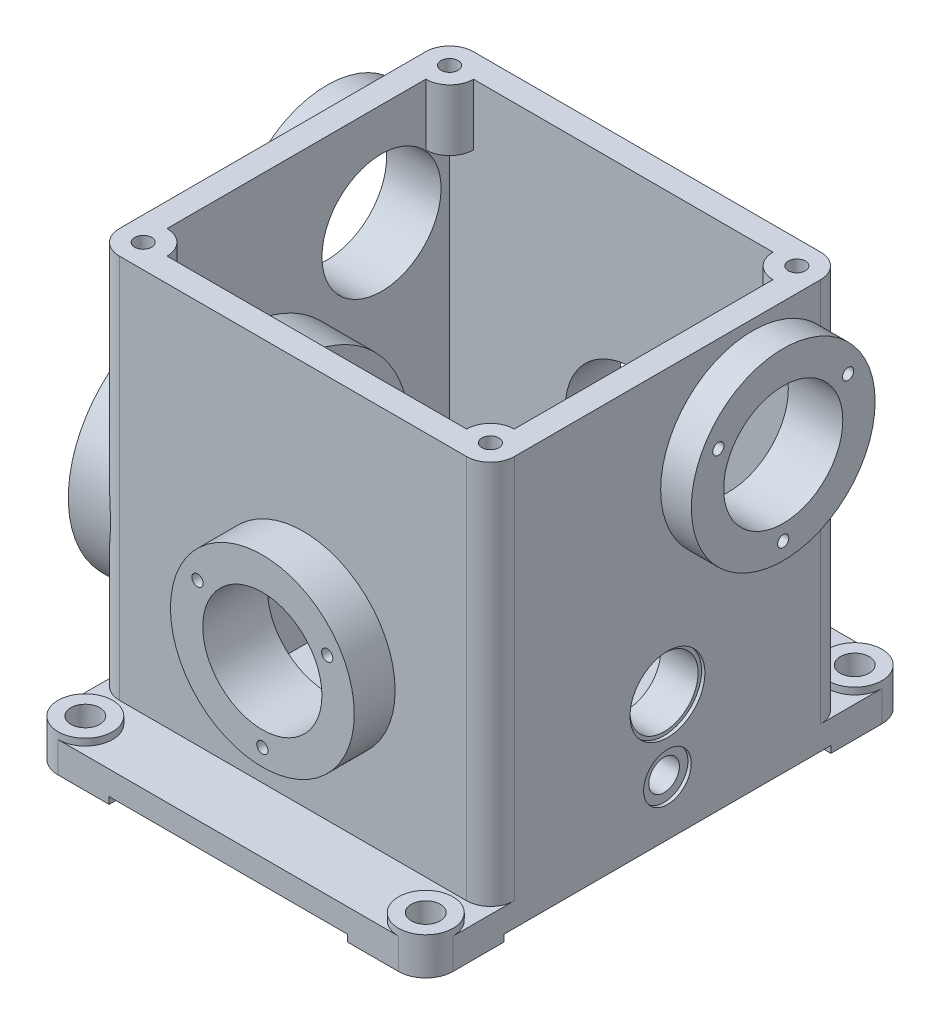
ISO-10303-21;
HEADER;
FILE_DESCRIPTION(('STEP AP214'),'2;1');
FILE_NAME('part.step','',(''),(''),'','','');
FILE_SCHEMA(('AUTOMOTIVE_DESIGN { 1 0 10303 214 1 1 1 1 }'));
ENDSEC;
DATA;
#1=APPLICATION_CONTEXT('core data for automotive mechanical design processes');
#2=APPLICATION_PROTOCOL_DEFINITION('international standard','automotive_design',2000,#1);
#3=PRODUCT_CONTEXT('',#1,'mechanical');
#4=PRODUCT('Part','Part','',(#3));
#5=PRODUCT_RELATED_PRODUCT_CATEGORY('part','',(#4));
#6=PRODUCT_DEFINITION_FORMATION('','',#4);
#7=PRODUCT_DEFINITION_CONTEXT('part definition',#1,'design');
#8=PRODUCT_DEFINITION('design','',#6,#7);
#9=PRODUCT_DEFINITION_SHAPE('','',#8);
#10=(LENGTH_UNIT() NAMED_UNIT(*) SI_UNIT(.MILLI.,.METRE.));
#11=(NAMED_UNIT(*) PLANE_ANGLE_UNIT() SI_UNIT($,.RADIAN.));
#12=(NAMED_UNIT(*) SI_UNIT($,.STERADIAN.) SOLID_ANGLE_UNIT());
#13=UNCERTAINTY_MEASURE_WITH_UNIT(LENGTH_MEASURE(1.E-05),#10,'distance_accuracy_value','');
#14=(GEOMETRIC_REPRESENTATION_CONTEXT(3) GLOBAL_UNCERTAINTY_ASSIGNED_CONTEXT((#13)) GLOBAL_UNIT_ASSIGNED_CONTEXT((#10,
#11,#12)) REPRESENTATION_CONTEXT('',''));
#15=CARTESIAN_POINT('',(0.,0.,0.));
#16=DIRECTION('',(0.,0.,1.));
#17=DIRECTION('',(1.,0.,0.));
#18=AXIS2_PLACEMENT_3D('',#15,#16,#17);
#19=CARTESIAN_POINT('',(-50.,9.,-63.));
#20=DIRECTION('',(0.,1.,0.));
#21=DIRECTION('',(0.,0.,1.));
#22=AXIS2_PLACEMENT_3D('',#19,#20,#21);
#23=PLANE('',#22);
#24=DIRECTION('',(0.,0.,-1.));
#25=VECTOR('',#24,1.);
#26=CARTESIAN_POINT('',(58.,9.,63.));
#27=LINE('',#26,#25);
#28=CARTESIAN_POINT('',(58.,9.,-45.));
#29=VERTEX_POINT('',#28);
#30=CARTESIAN_POINT('',(58.,9.,-63.));
#31=VERTEX_POINT('',#30);
#32=EDGE_CURVE('E499',#29,#31,#27,.T.);
#33=ORIENTED_EDGE('',*,*,#32,.T.);
#34=CARTESIAN_POINT('',(50.,9.,-63.));
#35=DIRECTION('',(0.,1.,0.));
#36=DIRECTION('',(0.,0.,1.));
#37=AXIS2_PLACEMENT_3D('',#34,#35,#36);
#38=CIRCLE('',#37,7.99999999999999);
#39=CARTESIAN_POINT('',(50.,9.,-71.));
#40=VERTEX_POINT('',#39);
#41=EDGE_CURVE('E492',#40,#31,#38,.T.);
#42=ORIENTED_EDGE('',*,*,#41,.F.);
#43=DIRECTION('',(-1.,0.,0.));
#44=VECTOR('',#43,1.);
#45=CARTESIAN_POINT('',(-50.,9.,-71.));
#46=LINE('',#45,#44);
#47=CARTESIAN_POINT('',(-50.,9.,-71.));
#48=VERTEX_POINT('',#47);
#49=EDGE_CURVE('E473',#40,#48,#46,.T.);
#50=ORIENTED_EDGE('',*,*,#49,.T.);
#51=CARTESIAN_POINT('',(-50.,9.,-63.));
#52=DIRECTION('',(0.,1.,0.));
#53=DIRECTION('',(0.,0.,1.));
#54=AXIS2_PLACEMENT_3D('',#51,#52,#53);
#55=CIRCLE('',#54,8.);
#56=CARTESIAN_POINT('',(-58.,9.,-63.));
#57=VERTEX_POINT('',#56);
#58=EDGE_CURVE('E505',#57,#48,#55,.T.);
#59=ORIENTED_EDGE('',*,*,#58,.F.);
#60=DIRECTION('',(0.,0.,1.));
#61=VECTOR('',#60,1.);
#62=CARTESIAN_POINT('',(-58.,9.,-63.));
#63=LINE('',#62,#61);
#64=CARTESIAN_POINT('',(-58.,9.,-45.));
#65=VERTEX_POINT('',#64);
#66=EDGE_CURVE('E1015',#57,#65,#63,.T.);
#67=ORIENTED_EDGE('',*,*,#66,.T.);
#68=CARTESIAN_POINT('',(-51.,9.,-45.));
#69=DIRECTION('',(0.,1.,0.));
#70=DIRECTION('',(0.,0.,1.));
#71=AXIS2_PLACEMENT_3D('',#68,#69,#70);
#72=CIRCLE('',#71,7.00000000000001);
#73=CARTESIAN_POINT('',(-51.,9.,-52.));
#74=VERTEX_POINT('',#73);
#75=EDGE_CURVE('E982',#74,#65,#72,.T.);
#76=ORIENTED_EDGE('',*,*,#75,.F.);
#77=DIRECTION('',(-1.,0.,0.));
#78=VECTOR('',#77,1.);
#79=CARTESIAN_POINT('',(-51.,9.,-52.));
#80=LINE('',#79,#78);
#81=CARTESIAN_POINT('',(51.,9.,-52.));
#82=VERTEX_POINT('',#81);
#83=EDGE_CURVE('E988',#82,#74,#80,.T.);
#84=ORIENTED_EDGE('',*,*,#83,.F.);
#85=CARTESIAN_POINT('',(51.,9.,-45.));
#86=DIRECTION('',(0.,1.,0.));
#87=DIRECTION('',(0.,0.,-1.));
#88=AXIS2_PLACEMENT_3D('',#85,#86,#87);
#89=CIRCLE('',#88,7.);
#90=EDGE_CURVE('E1184',#29,#82,#89,.T.);
#91=ORIENTED_EDGE('',*,*,#90,.F.);
#92=EDGE_LOOP('',(#33,#42,#50,#59,#67,#76,#84,#91));
#93=FACE_BOUND('',#92,.T.);
#94=ADVANCED_FACE('F37',(#93),#23,.T.);
#95=CARTESIAN_POINT('',(-58.,9.,45.));
#96=VERTEX_POINT('',#95);
#97=CARTESIAN_POINT('',(-58.,9.,63.));
#98=VERTEX_POINT('',#97);
#99=EDGE_CURVE('E960',#96,#98,#63,.T.);
#100=ORIENTED_EDGE('',*,*,#99,.T.);
#101=CARTESIAN_POINT('',(-50.,9.,63.));
#102=DIRECTION('',(0.,1.,0.));
#103=DIRECTION('',(0.,0.,1.));
#104=AXIS2_PLACEMENT_3D('',#101,#102,#103);
#105=CIRCLE('',#104,7.99999999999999);
#106=CARTESIAN_POINT('',(-50.,9.,71.));
#107=VERTEX_POINT('',#106);
#108=EDGE_CURVE('E515',#107,#98,#105,.T.);
#109=ORIENTED_EDGE('',*,*,#108,.F.);
#110=DIRECTION('',(1.,0.,0.));
#111=VECTOR('',#110,1.);
#112=CARTESIAN_POINT('',(-50.,9.,71.));
#113=LINE('',#112,#111);
#114=CARTESIAN_POINT('',(50.,9.,71.));
#115=VERTEX_POINT('',#114);
#116=EDGE_CURVE('E1009',#107,#115,#113,.T.);
#117=ORIENTED_EDGE('',*,*,#116,.T.);
#118=CARTESIAN_POINT('',(50.,9.,63.));
#119=DIRECTION('',(0.,1.,0.));
#120=DIRECTION('',(0.,0.,1.));
#121=AXIS2_PLACEMENT_3D('',#118,#119,#120);
#122=CIRCLE('',#121,8.);
#123=CARTESIAN_POINT('',(58.,9.,63.));
#124=VERTEX_POINT('',#123);
#125=EDGE_CURVE('E11',#115,#124,#122,.F.);
#126=ORIENTED_EDGE('',*,*,#125,.T.);
#127=CARTESIAN_POINT('',(58.,9.,45.));
#128=VERTEX_POINT('',#127);
#129=EDGE_CURVE('E485',#124,#128,#27,.T.);
#130=ORIENTED_EDGE('',*,*,#129,.T.);
#131=CARTESIAN_POINT('',(51.,9.,45.));
#132=DIRECTION('',(0.,1.,0.));
#133=DIRECTION('',(0.,0.,1.));
#134=AXIS2_PLACEMENT_3D('',#131,#132,#133);
#135=CIRCLE('',#134,7.);
#136=CARTESIAN_POINT('',(51.,9.,52.));
#137=VERTEX_POINT('',#136);
#138=EDGE_CURVE('E1179',#137,#128,#135,.T.);
#139=ORIENTED_EDGE('',*,*,#138,.F.);
#140=DIRECTION('',(1.,0.,0.));
#141=VECTOR('',#140,1.);
#142=CARTESIAN_POINT('',(-51.,9.,52.));
#143=LINE('',#142,#141);
#144=CARTESIAN_POINT('',(-51.,9.,52.));
#145=VERTEX_POINT('',#144);
#146=EDGE_CURVE('E1177',#145,#137,#143,.T.);
#147=ORIENTED_EDGE('',*,*,#146,.F.);
#148=CARTESIAN_POINT('',(-51.,9.,45.));
#149=DIRECTION('',(0.,1.,0.));
#150=DIRECTION('',(0.,0.,1.));
#151=AXIS2_PLACEMENT_3D('',#148,#149,#150);
#152=CIRCLE('',#151,6.99999999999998);
#153=EDGE_CURVE('E1156',#96,#145,#152,.T.);
#154=ORIENTED_EDGE('',*,*,#153,.F.);
#155=EDGE_LOOP('',(#100,#109,#117,#126,#130,#139,#147,#154));
#156=FACE_BOUND('',#155,.T.);
#157=ADVANCED_FACE('F886',(#156),#23,.T.);
#158=CARTESIAN_POINT('',(-51.,12.,45.));
#159=DIRECTION('',(0.,1.,0.));
#160=DIRECTION('',(0.,0.,1.));
#161=AXIS2_PLACEMENT_3D('',#158,#159,#160);
#162=PLANE('',#161);
#163=DIRECTION('',(0.,0.,1.));
#164=VECTOR('',#163,1.);
#165=CARTESIAN_POINT('',(46.,12.,45.));
#166=LINE('',#165,#164);
#167=CARTESIAN_POINT('',(46.,12.,-15.));
#168=VERTEX_POINT('',#167);
#169=CARTESIAN_POINT('',(46.,12.,15.));
#170=VERTEX_POINT('',#169);
#171=EDGE_CURVE('E45',#168,#170,#166,.T.);
#172=ORIENTED_EDGE('',*,*,#171,.F.);
#173=DIRECTION('',(1.,0.,0.));
#174=VECTOR('',#173,1.);
#175=CARTESIAN_POINT('',(-51.,12.,-15.));
#176=LINE('',#175,#174);
#177=CARTESIAN_POINT('',(51.,12.,-15.));
#178=VERTEX_POINT('',#177);
#179=EDGE_CURVE('E660',#168,#178,#176,.T.);
#180=ORIENTED_EDGE('',*,*,#179,.T.);
#181=DIRECTION('',(0.,0.,-1.));
#182=VECTOR('',#181,1.);
#183=CARTESIAN_POINT('',(51.,12.,45.));
#184=LINE('',#183,#182);
#185=CARTESIAN_POINT('',(51.,12.,-45.));
#186=VERTEX_POINT('',#185);
#187=EDGE_CURVE('E1139',#178,#186,#184,.T.);
#188=ORIENTED_EDGE('',*,*,#187,.T.);
#189=DIRECTION('',(-1.,0.,0.));
#190=VECTOR('',#189,1.);
#191=CARTESIAN_POINT('',(-51.,12.,-45.));
#192=LINE('',#191,#190);
#193=CARTESIAN_POINT('',(-51.,12.,-45.));
#194=VERTEX_POINT('',#193);
#195=EDGE_CURVE('E1143',#186,#194,#192,.T.);
#196=ORIENTED_EDGE('',*,*,#195,.T.);
#197=DIRECTION('',(0.,0.,1.));
#198=VECTOR('',#197,1.);
#199=CARTESIAN_POINT('',(-51.,12.,-45.));
#200=LINE('',#199,#198);
#201=CARTESIAN_POINT('',(-51.,12.,-17.));
#202=VERTEX_POINT('',#201);
#203=EDGE_CURVE('E1133',#194,#202,#200,.T.);
#204=ORIENTED_EDGE('',*,*,#203,.T.);
#205=DIRECTION('',(1.,0.,0.));
#206=VECTOR('',#205,1.);
#207=CARTESIAN_POINT('',(-51.,12.,-17.));
#208=LINE('',#207,#206);
#209=CARTESIAN_POINT('',(-35.,12.,-17.));
#210=VERTEX_POINT('',#209);
#211=EDGE_CURVE('E1198',#202,#210,#208,.T.);
#212=ORIENTED_EDGE('',*,*,#211,.T.);
#213=DIRECTION('',(0.,0.,1.));
#214=VECTOR('',#213,1.);
#215=CARTESIAN_POINT('',(-35.,12.,45.));
#216=LINE('',#215,#214);
#217=CARTESIAN_POINT('',(-35.,12.,45.));
#218=VERTEX_POINT('',#217);
#219=EDGE_CURVE('E977',#210,#218,#216,.T.);
#220=ORIENTED_EDGE('',*,*,#219,.T.);
#221=DIRECTION('',(1.,0.,0.));
#222=VECTOR('',#221,1.);
#223=CARTESIAN_POINT('',(-51.,12.,45.));
#224=LINE('',#223,#222);
#225=CARTESIAN_POINT('',(51.,12.,45.));
#226=VERTEX_POINT('',#225);
#227=EDGE_CURVE('E1136',#218,#226,#224,.T.);
#228=ORIENTED_EDGE('',*,*,#227,.T.);
#229=CARTESIAN_POINT('',(51.,12.,15.));
#230=VERTEX_POINT('',#229);
#231=EDGE_CURVE('E1140',#226,#230,#184,.T.);
#232=ORIENTED_EDGE('',*,*,#231,.T.);
#233=DIRECTION('',(-1.,0.,0.));
#234=VECTOR('',#233,1.);
#235=CARTESIAN_POINT('',(-51.,12.,15.));
#236=LINE('',#235,#234);
#237=EDGE_CURVE('E658',#230,#170,#236,.T.);
#238=ORIENTED_EDGE('',*,*,#237,.T.);
#239=EDGE_LOOP('',(#172,#180,#188,#196,#204,#212,#220,#228,#232,#238));
#240=FACE_BOUND('',#239,.T.);
#241=ADVANCED_FACE('F882',(#240),#162,.T.);
#242=CARTESIAN_POINT('',(51.,12.,45.));
#243=DIRECTION('',(1.,0.,0.));
#244=DIRECTION('',(0.,0.,-1.));
#245=AXIS2_PLACEMENT_3D('',#242,#243,#244);
#246=PLANE('',#245);
#247=CARTESIAN_POINT('',(51.,92.,-25.));
#248=DIRECTION('',(1.,0.,0.));
#249=DIRECTION('',(0.,0.,-1.));
#250=AXIS2_PLACEMENT_3D('',#247,#248,#249);
#251=CIRCLE('',#250,17.5);
#252=CARTESIAN_POINT('',(51.,92.,-42.5));
#253=VERTEX_POINT('',#252);
#254=EDGE_CURVE('E1468',#253,#253,#251,.F.);
#255=ORIENTED_EDGE('',*,*,#254,.F.);
#256=EDGE_LOOP('',(#255));
#257=FACE_BOUND('',#256,.T.);
#258=DIRECTION('',(0.,0.,1.));
#259=VECTOR('',#258,1.);
#260=CARTESIAN_POINT('',(51.,104.,45.));
#261=LINE('',#260,#259);
#262=CARTESIAN_POINT('',(51.,104.,38.));
#263=VERTEX_POINT('',#262);
#264=CARTESIAN_POINT('',(51.,104.,45.));
#265=VERTEX_POINT('',#264);
#266=EDGE_CURVE('E578',#263,#265,#261,.T.);
#267=ORIENTED_EDGE('',*,*,#266,.F.);
#268=DIRECTION('',(0.,1.,0.));
#269=VECTOR('',#268,1.);
#270=CARTESIAN_POINT('',(51.,104.,38.));
#271=LINE('',#270,#269);
#272=CARTESIAN_POINT('',(51.,122.,38.));
#273=VERTEX_POINT('',#272);
#274=EDGE_CURVE('E573',#263,#273,#271,.T.);
#275=ORIENTED_EDGE('',*,*,#274,.T.);
#276=DIRECTION('',(0.,0.,-1.));
#277=VECTOR('',#276,1.);
#278=CARTESIAN_POINT('',(51.,122.,45.));
#279=LINE('',#278,#277);
#280=CARTESIAN_POINT('',(51.,122.,-38.));
#281=VERTEX_POINT('',#280);
#282=EDGE_CURVE('E1150',#273,#281,#279,.T.);
#283=ORIENTED_EDGE('',*,*,#282,.T.);
#284=DIRECTION('',(0.,1.,0.));
#285=VECTOR('',#284,1.);
#286=CARTESIAN_POINT('',(51.,104.,-38.));
#287=LINE('',#286,#285);
#288=CARTESIAN_POINT('',(51.,104.,-38.));
#289=VERTEX_POINT('',#288);
#290=EDGE_CURVE('E596',#281,#289,#287,.F.);
#291=ORIENTED_EDGE('',*,*,#290,.T.);
#292=DIRECTION('',(0.,0.,1.));
#293=VECTOR('',#292,1.);
#294=CARTESIAN_POINT('',(51.,104.,45.));
#295=LINE('',#294,#293);
#296=CARTESIAN_POINT('',(51.,104.,-45.));
#297=VERTEX_POINT('',#296);
#298=EDGE_CURVE('E590',#297,#289,#295,.T.);
#299=ORIENTED_EDGE('',*,*,#298,.F.);
#300=DIRECTION('',(0.,1.,0.));
#301=VECTOR('',#300,1.);
#302=CARTESIAN_POINT('',(51.,12.,-45.));
#303=LINE('',#302,#301);
#304=EDGE_CURVE('E1157',#186,#297,#303,.T.);
#305=ORIENTED_EDGE('',*,*,#304,.F.);
#306=ORIENTED_EDGE('',*,*,#187,.F.);
#307=DIRECTION('',(0.,-1.,0.));
#308=VECTOR('',#307,1.);
#309=CARTESIAN_POINT('',(51.,39.,-15.));
#310=LINE('',#309,#308);
#311=CARTESIAN_POINT('',(51.,39.,-15.));
#312=VERTEX_POINT('',#311);
#313=EDGE_CURVE('E643',#312,#178,#310,.T.);
#314=ORIENTED_EDGE('',*,*,#313,.F.);
#315=CARTESIAN_POINT('',(51.,39.,0.));
#316=DIRECTION('',(-1.,0.,0.));
#317=DIRECTION('',(0.,0.,1.));
#318=AXIS2_PLACEMENT_3D('',#315,#316,#317);
#319=CIRCLE('',#318,15.);
#320=CARTESIAN_POINT('',(51.,39.,15.));
#321=VERTEX_POINT('',#320);
#322=EDGE_CURVE('E636',#321,#312,#319,.T.);
#323=ORIENTED_EDGE('',*,*,#322,.F.);
#324=DIRECTION('',(0.,1.,0.));
#325=VECTOR('',#324,1.);
#326=CARTESIAN_POINT('',(51.,12.,15.));
#327=LINE('',#326,#325);
#328=EDGE_CURVE('E1201',#230,#321,#327,.T.);
#329=ORIENTED_EDGE('',*,*,#328,.F.);
#330=ORIENTED_EDGE('',*,*,#231,.F.);
#331=DIRECTION('',(0.,1.,0.));
#332=VECTOR('',#331,1.);
#333=CARTESIAN_POINT('',(51.,12.,45.));
#334=LINE('',#333,#332);
#335=EDGE_CURVE('E1160',#226,#265,#334,.T.);
#336=ORIENTED_EDGE('',*,*,#335,.T.);
#337=EDGE_LOOP('',(#267,#275,#283,#291,#299,#305,#306,#314,#323,#329,#330,#336));
#338=FACE_BOUND('',#337,.T.);
#339=ADVANCED_FACE('F885',(#257,#338),#246,.F.);
#340=CARTESIAN_POINT('',(-51.,12.,-45.));
#341=DIRECTION('',(-1.,0.,0.));
#342=DIRECTION('',(0.,0.,1.));
#343=AXIS2_PLACEMENT_3D('',#340,#341,#342);
#344=PLANE('',#343);
#345=CARTESIAN_POINT('',(-51.,92.,-25.));
#346=DIRECTION('',(-1.,0.,0.));
#347=DIRECTION('',(0.,0.,1.));
#348=AXIS2_PLACEMENT_3D('',#345,#346,#347);
#349=CIRCLE('',#348,17.5);
#350=CARTESIAN_POINT('',(-51.,92.,-7.49999999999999));
#351=VERTEX_POINT('',#350);
#352=EDGE_CURVE('E707',#351,#351,#349,.F.);
#353=ORIENTED_EDGE('',*,*,#352,.F.);
#354=EDGE_LOOP('',(#353));
#355=FACE_BOUND('',#354,.T.);
#356=DIRECTION('',(0.,0.,1.));
#357=VECTOR('',#356,1.);
#358=CARTESIAN_POINT('',(-51.,122.,-45.));
#359=LINE('',#358,#357);
#360=CARTESIAN_POINT('',(-51.,122.,-38.));
#361=VERTEX_POINT('',#360);
#362=CARTESIAN_POINT('',(-51.,122.,38.));
#363=VERTEX_POINT('',#362);
#364=EDGE_CURVE('E1098',#361,#363,#359,.T.);
#365=ORIENTED_EDGE('',*,*,#364,.T.);
#366=DIRECTION('',(0.,1.,0.));
#367=VECTOR('',#366,1.);
#368=CARTESIAN_POINT('',(-51.,104.,38.));
#369=LINE('',#368,#367);
#370=CARTESIAN_POINT('',(-51.,104.,38.));
#371=VERTEX_POINT('',#370);
#372=EDGE_CURVE('E52',#363,#371,#369,.F.);
#373=ORIENTED_EDGE('',*,*,#372,.T.);
#374=DIRECTION('',(0.,0.,-1.));
#375=VECTOR('',#374,1.);
#376=CARTESIAN_POINT('',(-51.,104.,-45.));
#377=LINE('',#376,#375);
#378=CARTESIAN_POINT('',(-51.,104.,45.));
#379=VERTEX_POINT('',#378);
#380=EDGE_CURVE('E563',#379,#371,#377,.T.);
#381=ORIENTED_EDGE('',*,*,#380,.F.);
#382=DIRECTION('',(0.,1.,0.));
#383=VECTOR('',#382,1.);
#384=CARTESIAN_POINT('',(-51.,12.,45.));
#385=LINE('',#384,#383);
#386=CARTESIAN_POINT('',(-51.,86.,45.));
#387=VERTEX_POINT('',#386);
#388=EDGE_CURVE('E1146',#387,#379,#385,.T.);
#389=ORIENTED_EDGE('',*,*,#388,.F.);
#390=DIRECTION('',(0.,0.,1.));
#391=VECTOR('',#390,1.);
#392=CARTESIAN_POINT('',(-51.,86.,45.));
#393=LINE('',#392,#391);
#394=CARTESIAN_POINT('',(-51.,86.,17.));
#395=VERTEX_POINT('',#394);
#396=EDGE_CURVE('E714',#395,#387,#393,.T.);
#397=ORIENTED_EDGE('',*,*,#396,.F.);
#398=CARTESIAN_POINT('',(-51.,52.,17.));
#399=DIRECTION('',(1.,0.,0.));
#400=DIRECTION('',(0.,0.,1.));
#401=AXIS2_PLACEMENT_3D('',#398,#399,#400);
#402=CIRCLE('',#401,34.);
#403=CARTESIAN_POINT('',(-51.,52.,-17.));
#404=VERTEX_POINT('',#403);
#405=EDGE_CURVE('E722',#404,#395,#402,.T.);
#406=ORIENTED_EDGE('',*,*,#405,.F.);
#407=DIRECTION('',(0.,1.,0.));
#408=VECTOR('',#407,1.);
#409=CARTESIAN_POINT('',(-51.,52.,-17.));
#410=LINE('',#409,#408);
#411=EDGE_CURVE('E710',#202,#404,#410,.T.);
#412=ORIENTED_EDGE('',*,*,#411,.F.);
#413=ORIENTED_EDGE('',*,*,#203,.F.);
#414=DIRECTION('',(0.,1.,0.));
#415=VECTOR('',#414,1.);
#416=CARTESIAN_POINT('',(-51.,12.,-45.));
#417=LINE('',#416,#415);
#418=CARTESIAN_POINT('',(-51.,104.,-45.));
#419=VERTEX_POINT('',#418);
#420=EDGE_CURVE('E1153',#194,#419,#417,.T.);
#421=ORIENTED_EDGE('',*,*,#420,.T.);
#422=DIRECTION('',(0.,0.,-1.));
#423=VECTOR('',#422,1.);
#424=CARTESIAN_POINT('',(-51.,104.,-45.));
#425=LINE('',#424,#423);
#426=CARTESIAN_POINT('',(-51.,104.,-38.));
#427=VERTEX_POINT('',#426);
#428=EDGE_CURVE('E607',#427,#419,#425,.T.);
#429=ORIENTED_EDGE('',*,*,#428,.F.);
#430=DIRECTION('',(0.,1.,0.));
#431=VECTOR('',#430,1.);
#432=CARTESIAN_POINT('',(-51.,104.,-38.));
#433=LINE('',#432,#431);
#434=EDGE_CURVE('E612',#427,#361,#433,.T.);
#435=ORIENTED_EDGE('',*,*,#434,.T.);
#436=EDGE_LOOP('',(#365,#373,#381,#389,#397,#406,#412,#413,#421,#429,#435));
#437=FACE_BOUND('',#436,.T.);
#438=ADVANCED_FACE('F893',(#355,#437),#344,.F.);
#439=CARTESIAN_POINT('',(-51.,12.,45.));
#440=DIRECTION('',(0.,0.,1.));
#441=DIRECTION('',(1.,0.,0.));
#442=AXIS2_PLACEMENT_3D('',#439,#440,#441);
#443=PLANE('',#442);
#444=CARTESIAN_POINT('',(3.,52.,45.));
#445=DIRECTION('',(0.,0.,1.));
#446=DIRECTION('',(1.,0.,0.));
#447=AXIS2_PLACEMENT_3D('',#444,#445,#446);
#448=CIRCLE('',#447,17.5);
#449=CARTESIAN_POINT('',(20.5,52.,45.));
#450=VERTEX_POINT('',#449);
#451=EDGE_CURVE('E1618',#450,#450,#448,.F.);
#452=ORIENTED_EDGE('',*,*,#451,.F.);
#453=EDGE_LOOP('',(#452));
#454=FACE_BOUND('',#453,.T.);
#455=DIRECTION('',(-1.,0.,0.));
#456=VECTOR('',#455,1.);
#457=CARTESIAN_POINT('',(-51.,104.,45.));
#458=LINE('',#457,#456);
#459=CARTESIAN_POINT('',(-44.,104.,45.));
#460=VERTEX_POINT('',#459);
#461=EDGE_CURVE('E60',#460,#379,#458,.T.);
#462=ORIENTED_EDGE('',*,*,#461,.F.);
#463=DIRECTION('',(0.,1.,0.));
#464=VECTOR('',#463,1.);
#465=CARTESIAN_POINT('',(-44.,104.,45.));
#466=LINE('',#465,#464);
#467=CARTESIAN_POINT('',(-44.,122.,45.));
#468=VERTEX_POINT('',#467);
#469=EDGE_CURVE('E557',#460,#468,#466,.T.);
#470=ORIENTED_EDGE('',*,*,#469,.T.);
#471=DIRECTION('',(1.,0.,0.));
#472=VECTOR('',#471,1.);
#473=CARTESIAN_POINT('',(-51.,122.,45.));
#474=LINE('',#473,#472);
#475=CARTESIAN_POINT('',(44.,122.,45.));
#476=VERTEX_POINT('',#475);
#477=EDGE_CURVE('E1148',#468,#476,#474,.T.);
#478=ORIENTED_EDGE('',*,*,#477,.T.);
#479=DIRECTION('',(0.,1.,0.));
#480=VECTOR('',#479,1.);
#481=CARTESIAN_POINT('',(44.,104.,45.));
#482=LINE('',#481,#480);
#483=CARTESIAN_POINT('',(44.,104.,45.));
#484=VERTEX_POINT('',#483);
#485=EDGE_CURVE('E569',#476,#484,#482,.F.);
#486=ORIENTED_EDGE('',*,*,#485,.T.);
#487=DIRECTION('',(-1.,0.,0.));
#488=VECTOR('',#487,1.);
#489=CARTESIAN_POINT('',(-51.,104.,45.));
#490=LINE('',#489,#488);
#491=EDGE_CURVE('E575',#265,#484,#490,.T.);
#492=ORIENTED_EDGE('',*,*,#491,.F.);
#493=ORIENTED_EDGE('',*,*,#335,.F.);
#494=ORIENTED_EDGE('',*,*,#227,.F.);
#495=DIRECTION('',(0.,-1.,0.));
#496=VECTOR('',#495,1.);
#497=CARTESIAN_POINT('',(-35.,9.,45.));
#498=LINE('',#497,#496);
#499=CARTESIAN_POINT('',(-35.,86.,45.));
#500=VERTEX_POINT('',#499);
#501=EDGE_CURVE('E711',#500,#218,#498,.T.);
#502=ORIENTED_EDGE('',*,*,#501,.F.);
#503=DIRECTION('',(-1.,0.,0.));
#504=VECTOR('',#503,1.);
#505=CARTESIAN_POINT('',(-35.,86.,45.));
#506=LINE('',#505,#504);
#507=EDGE_CURVE('E720',#500,#387,#506,.T.);
#508=ORIENTED_EDGE('',*,*,#507,.T.);
#509=ORIENTED_EDGE('',*,*,#388,.T.);
#510=EDGE_LOOP('',(#462,#470,#478,#486,#492,#493,#494,#502,#508,#509));
#511=FACE_BOUND('',#510,.T.);
#512=ADVANCED_FACE('F895',(#454,#511),#443,.F.);
#513=CARTESIAN_POINT('',(-58.,9.,-63.));
#514=DIRECTION('',(1.,0.,0.));
#515=DIRECTION('',(0.,0.,-1.));
#516=AXIS2_PLACEMENT_3D('',#513,#514,#515);
#517=PLANE('',#516);
#518=DIRECTION('',(0.,-1.,0.));
#519=VECTOR('',#518,1.);
#520=CARTESIAN_POINT('',(-58.,122.,45.));
#521=LINE('',#520,#519);
#522=CARTESIAN_POINT('',(-58.,32.7126984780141,45.));
#523=VERTEX_POINT('',#522);
#524=EDGE_CURVE('E956',#523,#96,#521,.T.);
#525=ORIENTED_EDGE('',*,*,#524,.F.);
#526=CARTESIAN_POINT('',(-58.,52.,17.));
#527=DIRECTION('',(1.,0.,0.));
#528=DIRECTION('',(0.,0.,-1.));
#529=AXIS2_PLACEMENT_3D('',#526,#527,#528);
#530=CIRCLE('',#529,34.);
#531=CARTESIAN_POINT('',(-58.,54.3556757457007,-16.9182958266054));
#532=VERTEX_POINT('',#531);
#533=EDGE_CURVE('E958',#523,#532,#530,.T.);
#534=ORIENTED_EDGE('',*,*,#533,.T.);
#535=CARTESIAN_POINT('',(-58.,55.0485215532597,-26.8942651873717));
#536=DIRECTION('',(1.,0.,0.));
#537=DIRECTION('',(0.,0.,-1.));
#538=AXIS2_PLACEMENT_3D('',#535,#536,#537);
#539=CIRCLE('',#538,10.);
#540=CARTESIAN_POINT('',(-58.,65.0354076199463,-26.3823016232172));
#541=VERTEX_POINT('',#540);
#542=EDGE_CURVE('E1400',#532,#541,#539,.F.);
#543=ORIENTED_EDGE('',*,*,#542,.T.);
#544=CARTESIAN_POINT('',(-58.,92.,-25.));
#545=DIRECTION('',(1.,0.,0.));
#546=DIRECTION('',(0.,0.,-1.));
#547=AXIS2_PLACEMENT_3D('',#544,#545,#546);
#548=CIRCLE('',#547,27.);
#549=CARTESIAN_POINT('',(-58.,73.8616428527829,-45.));
#550=VERTEX_POINT('',#549);
#551=EDGE_CURVE('E1590',#541,#550,#548,.T.);
#552=ORIENTED_EDGE('',*,*,#551,.T.);
#553=DIRECTION('',(0.,-1.,0.));
#554=VECTOR('',#553,1.);
#555=CARTESIAN_POINT('',(-58.,122.,-45.));
#556=LINE('',#555,#554);
#557=EDGE_CURVE('E968',#550,#65,#556,.T.);
#558=ORIENTED_EDGE('',*,*,#557,.T.);
#559=ORIENTED_EDGE('',*,*,#66,.F.);
#560=DIRECTION('',(0.,-1.,0.));
#561=VECTOR('',#560,1.);
#562=CARTESIAN_POINT('',(-58.,9.,-63.));
#563=LINE('',#562,#561);
#564=CARTESIAN_POINT('',(-58.,0.,-63.));
#565=VERTEX_POINT('',#564);
#566=EDGE_CURVE('E1018',#57,#565,#563,.T.);
#567=ORIENTED_EDGE('',*,*,#566,.T.);
#568=DIRECTION('',(0.,0.,1.));
#569=VECTOR('',#568,1.);
#570=CARTESIAN_POINT('',(-58.,0.,-63.));
#571=LINE('',#570,#569);
#572=CARTESIAN_POINT('',(-58.,0.,-48.));
#573=VERTEX_POINT('',#572);
#574=EDGE_CURVE('E1052',#565,#573,#571,.T.);
#575=ORIENTED_EDGE('',*,*,#574,.T.);
#576=DIRECTION('',(0.,-1.,0.));
#577=VECTOR('',#576,1.);
#578=CARTESIAN_POINT('',(-58.,2.,-48.));
#579=LINE('',#578,#577);
#580=CARTESIAN_POINT('',(-58.,2.,-48.));
#581=VERTEX_POINT('',#580);
#582=EDGE_CURVE('E1121',#581,#573,#579,.T.);
#583=ORIENTED_EDGE('',*,*,#582,.F.);
#584=DIRECTION('',(0.,0.,-1.));
#585=VECTOR('',#584,1.);
#586=CARTESIAN_POINT('',(-58.,2.,48.));
#587=LINE('',#586,#585);
#588=CARTESIAN_POINT('',(-58.,2.,48.));
#589=VERTEX_POINT('',#588);
#590=EDGE_CURVE('E1564',#589,#581,#587,.T.);
#591=ORIENTED_EDGE('',*,*,#590,.F.);
#592=DIRECTION('',(0.,-1.,0.));
#593=VECTOR('',#592,1.);
#594=CARTESIAN_POINT('',(-58.,2.,48.));
#595=LINE('',#594,#593);
#596=CARTESIAN_POINT('',(-58.,0.,48.));
#597=VERTEX_POINT('',#596);
#598=EDGE_CURVE('E1123',#589,#597,#595,.T.);
#599=ORIENTED_EDGE('',*,*,#598,.T.);
#600=CARTESIAN_POINT('',(-58.,0.,63.));
#601=VERTEX_POINT('',#600);
#602=EDGE_CURVE('E1055',#597,#601,#571,.T.);
#603=ORIENTED_EDGE('',*,*,#602,.T.);
#604=DIRECTION('',(0.,-1.,0.));
#605=VECTOR('',#604,1.);
#606=CARTESIAN_POINT('',(-58.,9.,63.));
#607=LINE('',#606,#605);
#608=EDGE_CURVE('E1022',#98,#601,#607,.T.);
#609=ORIENTED_EDGE('',*,*,#608,.F.);
#610=ORIENTED_EDGE('',*,*,#99,.F.);
#611=EDGE_LOOP('',(#525,#534,#543,#552,#558,#559,#567,#575,#583,#591,#599,#603,#609,#610));
#612=FACE_BOUND('',#611,.T.);
#613=ADVANCED_FACE('F897',(#612),#517,.F.);
#614=CARTESIAN_POINT('',(-51.,122.,-45.));
#615=DIRECTION('',(0.,-1.,0.));
#616=DIRECTION('',(0.,0.,-1.));
#617=AXIS2_PLACEMENT_3D('',#614,#615,#616);
#618=CYLINDRICAL_SURFACE('',#617,7.00000000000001);
#619=ORIENTED_EDGE('',*,*,#557,.F.);
#620=CARTESIAN_POINT('',(-58.,73.8616428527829,-45.));
#621=CARTESIAN_POINT('',(-57.9999915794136,74.0253344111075,-45.1484596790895));
#622=CARTESIAN_POINT('',(-57.9952782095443,74.1908140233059,-45.2948679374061));
#623=CARTESIAN_POINT('',(-57.9771516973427,74.5249927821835,-45.5833134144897));
#624=CARTESIAN_POINT('',(-57.9637411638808,74.6936909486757,-45.7253519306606));
#625=CARTESIAN_POINT('',(-57.9115947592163,75.2035340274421,-46.1440728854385));
#626=CARTESIAN_POINT('',(-57.8609382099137,75.5490970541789,-46.4139674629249));
#627=CARTESIAN_POINT('',(-57.7333085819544,76.2466381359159,-46.9321435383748));
#628=CARTESIAN_POINT('',(-57.6565581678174,76.5985388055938,-47.180586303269));
#629=CARTESIAN_POINT('',(-57.4806824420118,77.3100672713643,-47.6581024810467));
#630=CARTESIAN_POINT('',(-57.3815424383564,77.6697000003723,-47.8871630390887));
#631=CARTESIAN_POINT('',(-57.1053703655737,78.5923343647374,-48.4448805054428));
#632=CARTESIAN_POINT('',(-56.9152878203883,79.1596426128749,-48.7600119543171));
#633=CARTESIAN_POINT('',(-56.500520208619,80.3051091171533,-49.3442663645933));
#634=CARTESIAN_POINT('',(-56.2758234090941,80.8832709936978,-49.6133736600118));
#635=CARTESIAN_POINT('',(-55.7985986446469,82.0506349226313,-50.10804718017));
#636=CARTESIAN_POINT('',(-55.5459318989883,82.6398787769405,-50.3333794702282));
#637=CARTESIAN_POINT('',(-55.0202697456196,83.8242207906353,-50.740020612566));
#638=CARTESIAN_POINT('',(-54.7472773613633,84.4193180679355,-50.9213359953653));
#639=CARTESIAN_POINT('',(-54.196537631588,85.5918722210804,-51.235290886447));
#640=CARTESIAN_POINT('',(-53.919334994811,86.1691723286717,-51.3694761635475));
#641=CARTESIAN_POINT('',(-53.35501005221,87.326500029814,-51.5989965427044));
#642=CARTESIAN_POINT('',(-53.0678868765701,87.9065278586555,-51.6943282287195));
#643=CARTESIAN_POINT('',(-52.1984936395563,89.6461565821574,-51.9225620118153));
#644=CARTESIAN_POINT('',(-51.6063420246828,90.8091675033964,-51.9987246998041));
#645=CARTESIAN_POINT('',(-51.0099409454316,91.9804763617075,-51.9999947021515));
#646=CARTESIAN_POINT('',(-51.0049704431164,91.9902382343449,-51.9999999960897));
#647=CARTESIAN_POINT('',(-51.,92.,-52.));
#648=B_SPLINE_CURVE_WITH_KNOTS('',3,(#620,#621,#622,#623,#624,#625,#626,#627,#628,#629,#630,
#631,#632,#633,#634,#635,#636,#637,#638,#639,#640,#641,#642,#643,#644,#645,#646,#647),
.UNSPECIFIED.,.F.,.F.,(4,2,2,2,2,2,2,2,2,2,2,2,2,4),(0.,0.662803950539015,1.32540917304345,
2.64791882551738,3.95941524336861,5.27177477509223,7.29734339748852,9.32360012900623,
11.3604040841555,13.3969056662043,15.3584616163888,17.3201899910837,21.2304977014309,
21.263361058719),.UNSPECIFIED.);
#649=CARTESIAN_POINT('',(-51.,92.,-52.));
#650=VERTEX_POINT('',#649);
#651=EDGE_CURVE('E760',#550,#650,#648,.T.);
#652=ORIENTED_EDGE('',*,*,#651,.T.);
#653=DIRECTION('',(0.,-1.,0.));
#654=VECTOR('',#653,1.);
#655=CARTESIAN_POINT('',(-51.,122.,-52.));
#656=LINE('',#655,#654);
#657=EDGE_CURVE('E997',#650,#74,#656,.T.);
#658=ORIENTED_EDGE('',*,*,#657,.T.);
#659=ORIENTED_EDGE('',*,*,#75,.T.);
#660=EDGE_LOOP('',(#619,#652,#658,#659));
#661=FACE_BOUND('',#660,.T.);
#662=ADVANCED_FACE('F777',(#661),#618,.T.);
#663=CARTESIAN_POINT('',(-51.,122.,-52.));
#664=DIRECTION('',(0.,0.,1.));
#665=DIRECTION('',(1.,0.,0.));
#666=AXIS2_PLACEMENT_3D('',#663,#664,#665);
#667=PLANE('',#666);
#668=ORIENTED_EDGE('',*,*,#83,.T.);
#669=ORIENTED_EDGE('',*,*,#657,.F.);
#670=CARTESIAN_POINT('',(-51.,122.,-52.));
#671=VERTEX_POINT('',#670);
#672=EDGE_CURVE('E994',#671,#650,#656,.T.);
#673=ORIENTED_EDGE('',*,*,#672,.F.);
#674=DIRECTION('',(-1.,0.,0.));
#675=VECTOR('',#674,1.);
#676=CARTESIAN_POINT('',(-51.,122.,-52.));
#677=LINE('',#676,#675);
#678=CARTESIAN_POINT('',(51.,122.,-52.));
#679=VERTEX_POINT('',#678);
#680=EDGE_CURVE('E1174',#679,#671,#677,.T.);
#681=ORIENTED_EDGE('',*,*,#680,.F.);
#682=DIRECTION('',(0.,-1.,0.));
#683=VECTOR('',#682,1.);
#684=CARTESIAN_POINT('',(51.,122.,-52.));
#685=LINE('',#684,#683);
#686=CARTESIAN_POINT('',(51.,92.,-52.));
#687=VERTEX_POINT('',#686);
#688=EDGE_CURVE('E998',#679,#687,#685,.T.);
#689=ORIENTED_EDGE('',*,*,#688,.T.);
#690=EDGE_CURVE('E996',#687,#82,#685,.T.);
#691=ORIENTED_EDGE('',*,*,#690,.T.);
#692=EDGE_LOOP('',(#668,#669,#673,#681,#689,#691));
#693=FACE_BOUND('',#692,.T.);
#694=CARTESIAN_POINT('',(3.,52.,-52.));
#695=DIRECTION('',(0.,0.,1.));
#696=DIRECTION('',(1.,0.,0.));
#697=AXIS2_PLACEMENT_3D('',#694,#695,#696);
#698=CIRCLE('',#697,29.);
#699=CARTESIAN_POINT('',(32.,52.,-52.));
#700=VERTEX_POINT('',#699);
#701=EDGE_CURVE('E1193',#700,#700,#698,.F.);
#702=ORIENTED_EDGE('',*,*,#701,.F.);
#703=EDGE_LOOP('',(#702));
#704=FACE_BOUND('',#703,.T.);
#705=ADVANCED_FACE('F779',(#693,#704),#667,.F.);
#706=CARTESIAN_POINT('',(51.,122.,-45.));
#707=DIRECTION('',(0.,-1.,0.));
#708=DIRECTION('',(0.,0.,-1.));
#709=AXIS2_PLACEMENT_3D('',#706,#707,#708);
#710=CYLINDRICAL_SURFACE('',#709,7.);
#711=CARTESIAN_POINT('',(58.,110.138357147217,-45.));
#712=CARTESIAN_POINT('',(57.9999915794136,109.974665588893,-45.1484596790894));
#713=CARTESIAN_POINT('',(57.9952782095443,109.809185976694,-45.2948679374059));
#714=CARTESIAN_POINT('',(57.9771516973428,109.475007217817,-45.5833134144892));
#715=CARTESIAN_POINT('',(57.9637411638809,109.306309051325,-45.7253519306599));
#716=CARTESIAN_POINT('',(57.9115947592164,108.796465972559,-46.1440728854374));
#717=CARTESIAN_POINT('',(57.860938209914,108.450902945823,-46.4139674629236));
#718=CARTESIAN_POINT('',(57.7333085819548,107.753361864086,-46.9321435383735));
#719=CARTESIAN_POINT('',(57.6565581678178,107.401461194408,-47.180586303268));
#720=CARTESIAN_POINT('',(57.480682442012,106.689932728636,-47.6581024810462));
#721=CARTESIAN_POINT('',(57.3815424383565,106.330299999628,-47.8871630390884));
#722=CARTESIAN_POINT('',(57.1053703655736,105.407665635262,-48.444880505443));
#723=CARTESIAN_POINT('',(56.9152878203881,104.840357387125,-48.7600119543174));
#724=CARTESIAN_POINT('',(56.5005202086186,103.694890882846,-49.3442663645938));
#725=CARTESIAN_POINT('',(56.2758234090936,103.116729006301,-49.6133736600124));
#726=CARTESIAN_POINT('',(55.7985986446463,101.949365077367,-50.1080471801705));
#727=CARTESIAN_POINT('',(55.5459318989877,101.360121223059,-50.3333794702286));
#728=CARTESIAN_POINT('',(55.0202697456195,100.175779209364,-50.7400206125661));
#729=CARTESIAN_POINT('',(54.7472773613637,99.580681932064,-50.9213359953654));
#730=CARTESIAN_POINT('',(54.1965376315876,98.4081277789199,-51.235290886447));
#731=CARTESIAN_POINT('',(53.9193349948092,97.8308276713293,-51.3694761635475));
#732=CARTESIAN_POINT('',(53.3550100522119,96.6734999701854,-51.5989965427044));
#733=CARTESIAN_POINT('',(53.0678868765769,96.0934721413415,-51.6943282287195));
#734=CARTESIAN_POINT('',(52.1984936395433,94.3538434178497,-51.9225620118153));
#735=CARTESIAN_POINT('',(51.6063420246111,93.1908324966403,-51.9987246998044));
#736=CARTESIAN_POINT('',(51.0099409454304,92.0195236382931,-51.9999947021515));
#737=CARTESIAN_POINT('',(51.0049704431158,92.0097617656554,-51.9999999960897));
#738=CARTESIAN_POINT('',(51.,92.,-52.));
#739=B_SPLINE_CURVE_WITH_KNOTS('',3,(#711,#712,#713,#714,#715,#716,#717,#718,#719,#720,#721,
#722,#723,#724,#725,#726,#727,#728,#729,#730,#731,#732,#733,#734,#735,#736,#737,#738),
.UNSPECIFIED.,.F.,.F.,(4,2,2,2,2,2,2,2,2,2,2,2,2,4),(0.,0.66280395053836,1.32540917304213,
2.64791882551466,3.95941524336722,5.27177477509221,7.29734339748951,9.32360012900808,
11.3604040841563,13.3969056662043,15.3584616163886,17.3201899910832,21.2304977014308,
21.263361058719),.UNSPECIFIED.);
#740=CARTESIAN_POINT('',(58.,110.138357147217,-45.));
#741=VERTEX_POINT('',#740);
#742=EDGE_CURVE('E800',#741,#687,#739,.T.);
#743=ORIENTED_EDGE('',*,*,#742,.T.);
#744=ORIENTED_EDGE('',*,*,#688,.F.);
#745=CARTESIAN_POINT('',(51.,122.,-45.));
#746=DIRECTION('',(0.,1.,0.));
#747=DIRECTION('',(0.,0.,-1.));
#748=AXIS2_PLACEMENT_3D('',#745,#746,#747);
#749=CIRCLE('',#748,7.);
#750=CARTESIAN_POINT('',(58.,122.,-45.));
#751=VERTEX_POINT('',#750);
#752=EDGE_CURVE('E1172',#751,#679,#749,.T.);
#753=ORIENTED_EDGE('',*,*,#752,.F.);
#754=DIRECTION('',(0.,-1.,0.));
#755=VECTOR('',#754,1.);
#756=CARTESIAN_POINT('',(58.,122.,-45.));
#757=LINE('',#756,#755);
#758=EDGE_CURVE('E1188',#751,#741,#757,.T.);
#759=ORIENTED_EDGE('',*,*,#758,.T.);
#760=EDGE_LOOP('',(#743,#744,#753,#759));
#761=FACE_BOUND('',#760,.T.);
#762=ADVANCED_FACE('F783',(#761),#710,.T.);
#763=CARTESIAN_POINT('',(-51.,122.,52.));
#764=DIRECTION('',(0.,0.,-1.));
#765=DIRECTION('',(-1.,0.,0.));
#766=AXIS2_PLACEMENT_3D('',#763,#764,#765);
#767=PLANE('',#766);
#768=ORIENTED_EDGE('',*,*,#146,.T.);
#769=DIRECTION('',(0.,-1.,0.));
#770=VECTOR('',#769,1.);
#771=CARTESIAN_POINT('',(51.,122.,52.));
#772=LINE('',#771,#770);
#773=CARTESIAN_POINT('',(51.,122.,52.));
#774=VERTEX_POINT('',#773);
#775=EDGE_CURVE('E1001',#774,#137,#772,.T.);
#776=ORIENTED_EDGE('',*,*,#775,.F.);
#777=DIRECTION('',(1.,0.,0.));
#778=VECTOR('',#777,1.);
#779=CARTESIAN_POINT('',(-51.,122.,52.));
#780=LINE('',#779,#778);
#781=CARTESIAN_POINT('',(-51.,122.,52.));
#782=VERTEX_POINT('',#781);
#783=EDGE_CURVE('E1166',#782,#774,#780,.T.);
#784=ORIENTED_EDGE('',*,*,#783,.F.);
#785=DIRECTION('',(0.,-1.,0.));
#786=VECTOR('',#785,1.);
#787=CARTESIAN_POINT('',(-51.,122.,52.));
#788=LINE('',#787,#786);
#789=EDGE_CURVE('E1003',#782,#145,#788,.T.);
#790=ORIENTED_EDGE('',*,*,#789,.T.);
#791=EDGE_LOOP('',(#768,#776,#784,#790));
#792=FACE_BOUND('',#791,.T.);
#793=CARTESIAN_POINT('',(3.,52.,52.));
#794=DIRECTION('',(0.,0.,-1.));
#795=DIRECTION('',(-1.,0.,0.));
#796=AXIS2_PLACEMENT_3D('',#793,#794,#795);
#797=CIRCLE('',#796,27.);
#798=CARTESIAN_POINT('',(-24.,52.,52.));
#799=VERTEX_POINT('',#798);
#800=EDGE_CURVE('E1021',#799,#799,#797,.F.);
#801=ORIENTED_EDGE('',*,*,#800,.F.);
#802=EDGE_LOOP('',(#801));
#803=FACE_BOUND('',#802,.T.);
#804=ADVANCED_FACE('F1631',(#792,#803),#767,.F.);
#805=CARTESIAN_POINT('',(-50.,0.,-63.));
#806=DIRECTION('',(0.,1.,0.));
#807=DIRECTION('',(0.,0.,1.));
#808=AXIS2_PLACEMENT_3D('',#805,#806,#807);
#809=PLANE('',#808);
#810=CARTESIAN_POINT('',(50.,0.,63.));
#811=DIRECTION('',(0.,1.,0.));
#812=DIRECTION('',(0.,0.,1.));
#813=AXIS2_PLACEMENT_3D('',#810,#811,#812);
#814=CIRCLE('',#813,4.25000000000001);
#815=CARTESIAN_POINT('',(50.,0.,67.25));
#816=VERTEX_POINT('',#815);
#817=EDGE_CURVE('E2484',#816,#816,#814,.T.);
#818=ORIENTED_EDGE('',*,*,#817,.T.);
#819=EDGE_LOOP('',(#818));
#820=FACE_BOUND('',#819,.T.);
#821=DIRECTION('',(1.,0.,0.));
#822=VECTOR('',#821,1.);
#823=CARTESIAN_POINT('',(-50.,0.,71.));
#824=LINE('',#823,#822);
#825=CARTESIAN_POINT('',(35.,0.,71.));
#826=VERTEX_POINT('',#825);
#827=CARTESIAN_POINT('',(50.,0.,71.));
#828=VERTEX_POINT('',#827);
#829=EDGE_CURVE('E1049',#826,#828,#824,.T.);
#830=ORIENTED_EDGE('',*,*,#829,.F.);
#831=DIRECTION('',(0.,0.,1.));
#832=VECTOR('',#831,1.);
#833=CARTESIAN_POINT('',(35.,0.,71.));
#834=LINE('',#833,#832);
#835=CARTESIAN_POINT('',(35.,0.,51.));
#836=VERTEX_POINT('',#835);
#837=EDGE_CURVE('E1088',#836,#826,#834,.T.);
#838=ORIENTED_EDGE('',*,*,#837,.F.);
#839=CARTESIAN_POINT('',(38.,0.,51.));
#840=DIRECTION('',(0.,1.,0.));
#841=DIRECTION('',(0.,0.,1.));
#842=AXIS2_PLACEMENT_3D('',#839,#840,#841);
#843=CIRCLE('',#842,3.);
#844=CARTESIAN_POINT('',(38.,0.,48.));
#845=VERTEX_POINT('',#844);
#846=EDGE_CURVE('E1085',#845,#836,#843,.T.);
#847=ORIENTED_EDGE('',*,*,#846,.F.);
#848=DIRECTION('',(-1.,0.,0.));
#849=VECTOR('',#848,1.);
#850=CARTESIAN_POINT('',(38.,0.,48.));
#851=LINE('',#850,#849);
#852=CARTESIAN_POINT('',(58.,0.,48.));
#853=VERTEX_POINT('',#852);
#854=EDGE_CURVE('E1082',#853,#845,#851,.T.);
#855=ORIENTED_EDGE('',*,*,#854,.F.);
#856=DIRECTION('',(0.,0.,-1.));
#857=VECTOR('',#856,1.);
#858=CARTESIAN_POINT('',(58.,0.,63.));
#859=LINE('',#858,#857);
#860=CARTESIAN_POINT('',(58.,0.,63.));
#861=VERTEX_POINT('',#860);
#862=EDGE_CURVE('E1040',#861,#853,#859,.T.);
#863=ORIENTED_EDGE('',*,*,#862,.F.);
#864=CARTESIAN_POINT('',(50.,0.,63.));
#865=DIRECTION('',(0.,1.,0.));
#866=DIRECTION('',(0.,0.,1.));
#867=AXIS2_PLACEMENT_3D('',#864,#865,#866);
#868=CIRCLE('',#867,7.99999999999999);
#869=EDGE_CURVE('E1044',#828,#861,#868,.T.);
#870=ORIENTED_EDGE('',*,*,#869,.F.);
#871=EDGE_LOOP('',(#830,#838,#847,#855,#863,#870));
#872=FACE_BOUND('',#871,.T.);
#873=ADVANCED_FACE('F918',(#820,#872),#809,.F.);
#874=CARTESIAN_POINT('',(50.,0.,-63.));
#875=DIRECTION('',(0.,1.,0.));
#876=DIRECTION('',(0.,0.,1.));
#877=AXIS2_PLACEMENT_3D('',#874,#875,#876);
#878=CIRCLE('',#877,4.25000000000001);
#879=CARTESIAN_POINT('',(50.,0.,-58.75));
#880=VERTEX_POINT('',#879);
#881=EDGE_CURVE('E2492',#880,#880,#878,.T.);
#882=ORIENTED_EDGE('',*,*,#881,.T.);
#883=EDGE_LOOP('',(#882));
#884=FACE_BOUND('',#883,.T.);
#885=CARTESIAN_POINT('',(58.,0.,-48.));
#886=VERTEX_POINT('',#885);
#887=CARTESIAN_POINT('',(58.,0.,-63.));
#888=VERTEX_POINT('',#887);
#889=EDGE_CURVE('E1043',#886,#888,#859,.T.);
#890=ORIENTED_EDGE('',*,*,#889,.F.);
#891=DIRECTION('',(1.,0.,0.));
#892=VECTOR('',#891,1.);
#893=CARTESIAN_POINT('',(58.,0.,-48.));
#894=LINE('',#893,#892);
#895=CARTESIAN_POINT('',(38.,0.,-48.));
#896=VERTEX_POINT('',#895);
#897=EDGE_CURVE('E1086',#896,#886,#894,.T.);
#898=ORIENTED_EDGE('',*,*,#897,.F.);
#899=CARTESIAN_POINT('',(38.,0.,-51.));
#900=DIRECTION('',(0.,1.,0.));
#901=DIRECTION('',(0.,0.,1.));
#902=AXIS2_PLACEMENT_3D('',#899,#900,#901);
#903=CIRCLE('',#902,3.);
#904=CARTESIAN_POINT('',(35.,0.,-51.));
#905=VERTEX_POINT('',#904);
#906=EDGE_CURVE('E1090',#905,#896,#903,.T.);
#907=ORIENTED_EDGE('',*,*,#906,.F.);
#908=DIRECTION('',(0.,0.,1.));
#909=VECTOR('',#908,1.);
#910=CARTESIAN_POINT('',(35.,0.,-51.));
#911=LINE('',#910,#909);
#912=CARTESIAN_POINT('',(35.,0.,-71.));
#913=VERTEX_POINT('',#912);
#914=EDGE_CURVE('E1492',#913,#905,#911,.T.);
#915=ORIENTED_EDGE('',*,*,#914,.F.);
#916=DIRECTION('',(-1.,0.,0.));
#917=VECTOR('',#916,1.);
#918=CARTESIAN_POINT('',(-50.,0.,-71.));
#919=LINE('',#918,#917);
#920=CARTESIAN_POINT('',(50.,0.,-71.));
#921=VERTEX_POINT('',#920);
#922=EDGE_CURVE('E1036',#921,#913,#919,.T.);
#923=ORIENTED_EDGE('',*,*,#922,.F.);
#924=CARTESIAN_POINT('',(50.,0.,-63.));
#925=DIRECTION('',(0.,1.,0.));
#926=DIRECTION('',(0.,0.,-1.));
#927=AXIS2_PLACEMENT_3D('',#924,#925,#926);
#928=CIRCLE('',#927,7.99999999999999);
#929=EDGE_CURVE('E494',#888,#921,#928,.T.);
#930=ORIENTED_EDGE('',*,*,#929,.F.);
#931=EDGE_LOOP('',(#890,#898,#907,#915,#923,#930));
#932=FACE_BOUND('',#931,.T.);
#933=ADVANCED_FACE('F1487',(#884,#932),#809,.F.);
#934=CARTESIAN_POINT('',(-50.,0.,-63.));
#935=DIRECTION('',(0.,1.,0.));
#936=DIRECTION('',(0.,0.,1.));
#937=AXIS2_PLACEMENT_3D('',#934,#935,#936);
#938=CIRCLE('',#937,4.25000000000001);
#939=CARTESIAN_POINT('',(-50.,0.,-58.75));
#940=VERTEX_POINT('',#939);
#941=EDGE_CURVE('E2498',#940,#940,#938,.T.);
#942=ORIENTED_EDGE('',*,*,#941,.T.);
#943=EDGE_LOOP('',(#942));
#944=FACE_BOUND('',#943,.T.);
#945=CARTESIAN_POINT('',(-35.,0.,-71.));
#946=VERTEX_POINT('',#945);
#947=CARTESIAN_POINT('',(-50.,0.,-71.));
#948=VERTEX_POINT('',#947);
#949=EDGE_CURVE('E1038',#946,#948,#919,.T.);
#950=ORIENTED_EDGE('',*,*,#949,.F.);
#951=DIRECTION('',(0.,0.,-1.));
#952=VECTOR('',#951,1.);
#953=CARTESIAN_POINT('',(-35.,0.,-71.));
#954=LINE('',#953,#952);
#955=CARTESIAN_POINT('',(-35.,0.,-51.));
#956=VERTEX_POINT('',#955);
#957=EDGE_CURVE('E1543',#956,#946,#954,.T.);
#958=ORIENTED_EDGE('',*,*,#957,.F.);
#959=CARTESIAN_POINT('',(-38.,0.,-51.));
#960=DIRECTION('',(0.,1.,0.));
#961=DIRECTION('',(0.,0.,-1.));
#962=AXIS2_PLACEMENT_3D('',#959,#960,#961);
#963=CIRCLE('',#962,3.);
#964=CARTESIAN_POINT('',(-38.,0.,-48.));
#965=VERTEX_POINT('',#964);
#966=EDGE_CURVE('E1540',#965,#956,#963,.T.);
#967=ORIENTED_EDGE('',*,*,#966,.F.);
#968=DIRECTION('',(1.,0.,0.));
#969=VECTOR('',#968,1.);
#970=CARTESIAN_POINT('',(-38.,0.,-48.));
#971=LINE('',#970,#969);
#972=EDGE_CURVE('E1537',#573,#965,#971,.T.);
#973=ORIENTED_EDGE('',*,*,#972,.F.);
#974=ORIENTED_EDGE('',*,*,#574,.F.);
#975=CARTESIAN_POINT('',(-50.,0.,-63.));
#976=DIRECTION('',(0.,1.,0.));
#977=DIRECTION('',(0.,0.,1.));
#978=AXIS2_PLACEMENT_3D('',#975,#976,#977);
#979=CIRCLE('',#978,8.);
#980=EDGE_CURVE('E1006',#948,#565,#979,.T.);
#981=ORIENTED_EDGE('',*,*,#980,.F.);
#982=EDGE_LOOP('',(#950,#958,#967,#973,#974,#981));
#983=FACE_BOUND('',#982,.T.);
#984=ADVANCED_FACE('F919',(#944,#983),#809,.F.);
#985=CARTESIAN_POINT('',(-50.,9.,-63.));
#986=DIRECTION('',(0.,-1.,0.));
#987=DIRECTION('',(0.,0.,-1.));
#988=AXIS2_PLACEMENT_3D('',#985,#986,#987);
#989=CYLINDRICAL_SURFACE('',#988,8.);
#990=ORIENTED_EDGE('',*,*,#980,.T.);
#991=ORIENTED_EDGE('',*,*,#566,.F.);
#992=ORIENTED_EDGE('',*,*,#58,.T.);
#993=DIRECTION('',(0.,-1.,0.));
#994=VECTOR('',#993,1.);
#995=CARTESIAN_POINT('',(-50.,9.,-71.));
#996=LINE('',#995,#994);
#997=EDGE_CURVE('E480',#48,#948,#996,.T.);
#998=ORIENTED_EDGE('',*,*,#997,.T.);
#999=EDGE_LOOP('',(#990,#991,#992,#998));
#1000=FACE_BOUND('',#999,.T.);
#1001=CARTESIAN_POINT('',(-50.,11.,-63.));
#1002=DIRECTION('',(0.,1.,0.));
#1003=DIRECTION('',(0.,0.,1.));
#1004=AXIS2_PLACEMENT_3D('',#1001,#1002,#1003);
#1005=CIRCLE('',#1004,8.);
#1006=CARTESIAN_POINT('',(-50.,11.,-55.));
#1007=VERTEX_POINT('',#1006);
#1008=EDGE_CURVE('E512',#1007,#1007,#1005,.T.);
#1009=ORIENTED_EDGE('',*,*,#1008,.F.);
#1010=EDGE_LOOP('',(#1009));
#1011=FACE_BOUND('',#1010,.T.);
#1012=ADVANCED_FACE('F39',(#1000,#1011),#989,.T.);
#1013=CARTESIAN_POINT('',(-58.,95.6934522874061,11.8151926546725));
#1014=DIRECTION('',(1.,0.,0.));
#1015=DIRECTION('',(0.,0.,-1.));
#1016=AXIS2_PLACEMENT_3D('',#1013,#1014,#1015);
#1017=CIRCLE('',#1016,9.99999999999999);
#1018=CARTESIAN_POINT('',(-58.,94.6952219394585,1.86514058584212));
#1019=VERTEX_POINT('',#1018);
#1020=CARTESIAN_POINT('',(-58.,85.7631222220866,12.9935579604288));
#1021=VERTEX_POINT('',#1020);
#1022=EDGE_CURVE('E1403',#1019,#1021,#1017,.F.);
#1023=ORIENTED_EDGE('',*,*,#1022,.T.);
#1024=CARTESIAN_POINT('',(-58.,71.2873015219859,45.));
#1025=VERTEX_POINT('',#1024);
#1026=EDGE_CURVE('E1402',#1021,#1025,#530,.T.);
#1027=ORIENTED_EDGE('',*,*,#1026,.T.);
#1028=CARTESIAN_POINT('',(-58.,122.,45.));
#1029=VERTEX_POINT('',#1028);
#1030=EDGE_CURVE('E965',#1029,#1025,#521,.T.);
#1031=ORIENTED_EDGE('',*,*,#1030,.F.);
#1032=DIRECTION('',(0.,0.,1.));
#1033=VECTOR('',#1032,1.);
#1034=CARTESIAN_POINT('',(-58.,122.,-45.));
#1035=LINE('',#1034,#1033);
#1036=CARTESIAN_POINT('',(-58.,122.,-45.));
#1037=VERTEX_POINT('',#1036);
#1038=EDGE_CURVE('E966',#1037,#1029,#1035,.T.);
#1039=ORIENTED_EDGE('',*,*,#1038,.F.);
#1040=CARTESIAN_POINT('',(-58.,110.138357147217,-45.));
#1041=VERTEX_POINT('',#1040);
#1042=EDGE_CURVE('E989',#1037,#1041,#556,.T.);
#1043=ORIENTED_EDGE('',*,*,#1042,.T.);
#1044=EDGE_CURVE('E1593',#1041,#1019,#548,.T.);
#1045=ORIENTED_EDGE('',*,*,#1044,.T.);
#1046=EDGE_LOOP('',(#1023,#1027,#1031,#1039,#1043,#1045));
#1047=FACE_BOUND('',#1046,.T.);
#1048=ADVANCED_FACE('F938',(#1047),#517,.F.);
#1049=CARTESIAN_POINT('',(-50.,9.,63.));
#1050=DIRECTION('',(0.,-1.,0.));
#1051=DIRECTION('',(0.,0.,-1.));
#1052=AXIS2_PLACEMENT_3D('',#1049,#1050,#1051);
#1053=CYLINDRICAL_SURFACE('',#1052,8.);
#1054=CARTESIAN_POINT('',(-50.,0.,63.));
#1055=DIRECTION('',(0.,1.,0.));
#1056=DIRECTION('',(0.,0.,1.));
#1057=AXIS2_PLACEMENT_3D('',#1054,#1055,#1056);
#1058=CIRCLE('',#1057,8.);
#1059=CARTESIAN_POINT('',(-50.,0.,71.));
#1060=VERTEX_POINT('',#1059);
#1061=EDGE_CURVE('E1050',#601,#1060,#1058,.T.);
#1062=ORIENTED_EDGE('',*,*,#1061,.T.);
#1063=DIRECTION('',(0.,-1.,0.));
#1064=VECTOR('',#1063,1.);
#1065=CARTESIAN_POINT('',(-50.,9.,71.));
#1066=LINE('',#1065,#1064);
#1067=EDGE_CURVE('E1025',#107,#1060,#1066,.T.);
#1068=ORIENTED_EDGE('',*,*,#1067,.F.);
#1069=ORIENTED_EDGE('',*,*,#108,.T.);
#1070=ORIENTED_EDGE('',*,*,#608,.T.);
#1071=EDGE_LOOP('',(#1062,#1068,#1069,#1070));
#1072=FACE_BOUND('',#1071,.T.);
#1073=CARTESIAN_POINT('',(-50.,11.,63.));
#1074=DIRECTION('',(0.,1.,0.));
#1075=DIRECTION('',(0.,0.,1.));
#1076=AXIS2_PLACEMENT_3D('',#1073,#1074,#1075);
#1077=CIRCLE('',#1076,7.99999999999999);
#1078=CARTESIAN_POINT('',(-50.,11.,71.));
#1079=VERTEX_POINT('',#1078);
#1080=EDGE_CURVE('E517',#1079,#1079,#1077,.T.);
#1081=ORIENTED_EDGE('',*,*,#1080,.F.);
#1082=EDGE_LOOP('',(#1081));
#1083=FACE_BOUND('',#1082,.T.);
#1084=ADVANCED_FACE('F935',(#1072,#1083),#1053,.T.);
#1085=CARTESIAN_POINT('',(-50.,9.,71.));
#1086=DIRECTION('',(0.,0.,-1.));
#1087=DIRECTION('',(-1.,0.,0.));
#1088=AXIS2_PLACEMENT_3D('',#1085,#1086,#1087);
#1089=PLANE('',#1088);
#1090=DIRECTION('',(-1.,0.,0.));
#1091=VECTOR('',#1090,1.);
#1092=CARTESIAN_POINT('',(-35.,2.,71.));
#1093=LINE('',#1092,#1091);
#1094=CARTESIAN_POINT('',(35.,2.,71.));
#1095=VERTEX_POINT('',#1094);
#1096=CARTESIAN_POINT('',(-35.,2.,71.));
#1097=VERTEX_POINT('',#1096);
#1098=EDGE_CURVE('E1095',#1095,#1097,#1093,.T.);
#1099=ORIENTED_EDGE('',*,*,#1098,.F.);
#1100=DIRECTION('',(0.,-1.,0.));
#1101=VECTOR('',#1100,1.);
#1102=CARTESIAN_POINT('',(35.,2.,71.));
#1103=LINE('',#1102,#1101);
#1104=EDGE_CURVE('E1096',#1095,#826,#1103,.T.);
#1105=ORIENTED_EDGE('',*,*,#1104,.T.);
#1106=ORIENTED_EDGE('',*,*,#829,.T.);
#1107=DIRECTION('',(0.,-1.,0.));
#1108=VECTOR('',#1107,1.);
#1109=CARTESIAN_POINT('',(50.,9.,71.));
#1110=LINE('',#1109,#1108);
#1111=EDGE_CURVE('E1028',#115,#828,#1110,.T.);
#1112=ORIENTED_EDGE('',*,*,#1111,.F.);
#1113=ORIENTED_EDGE('',*,*,#116,.F.);
#1114=ORIENTED_EDGE('',*,*,#1067,.T.);
#1115=CARTESIAN_POINT('',(-35.,0.,71.));
#1116=VERTEX_POINT('',#1115);
#1117=EDGE_CURVE('E1046',#1060,#1116,#824,.T.);
#1118=ORIENTED_EDGE('',*,*,#1117,.T.);
#1119=DIRECTION('',(0.,-1.,0.));
#1120=VECTOR('',#1119,1.);
#1121=CARTESIAN_POINT('',(-35.,2.,71.));
#1122=LINE('',#1121,#1120);
#1123=EDGE_CURVE('E1130',#1097,#1116,#1122,.T.);
#1124=ORIENTED_EDGE('',*,*,#1123,.F.);
#1125=EDGE_LOOP('',(#1099,#1105,#1106,#1112,#1113,#1114,#1118,#1124));
#1126=FACE_BOUND('',#1125,.T.);
#1127=ADVANCED_FACE('F931',(#1126),#1089,.F.);
#1128=CARTESIAN_POINT('',(50.,9.,63.));
#1129=DIRECTION('',(0.,-1.,0.));
#1130=DIRECTION('',(0.,0.,-1.));
#1131=AXIS2_PLACEMENT_3D('',#1128,#1129,#1130);
#1132=CYLINDRICAL_SURFACE('',#1131,7.99999999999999);
#1133=ORIENTED_EDGE('',*,*,#869,.T.);
#1134=DIRECTION('',(0.,-1.,0.));
#1135=VECTOR('',#1134,1.);
#1136=CARTESIAN_POINT('',(58.,9.,63.));
#1137=LINE('',#1136,#1135);
#1138=EDGE_CURVE('E1031',#124,#861,#1137,.T.);
#1139=ORIENTED_EDGE('',*,*,#1138,.F.);
#1140=ORIENTED_EDGE('',*,*,#125,.F.);
#1141=ORIENTED_EDGE('',*,*,#1111,.T.);
#1142=EDGE_LOOP('',(#1133,#1139,#1140,#1141));
#1143=FACE_BOUND('',#1142,.T.);
#1144=CARTESIAN_POINT('',(50.,11.,63.));
#1145=DIRECTION('',(0.,1.,0.));
#1146=DIRECTION('',(0.,0.,1.));
#1147=AXIS2_PLACEMENT_3D('',#1144,#1145,#1146);
#1148=CIRCLE('',#1147,8.);
#1149=CARTESIAN_POINT('',(50.,11.,71.));
#1150=VERTEX_POINT('',#1149);
#1151=EDGE_CURVE('E520',#1150,#1150,#1148,.T.);
#1152=ORIENTED_EDGE('',*,*,#1151,.F.);
#1153=EDGE_LOOP('',(#1152));
#1154=FACE_BOUND('',#1153,.T.);
#1155=ADVANCED_FACE('F927',(#1143,#1154),#1132,.T.);
#1156=CARTESIAN_POINT('',(58.,9.,63.));
#1157=DIRECTION('',(-1.,0.,0.));
#1158=DIRECTION('',(0.,0.,1.));
#1159=AXIS2_PLACEMENT_3D('',#1156,#1157,#1158);
#1160=PLANE('',#1159);
#1161=CARTESIAN_POINT('',(58.,18.,0.));
#1162=DIRECTION('',(1.,0.,0.));
#1163=DIRECTION('',(0.,0.,-1.));
#1164=AXIS2_PLACEMENT_3D('',#1161,#1162,#1163);
#1165=CIRCLE('',#1164,7.);
#1166=CARTESIAN_POINT('',(58.,18.,-7.));
#1167=VERTEX_POINT('',#1166);
#1168=EDGE_CURVE('E624',#1167,#1167,#1165,.T.);
#1169=ORIENTED_EDGE('',*,*,#1168,.F.);
#1170=EDGE_LOOP('',(#1169));
#1171=FACE_BOUND('',#1170,.T.);
#1172=CARTESIAN_POINT('',(58.,39.,0.));
#1173=DIRECTION('',(1.,0.,0.));
#1174=DIRECTION('',(0.,0.,-1.));
#1175=AXIS2_PLACEMENT_3D('',#1172,#1173,#1174);
#1176=CIRCLE('',#1175,11.);
#1177=CARTESIAN_POINT('',(58.,39.,-11.));
#1178=VERTEX_POINT('',#1177);
#1179=EDGE_CURVE('E630',#1178,#1178,#1176,.T.);
#1180=ORIENTED_EDGE('',*,*,#1179,.F.);
#1181=EDGE_LOOP('',(#1180));
#1182=FACE_BOUND('',#1181,.T.);
#1183=CARTESIAN_POINT('',(58.,73.8616428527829,-45.));
#1184=VERTEX_POINT('',#1183);
#1185=EDGE_CURVE('E1000',#1184,#29,#757,.T.);
#1186=ORIENTED_EDGE('',*,*,#1185,.F.);
#1187=CARTESIAN_POINT('',(58.,92.,-25.));
#1188=DIRECTION('',(-1.,0.,0.));
#1189=DIRECTION('',(0.,0.,1.));
#1190=AXIS2_PLACEMENT_3D('',#1187,#1188,#1189);
#1191=CIRCLE('',#1190,27.);
#1192=EDGE_CURVE('E806',#1184,#741,#1191,.T.);
#1193=ORIENTED_EDGE('',*,*,#1192,.T.);
#1194=ORIENTED_EDGE('',*,*,#758,.F.);
#1195=DIRECTION('',(0.,0.,-1.));
#1196=VECTOR('',#1195,1.);
#1197=CARTESIAN_POINT('',(58.,122.,-45.));
#1198=LINE('',#1197,#1196);
#1199=CARTESIAN_POINT('',(58.,122.,45.));
#1200=VERTEX_POINT('',#1199);
#1201=EDGE_CURVE('E1170',#1200,#751,#1198,.T.);
#1202=ORIENTED_EDGE('',*,*,#1201,.F.);
#1203=DIRECTION('',(0.,-1.,0.));
#1204=VECTOR('',#1203,1.);
#1205=CARTESIAN_POINT('',(58.,122.,45.));
#1206=LINE('',#1205,#1204);
#1207=EDGE_CURVE('E1004',#1200,#128,#1206,.T.);
#1208=ORIENTED_EDGE('',*,*,#1207,.T.);
#1209=ORIENTED_EDGE('',*,*,#129,.F.);
#1210=ORIENTED_EDGE('',*,*,#1138,.T.);
#1211=ORIENTED_EDGE('',*,*,#862,.T.);
#1212=DIRECTION('',(0.,-1.,0.));
#1213=VECTOR('',#1212,1.);
#1214=CARTESIAN_POINT('',(58.,2.,48.));
#1215=LINE('',#1214,#1213);
#1216=CARTESIAN_POINT('',(58.,2.,48.));
#1217=VERTEX_POINT('',#1216);
#1218=EDGE_CURVE('E1103',#1217,#853,#1215,.T.);
#1219=ORIENTED_EDGE('',*,*,#1218,.F.);
#1220=DIRECTION('',(0.,0.,1.));
#1221=VECTOR('',#1220,1.);
#1222=CARTESIAN_POINT('',(58.,2.,48.));
#1223=LINE('',#1222,#1221);
#1224=CARTESIAN_POINT('',(58.,2.,-48.));
#1225=VERTEX_POINT('',#1224);
#1226=EDGE_CURVE('E1517',#1225,#1217,#1223,.T.);
#1227=ORIENTED_EDGE('',*,*,#1226,.F.);
#1228=DIRECTION('',(0.,-1.,0.));
#1229=VECTOR('',#1228,1.);
#1230=CARTESIAN_POINT('',(58.,2.,-48.));
#1231=LINE('',#1230,#1229);
#1232=EDGE_CURVE('E1105',#1225,#886,#1231,.T.);
#1233=ORIENTED_EDGE('',*,*,#1232,.T.);
#1234=ORIENTED_EDGE('',*,*,#889,.T.);
#1235=DIRECTION('',(0.,-1.,0.));
#1236=VECTOR('',#1235,1.);
#1237=CARTESIAN_POINT('',(58.,9.,-63.));
#1238=LINE('',#1237,#1236);
#1239=EDGE_CURVE('E495',#31,#888,#1238,.T.);
#1240=ORIENTED_EDGE('',*,*,#1239,.F.);
#1241=ORIENTED_EDGE('',*,*,#32,.F.);
#1242=EDGE_LOOP('',(#1186,#1193,#1194,#1202,#1208,#1209,#1210,#1211,#1219,#1227,#1233,#1234,
#1240,#1241));
#1243=FACE_BOUND('',#1242,.T.);
#1244=ADVANCED_FACE('F924',(#1171,#1182,#1243),#1160,.F.);
#1245=CARTESIAN_POINT('',(50.,9.,-63.));
#1246=DIRECTION('',(0.,-1.,0.));
#1247=DIRECTION('',(0.,0.,-1.));
#1248=AXIS2_PLACEMENT_3D('',#1245,#1246,#1247);
#1249=CYLINDRICAL_SURFACE('',#1248,7.99999999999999);
#1250=ORIENTED_EDGE('',*,*,#929,.T.);
#1251=DIRECTION('',(0.,-1.,0.));
#1252=VECTOR('',#1251,1.);
#1253=CARTESIAN_POINT('',(50.,9.,-71.));
#1254=LINE('',#1253,#1252);
#1255=EDGE_CURVE('E477',#40,#921,#1254,.T.);
#1256=ORIENTED_EDGE('',*,*,#1255,.F.);
#1257=ORIENTED_EDGE('',*,*,#41,.T.);
#1258=ORIENTED_EDGE('',*,*,#1239,.T.);
#1259=EDGE_LOOP('',(#1250,#1256,#1257,#1258));
#1260=FACE_BOUND('',#1259,.T.);
#1261=CARTESIAN_POINT('',(50.,11.,-63.));
#1262=DIRECTION('',(0.,1.,0.));
#1263=DIRECTION('',(0.,0.,1.));
#1264=AXIS2_PLACEMENT_3D('',#1261,#1262,#1263);
#1265=CIRCLE('',#1264,7.99999999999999);
#1266=CARTESIAN_POINT('',(50.,11.,-55.));
#1267=VERTEX_POINT('',#1266);
#1268=EDGE_CURVE('E501',#1267,#1267,#1265,.T.);
#1269=ORIENTED_EDGE('',*,*,#1268,.F.);
#1270=EDGE_LOOP('',(#1269));
#1271=FACE_BOUND('',#1270,.T.);
#1272=ADVANCED_FACE('F489',(#1260,#1271),#1249,.T.);
#1273=CARTESIAN_POINT('',(-50.,9.,-71.));
#1274=DIRECTION('',(0.,0.,1.));
#1275=DIRECTION('',(1.,0.,0.));
#1276=AXIS2_PLACEMENT_3D('',#1273,#1274,#1275);
#1277=PLANE('',#1276);
#1278=ORIENTED_EDGE('',*,*,#922,.T.);
#1279=DIRECTION('',(0.,-1.,0.));
#1280=VECTOR('',#1279,1.);
#1281=CARTESIAN_POINT('',(35.,2.,-71.));
#1282=LINE('',#1281,#1280);
#1283=CARTESIAN_POINT('',(35.,2.,-71.));
#1284=VERTEX_POINT('',#1283);
#1285=EDGE_CURVE('E1112',#1284,#913,#1282,.T.);
#1286=ORIENTED_EDGE('',*,*,#1285,.F.);
#1287=DIRECTION('',(1.,0.,0.));
#1288=VECTOR('',#1287,1.);
#1289=CARTESIAN_POINT('',(-35.,2.,-71.));
#1290=LINE('',#1289,#1288);
#1291=CARTESIAN_POINT('',(-35.,2.,-71.));
#1292=VERTEX_POINT('',#1291);
#1293=EDGE_CURVE('E1496',#1292,#1284,#1290,.T.);
#1294=ORIENTED_EDGE('',*,*,#1293,.F.);
#1295=DIRECTION('',(0.,-1.,0.));
#1296=VECTOR('',#1295,1.);
#1297=CARTESIAN_POINT('',(-35.,2.,-71.));
#1298=LINE('',#1297,#1296);
#1299=EDGE_CURVE('E1114',#1292,#946,#1298,.T.);
#1300=ORIENTED_EDGE('',*,*,#1299,.T.);
#1301=ORIENTED_EDGE('',*,*,#949,.T.);
#1302=ORIENTED_EDGE('',*,*,#997,.F.);
#1303=ORIENTED_EDGE('',*,*,#49,.F.);
#1304=ORIENTED_EDGE('',*,*,#1255,.T.);
#1305=EDGE_LOOP('',(#1278,#1286,#1294,#1300,#1301,#1302,#1303,#1304));
#1306=FACE_BOUND('',#1305,.T.);
#1307=ADVANCED_FACE('F476',(#1306),#1277,.F.);
#1308=CARTESIAN_POINT('',(-50.,0.,63.));
#1309=DIRECTION('',(0.,1.,0.));
#1310=DIRECTION('',(0.,0.,1.));
#1311=AXIS2_PLACEMENT_3D('',#1308,#1309,#1310);
#1312=CIRCLE('',#1311,4.25000000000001);
#1313=CARTESIAN_POINT('',(-50.,0.,67.25));
#1314=VERTEX_POINT('',#1313);
#1315=EDGE_CURVE('E502',#1314,#1314,#1312,.T.);
#1316=ORIENTED_EDGE('',*,*,#1315,.T.);
#1317=EDGE_LOOP('',(#1316));
#1318=FACE_BOUND('',#1317,.T.);
#1319=ORIENTED_EDGE('',*,*,#602,.F.);
#1320=DIRECTION('',(-1.,0.,0.));
#1321=VECTOR('',#1320,1.);
#1322=CARTESIAN_POINT('',(-38.,0.,48.));
#1323=LINE('',#1322,#1321);
#1324=CARTESIAN_POINT('',(-38.,0.,48.));
#1325=VERTEX_POINT('',#1324);
#1326=EDGE_CURVE('E1535',#1325,#597,#1323,.T.);
#1327=ORIENTED_EDGE('',*,*,#1326,.F.);
#1328=CARTESIAN_POINT('',(-38.,0.,51.));
#1329=DIRECTION('',(0.,1.,0.));
#1330=DIRECTION('',(0.,0.,1.));
#1331=AXIS2_PLACEMENT_3D('',#1328,#1329,#1330);
#1332=CIRCLE('',#1331,3.);
#1333=CARTESIAN_POINT('',(-35.,0.,51.));
#1334=VERTEX_POINT('',#1333);
#1335=EDGE_CURVE('E1531',#1334,#1325,#1332,.T.);
#1336=ORIENTED_EDGE('',*,*,#1335,.F.);
#1337=DIRECTION('',(0.,0.,-1.));
#1338=VECTOR('',#1337,1.);
#1339=CARTESIAN_POINT('',(-35.,0.,71.));
#1340=LINE('',#1339,#1338);
#1341=EDGE_CURVE('E1528',#1116,#1334,#1340,.T.);
#1342=ORIENTED_EDGE('',*,*,#1341,.F.);
#1343=ORIENTED_EDGE('',*,*,#1117,.F.);
#1344=ORIENTED_EDGE('',*,*,#1061,.F.);
#1345=EDGE_LOOP('',(#1319,#1327,#1336,#1342,#1343,#1344));
#1346=FACE_BOUND('',#1345,.T.);
#1347=ADVANCED_FACE('F914',(#1318,#1346),#809,.F.);
#1348=CARTESIAN_POINT('',(-51.,122.,45.));
#1349=DIRECTION('',(0.,-1.,0.));
#1350=DIRECTION('',(0.,0.,-1.));
#1351=AXIS2_PLACEMENT_3D('',#1348,#1349,#1350);
#1352=CYLINDRICAL_SURFACE('',#1351,6.99999999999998);
#1353=ORIENTED_EDGE('',*,*,#1030,.T.);
#1354=CARTESIAN_POINT('',(-51.,78.7394839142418,38.));
#1355=CARTESIAN_POINT('',(-51.1632219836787,78.7394832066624,38.0000013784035));
#1356=CARTESIAN_POINT('',(-51.3264837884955,78.7349955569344,38.0057189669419));
#1357=CARTESIAN_POINT('',(-51.6517905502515,78.7170788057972,38.0285021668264));
#1358=CARTESIAN_POINT('',(-51.8138347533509,78.7036445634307,38.0455743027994));
#1359=CARTESIAN_POINT('',(-52.1357112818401,78.6679151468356,38.0908305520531));
#1360=CARTESIAN_POINT('',(-52.2955385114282,78.6456022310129,38.1190369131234));
#1361=CARTESIAN_POINT('',(-52.6114741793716,78.5923109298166,38.1860999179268));
#1362=CARTESIAN_POINT('',(-52.7675823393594,78.5613318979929,38.2249573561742));
#1363=CARTESIAN_POINT('',(-53.0743635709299,78.4911215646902,38.3125223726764));
#1364=CARTESIAN_POINT('',(-53.2250565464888,78.4519251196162,38.3611883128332));
#1365=CARTESIAN_POINT('',(-53.5207732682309,78.3655227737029,38.4677411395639));
#1366=CARTESIAN_POINT('',(-53.6657968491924,78.318316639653,38.5256282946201));
#1367=CARTESIAN_POINT('',(-53.9493144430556,78.2162945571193,38.6497654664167));
#1368=CARTESIAN_POINT('',(-54.0878124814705,78.1614833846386,38.7160102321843));
#1369=CARTESIAN_POINT('',(-54.3578109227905,78.0446125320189,38.8560398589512));
#1370=CARTESIAN_POINT('',(-54.4893088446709,77.9825503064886,38.929827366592));
#1371=CARTESIAN_POINT('',(-54.7512712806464,77.8482972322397,39.0879334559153));
#1372=CARTESIAN_POINT('',(-54.8813471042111,77.7757528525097,39.1725959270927));
#1373=CARTESIAN_POINT('',(-55.1328924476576,77.6236450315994,39.3482070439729));
#1374=CARTESIAN_POINT('',(-55.2543586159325,77.5440788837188,39.4391581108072));
#1375=CARTESIAN_POINT('',(-55.6055289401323,77.2955647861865,39.719959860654));
#1376=CARTESIAN_POINT('',(-55.822081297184,77.1167616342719,39.9178061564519));
#1377=CARTESIAN_POINT('',(-56.1698406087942,76.784749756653,40.2757419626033));
#1378=CARTESIAN_POINT('',(-56.3088456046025,76.6363281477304,40.4328951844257));
#1379=CARTESIAN_POINT('',(-56.5677111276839,76.3285154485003,40.752315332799));
#1380=CARTESIAN_POINT('',(-56.6875642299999,76.1691201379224,40.9145842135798));
#1381=CARTESIAN_POINT('',(-56.9091311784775,75.8405450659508,41.2421603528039));
#1382=CARTESIAN_POINT('',(-57.0108141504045,75.671349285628,41.40747226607));
#1383=CARTESIAN_POINT('',(-57.1969395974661,75.3246461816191,41.7390068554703));
#1384=CARTESIAN_POINT('',(-57.2813818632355,75.1471387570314,41.9052295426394));
#1385=CARTESIAN_POINT('',(-57.4688997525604,74.7027674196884,42.312280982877));
#1386=CARTESIAN_POINT('',(-57.5630892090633,74.4318496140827,42.5527975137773));
#1387=CARTESIAN_POINT('',(-57.7215013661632,73.8773833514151,43.0290973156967));
#1388=CARTESIAN_POINT('',(-57.7857101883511,73.5938291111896,43.26487834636));
#1389=CARTESIAN_POINT('',(-57.8878404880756,73.0160321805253,43.729458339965));
#1390=CARTESIAN_POINT('',(-57.9257339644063,72.7217784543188,43.9582496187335));
#1391=CARTESIAN_POINT('',(-57.9784825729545,72.1246582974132,44.4068918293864));
#1392=CARTESIAN_POINT('',(-57.9933387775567,71.8217922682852,44.6267431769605));
#1393=CARTESIAN_POINT('',(-58.0061227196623,71.0169320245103,45.1908886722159));
#1394=CARTESIAN_POINT('',(-57.9876456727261,70.5088974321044,45.5269899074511));
#1395=CARTESIAN_POINT('',(-57.9091083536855,69.4777940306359,46.1701334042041));
#1396=CARTESIAN_POINT('',(-57.8490195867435,68.9547151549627,46.477155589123));
#1397=CARTESIAN_POINT('',(-57.6961653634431,67.8941741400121,47.0623311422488));
#1398=CARTESIAN_POINT('',(-57.6032469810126,67.3566557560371,47.3403413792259));
#1399=CARTESIAN_POINT('',(-57.3928736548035,66.2717803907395,47.8655061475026));
#1400=CARTESIAN_POINT('',(-57.2754265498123,65.7244266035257,48.1126704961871));
#1401=CARTESIAN_POINT('',(-57.0469977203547,64.725071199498,48.532655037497));
#1402=CARTESIAN_POINT('',(-56.9389780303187,64.2745667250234,48.7107030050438));
#1403=CARTESIAN_POINT('',(-56.7152191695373,63.3680632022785,49.0468538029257));
#1404=CARTESIAN_POINT('',(-56.599479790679,62.9120640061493,49.2049560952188));
#1405=CARTESIAN_POINT('',(-56.3639079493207,61.9939524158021,49.5016005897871));
#1406=CARTESIAN_POINT('',(-56.2440692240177,61.5318313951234,49.6401110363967));
#1407=CARTESIAN_POINT('',(-56.0046596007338,60.6020730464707,49.8973706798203));
#1408=CARTESIAN_POINT('',(-55.8850886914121,60.1344359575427,50.016120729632));
#1409=CARTESIAN_POINT('',(-55.6524490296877,59.1989538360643,50.2325561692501));
#1410=CARTESIAN_POINT('',(-55.5393194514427,58.7311786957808,50.330477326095));
#1411=CARTESIAN_POINT('',(-55.3236080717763,57.7894610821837,50.5068893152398));
#1412=CARTESIAN_POINT('',(-55.2210274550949,57.315517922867,50.5853779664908));
#1413=CARTESIAN_POINT('',(-55.0333083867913,56.3624181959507,50.7224043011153));
#1414=CARTESIAN_POINT('',(-54.9481300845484,55.8832762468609,50.7809877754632));
#1415=CARTESIAN_POINT('',(-54.8023695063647,54.919250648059,50.8779039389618));
#1416=CARTESIAN_POINT('',(-54.7417780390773,54.4343692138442,50.9162441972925));
#1417=CARTESIAN_POINT('',(-54.6663981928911,53.6173967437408,50.9631180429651));
#1418=CARTESIAN_POINT('',(-54.6431427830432,53.2864005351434,50.9772747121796));
#1419=CARTESIAN_POINT('',(-54.6124105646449,52.6233984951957,50.9959013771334));
#1420=CARTESIAN_POINT('',(-54.6049327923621,52.2913927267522,51.0003719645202));
#1421=CARTESIAN_POINT('',(-54.6062504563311,51.6273967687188,50.9995795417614));
#1422=CARTESIAN_POINT('',(-54.6150474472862,51.2954065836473,50.9943156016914));
#1423=CARTESIAN_POINT('',(-54.648344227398,50.632512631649,50.9741070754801));
#1424=CARTESIAN_POINT('',(-54.6728446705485,50.3016089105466,50.9591620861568));
#1425=CARTESIAN_POINT('',(-54.7363281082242,49.6390304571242,50.9195650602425));
#1426=CARTESIAN_POINT('',(-54.7754292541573,49.3073719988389,50.8948337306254));
#1427=CARTESIAN_POINT('',(-54.8659799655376,48.6465616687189,50.8358467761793));
#1428=CARTESIAN_POINT('',(-54.9174319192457,48.3174102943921,50.8015893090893));
#1429=CARTESIAN_POINT('',(-55.0303631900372,47.6617552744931,50.7237112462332));
#1430=CARTESIAN_POINT('',(-55.0918487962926,47.3352534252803,50.6800847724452));
#1431=CARTESIAN_POINT('',(-55.2225057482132,46.6852048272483,50.583640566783));
#1432=CARTESIAN_POINT('',(-55.2916765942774,46.3616578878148,50.5308234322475));
#1433=CARTESIAN_POINT('',(-55.4699585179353,45.5634119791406,50.3886846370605));
#1434=CARTESIAN_POINT('',(-55.5823544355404,45.0904006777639,50.293982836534));
#1435=CARTESIAN_POINT('',(-55.813281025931,44.1502417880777,50.0849397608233));
#1436=CARTESIAN_POINT('',(-55.931812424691,43.6830949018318,49.9705961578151));
#1437=CARTESIAN_POINT('',(-56.170115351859,42.7541206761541,49.7222390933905));
#1438=CARTESIAN_POINT('',(-56.2898874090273,42.2922957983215,49.5882168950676));
#1439=CARTESIAN_POINT('',(-56.5263386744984,41.3741193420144,49.3004980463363));
#1440=CARTESIAN_POINT('',(-56.6430180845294,40.9177674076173,49.1468026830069));
#1441=CARTESIAN_POINT('',(-56.9813957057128,39.5620063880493,48.6577879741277));
#1442=CARTESIAN_POINT('',(-57.192984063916,38.6702216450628,48.2930262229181));
#1443=CARTESIAN_POINT('',(-57.4677241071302,37.3518956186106,47.6865885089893));
#1444=CARTESIAN_POINT('',(-57.5521671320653,36.9158806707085,47.4746744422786));
#1445=CARTESIAN_POINT('',(-57.7029705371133,36.0509054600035,47.0310247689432));
#1446=CARTESIAN_POINT('',(-57.7693367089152,35.6219429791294,46.7992955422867));
#1447=CARTESIAN_POINT('',(-57.8653692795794,34.8818624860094,46.3785788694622));
#1448=CARTESIAN_POINT('',(-57.9000866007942,34.5688931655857,46.1939882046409));
#1449=CARTESIAN_POINT('',(-57.9551263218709,33.9481146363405,45.8142634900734));
#1450=CARTESIAN_POINT('',(-57.975449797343,33.6403050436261,45.6191302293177));
#1451=CARTESIAN_POINT('',(-57.9994800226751,33.0300376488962,45.2183282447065));
#1452=CARTESIAN_POINT('',(-58.0031534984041,32.7275917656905,45.0126392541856));
#1453=CARTESIAN_POINT('',(-57.9912561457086,32.1297127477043,44.5917615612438));
#1454=CARTESIAN_POINT('',(-57.9756853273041,31.8342796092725,44.376572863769));
#1455=CARTESIAN_POINT('',(-57.9221714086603,31.2485553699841,43.9353560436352));
#1456=CARTESIAN_POINT('',(-57.883987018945,30.9583550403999,43.7092355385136));
#1457=CARTESIAN_POINT('',(-57.781783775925,30.3880708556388,43.2499243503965));
#1458=CARTESIAN_POINT('',(-57.7177599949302,30.1079889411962,43.0167323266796));
#1459=CARTESIAN_POINT('',(-57.5605590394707,29.5608864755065,42.5463493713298));
#1460=CARTESIAN_POINT('',(-57.4674620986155,29.2938322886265,42.309171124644));
#1461=CARTESIAN_POINT('',(-57.248409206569,28.774717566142,41.8336437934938));
#1462=CARTESIAN_POINT('',(-57.122476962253,28.5226463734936,41.5952956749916));
#1463=CARTESIAN_POINT('',(-56.8919335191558,28.1339357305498,41.2167822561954));
#1464=CARTESIAN_POINT('',(-56.7989417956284,27.9914536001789,41.0754780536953));
#1465=CARTESIAN_POINT('',(-56.5991981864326,27.713849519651,40.7954134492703));
#1466=CARTESIAN_POINT('',(-56.4924502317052,27.578725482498,40.656652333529));
#1467=CARTESIAN_POINT('',(-56.2646990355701,27.3167978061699,40.3832282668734));
#1468=CARTESIAN_POINT('',(-56.1437051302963,27.1899888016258,40.2485627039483));
#1469=CARTESIAN_POINT('',(-55.8870389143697,26.9455766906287,39.9849551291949));
#1470=CARTESIAN_POINT('',(-55.7513685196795,26.8279723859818,39.8560123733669));
#1471=CARTESIAN_POINT('',(-55.4876338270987,26.620605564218,39.6253509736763));
#1472=CARTESIAN_POINT('',(-55.3616965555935,26.5293647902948,39.5225277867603));
#1473=CARTESIAN_POINT('',(-55.0994529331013,26.3548337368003,39.3235962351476));
#1474=CARTESIAN_POINT('',(-54.963148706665,26.2715418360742,39.2274865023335));
#1475=CARTESIAN_POINT('',(-54.6804880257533,26.1135489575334,39.0432843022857));
#1476=CARTESIAN_POINT('',(-54.5341315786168,26.0388479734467,38.9551918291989));
#1477=CARTESIAN_POINT('',(-54.2319380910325,25.8986810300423,38.7883689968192));
#1478=CARTESIAN_POINT('',(-54.0761009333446,25.8332151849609,38.7096387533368));
#1479=CARTESIAN_POINT('',(-53.7545898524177,25.7116837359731,38.5623195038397));
#1480=CARTESIAN_POINT('',(-53.5888513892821,25.6556916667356,38.493810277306));
#1481=CARTESIAN_POINT('',(-53.2497251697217,25.5542770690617,38.3689077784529));
#1482=CARTESIAN_POINT('',(-53.0763372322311,25.5088547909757,38.3125147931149));
#1483=CARTESIAN_POINT('',(-52.7234063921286,25.4290946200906,38.2129926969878));
#1484=CARTESIAN_POINT('',(-52.5438667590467,25.3947509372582,38.1698566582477));
#1485=CARTESIAN_POINT('',(-52.1801886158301,25.3375085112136,38.0977173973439));
#1486=CARTESIAN_POINT('',(-51.9960507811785,25.3146080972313,38.0687121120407));
#1487=CARTESIAN_POINT('',(-51.6489783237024,25.2827161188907,38.0282501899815));
#1488=CARTESIAN_POINT('',(-51.4863780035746,25.2723097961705,38.0150104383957));
#1489=CARTESIAN_POINT('',(-51.1603254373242,25.260462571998,37.9999341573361));
#1490=CARTESIAN_POINT('',(-50.9968732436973,25.2590211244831,37.9980969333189));
#1491=CARTESIAN_POINT('',(-50.670467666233,25.2651156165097,38.0058558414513));
#1492=CARTESIAN_POINT('',(-50.5075141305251,25.2726484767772,38.0154480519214));
#1493=CARTESIAN_POINT('',(-50.1833251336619,25.2966184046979,38.0458971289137));
#1494=CARTESIAN_POINT('',(-50.0220896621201,25.3130554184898,38.0667539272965));
#1495=CARTESIAN_POINT('',(-49.7104575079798,25.3536575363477,38.1180833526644));
#1496=CARTESIAN_POINT('',(-49.5599186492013,25.377401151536,38.1480305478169));
#1497=CARTESIAN_POINT('',(-49.2624282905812,25.4326231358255,38.2173619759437));
#1498=CARTESIAN_POINT('',(-49.1154779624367,25.4641039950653,38.256749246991));
#1499=CARTESIAN_POINT('',(-48.8261523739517,25.5345425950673,38.3443837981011));
#1500=CARTESIAN_POINT('',(-48.683775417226,25.5734975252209,38.3926277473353));
#1501=CARTESIAN_POINT('',(-48.4042533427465,25.658620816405,38.4973555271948));
#1502=CARTESIAN_POINT('',(-48.2671101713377,25.7047918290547,38.5538423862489));
#1503=CARTESIAN_POINT('',(-47.9920871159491,25.8064789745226,38.6773190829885));
#1504=CARTESIAN_POINT('',(-47.8545084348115,25.8623451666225,38.7446910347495));
#1505=CARTESIAN_POINT('',(-47.5864195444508,25.9812754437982,38.8868582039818));
#1506=CARTESIAN_POINT('',(-47.4559121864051,26.0443424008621,38.9616563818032));
#1507=CARTESIAN_POINT('',(-47.2024383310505,26.1772396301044,39.1177654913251));
#1508=CARTESIAN_POINT('',(-47.0794728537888,26.2470708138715,39.1990773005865));
#1509=CARTESIAN_POINT('',(-46.841376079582,26.3930575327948,39.36731792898));
#1510=CARTESIAN_POINT('',(-46.7262462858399,26.4692142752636,39.4542478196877));
#1511=CARTESIAN_POINT('',(-46.4597899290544,26.6588801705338,39.6683790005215));
#1512=CARTESIAN_POINT('',(-46.3122718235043,26.7752013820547,39.7978498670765));
#1513=CARTESIAN_POINT('',(-46.032944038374,27.0181800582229,40.0638493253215));
#1514=CARTESIAN_POINT('',(-45.9011391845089,27.1448406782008,40.2003800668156));
#1515=CARTESIAN_POINT('',(-45.6528243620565,27.4075369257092,40.4786584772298));
#1516=CARTESIAN_POINT('',(-45.5363335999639,27.543584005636,40.6204124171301));
#1517=CARTESIAN_POINT('',(-45.3182836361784,27.8239066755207,40.9072536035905));
#1518=CARTESIAN_POINT('',(-45.2167285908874,27.9681845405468,41.0523417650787));
#1519=CARTESIAN_POINT('',(-44.9912176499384,28.3214401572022,41.4010019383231));
#1520=CARTESIAN_POINT('',(-44.8738570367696,28.5338027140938,41.6054251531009));
#1521=CARTESIAN_POINT('',(-44.6643984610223,28.9703945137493,42.0145337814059));
#1522=CARTESIAN_POINT('',(-44.5723102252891,29.1946282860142,42.2192192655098));
#1523=CARTESIAN_POINT('',(-44.4109784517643,29.653415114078,42.6266342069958));
#1524=CARTESIAN_POINT('',(-44.3417675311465,29.8879823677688,42.8293604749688));
#1525=CARTESIAN_POINT('',(-44.2240659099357,30.3655811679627,43.2306942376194));
#1526=CARTESIAN_POINT('',(-44.1755751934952,30.6086127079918,43.4293017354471));
#1527=CARTESIAN_POINT('',(-44.0751591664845,31.2398319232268,43.9305814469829));
#1528=CARTESIAN_POINT('',(-44.0364613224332,31.6332316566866,44.2293764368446));
#1529=CARTESIAN_POINT('',(-43.9965103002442,32.4339733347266,44.8103536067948));
#1530=CARTESIAN_POINT('',(-43.995278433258,32.8413230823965,45.0925262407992));
#1531=CARTESIAN_POINT('',(-44.0238220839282,33.6675211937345,45.6385344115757));
#1532=CARTESIAN_POINT('',(-44.0536276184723,34.0863803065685,45.9023519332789));
#1533=CARTESIAN_POINT('',(-44.1387102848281,34.9331695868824,46.4103234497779));
#1534=CARTESIAN_POINT('',(-44.1939848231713,35.3610988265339,46.654479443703));
#1535=CARTESIAN_POINT('',(-44.3157053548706,36.1622122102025,47.088885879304));
#1536=CARTESIAN_POINT('',(-44.3793825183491,36.5343707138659,47.2818273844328));
#1537=CARTESIAN_POINT('',(-44.5191776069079,37.2836831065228,47.6529748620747));
#1538=CARTESIAN_POINT('',(-44.5952973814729,37.6608377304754,47.8311786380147));
#1539=CARTESIAN_POINT('',(-44.8387081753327,38.7994959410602,48.3438990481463));
#1540=CARTESIAN_POINT('',(-45.0209979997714,39.5678748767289,48.656352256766));
#1541=CARTESIAN_POINT('',(-45.3106634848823,40.7336571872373,49.0817967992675));
#1542=CARTESIAN_POINT('',(-45.4101596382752,41.1253261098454,49.2166533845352));
#1543=CARTESIAN_POINT('',(-45.6120820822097,41.9126374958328,49.4717770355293));
#1544=CARTESIAN_POINT('',(-45.7145081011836,42.3082795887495,49.5920454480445));
#1545=CARTESIAN_POINT('',(-45.9196583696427,43.1034929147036,49.8180286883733));
#1546=CARTESIAN_POINT('',(-46.0223825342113,43.5030630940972,49.9237473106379));
#1547=CARTESIAN_POINT('',(-46.2252083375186,44.3063950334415,50.1206798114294));
#1548=CARTESIAN_POINT('',(-46.3253101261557,44.7101565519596,50.2118945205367));
#1549=CARTESIAN_POINT('',(-46.5628060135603,45.7029546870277,50.4171580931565));
#1550=CARTESIAN_POINT('',(-46.6969585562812,46.294436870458,50.5232896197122));
#1551=CARTESIAN_POINT('',(-46.9403618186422,47.4874246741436,50.704603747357));
#1552=CARTESIAN_POINT('',(-47.0496149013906,48.088929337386,50.7797892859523));
#1553=CARTESIAN_POINT('',(-47.1834609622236,48.9950488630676,50.8682926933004));
#1554=CARTESIAN_POINT('',(-47.2229546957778,49.2963113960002,50.893684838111));
#1555=CARTESIAN_POINT('',(-47.2905730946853,49.9006564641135,50.9364772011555));
#1556=CARTESIAN_POINT('',(-47.3186995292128,50.2037387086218,50.953878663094));
#1557=CARTESIAN_POINT('',(-47.3622098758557,50.811039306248,50.9805636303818));
#1558=CARTESIAN_POINT('',(-47.377599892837,51.1152570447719,50.9898510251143));
#1559=CARTESIAN_POINT('',(-47.3948422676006,51.7242197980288,51.0002452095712));
#1560=CARTESIAN_POINT('',(-47.3966947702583,52.0289648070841,51.0013520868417));
#1561=CARTESIAN_POINT('',(-47.3867418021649,52.6392531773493,50.9953646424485));
#1562=CARTESIAN_POINT('',(-47.3748867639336,52.9447954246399,50.9882405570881));
#1563=CARTESIAN_POINT('',(-47.3380817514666,53.5547805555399,50.9658036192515));
#1564=CARTESIAN_POINT('',(-47.3131314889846,53.8592234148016,50.9504905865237));
#1565=CARTESIAN_POINT('',(-47.2513760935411,54.4665474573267,50.911779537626));
#1566=CARTESIAN_POINT('',(-47.2145641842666,54.7694276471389,50.8883768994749));
#1567=CARTESIAN_POINT('',(-47.1307228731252,55.3730653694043,50.8336267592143));
#1568=CARTESIAN_POINT('',(-47.0836919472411,55.6738225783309,50.8022780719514));
#1569=CARTESIAN_POINT('',(-46.9288552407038,56.5791606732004,50.6957466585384));
#1570=CARTESIAN_POINT('',(-46.8080592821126,57.1801249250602,50.6085079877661));
#1571=CARTESIAN_POINT('',(-46.5463783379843,58.3720202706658,50.4030428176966));
#1572=CARTESIAN_POINT('',(-46.4054944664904,58.9629519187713,50.2848180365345));
#1573=CARTESIAN_POINT('',(-46.1482877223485,60.0020623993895,50.0481842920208));
#1574=CARTESIAN_POINT('',(-46.0336823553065,60.4520899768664,49.9359545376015));
#1575=CARTESIAN_POINT('',(-45.8037064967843,61.3470443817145,49.6932372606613));
#1576=CARTESIAN_POINT('',(-45.6883359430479,61.7919707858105,49.5627482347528));
#1577=CARTESIAN_POINT('',(-45.4605456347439,62.6771570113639,49.2833372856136));
#1578=CARTESIAN_POINT('',(-45.3481281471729,63.1174131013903,49.134401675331));
#1579=CARTESIAN_POINT('',(-45.1297800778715,63.9928577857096,48.8180445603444));
#1580=CARTESIAN_POINT('',(-45.0238491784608,64.4280466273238,48.6506239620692));
#1581=CARTESIAN_POINT('',(-44.8226334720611,65.289504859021,48.2986219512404));
#1582=CARTESIAN_POINT('',(-44.7272670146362,65.715818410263,48.1141958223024));
#1583=CARTESIAN_POINT('',(-44.5494546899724,66.5628148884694,47.7268819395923));
#1584=CARTESIAN_POINT('',(-44.467010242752,66.9834971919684,47.5239921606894));
#1585=CARTESIAN_POINT('',(-44.3186779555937,67.8178488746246,47.1000713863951));
#1586=CARTESIAN_POINT('',(-44.2527662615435,68.231527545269,46.8790671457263));
#1587=CARTESIAN_POINT('',(-44.1412286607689,69.0513569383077,46.4189058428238));
#1588=CARTESIAN_POINT('',(-44.0955952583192,69.4575103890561,46.1797555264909));
#1589=CARTESIAN_POINT('',(-44.0387211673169,70.1435622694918,45.7562662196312));
#1590=CARTESIAN_POINT('',(-44.0213272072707,70.4256755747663,45.576329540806));
#1591=CARTESIAN_POINT('',(-44.0006575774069,70.9848292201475,45.2079476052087));
#1592=CARTESIAN_POINT('',(-43.9973808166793,71.2618699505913,45.0195030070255));
#1593=CARTESIAN_POINT('',(-44.0069010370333,71.8105966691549,44.6342691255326));
#1594=CARTESIAN_POINT('',(-44.0197272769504,72.082271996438,44.4374652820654));
#1595=CARTESIAN_POINT('',(-44.0636794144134,72.6187668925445,44.0366150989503));
#1596=CARTESIAN_POINT('',(-44.0948053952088,72.8835864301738,43.8325687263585));
#1597=CARTESIAN_POINT('',(-44.1781770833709,73.4078221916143,43.4162506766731));
#1598=CARTESIAN_POINT('',(-44.2306355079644,73.6671554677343,43.2039162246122));
#1599=CARTESIAN_POINT('',(-44.3593687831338,74.1760852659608,42.7746393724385));
#1600=CARTESIAN_POINT('',(-44.4356474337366,74.4256802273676,42.5576962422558));
#1601=CARTESIAN_POINT('',(-44.6146423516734,74.9126305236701,42.1220588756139));
#1602=CARTESIAN_POINT('',(-44.7172988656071,75.1500120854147,41.9033696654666));
#1603=CARTESIAN_POINT('',(-44.9519350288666,75.6107423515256,41.4669842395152));
#1604=CARTESIAN_POINT('',(-45.0838964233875,75.8340996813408,41.2492874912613));
#1605=CARTESIAN_POINT('',(-45.3251433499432,76.1847830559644,40.8983947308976));
#1606=CARTESIAN_POINT('',(-45.4248617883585,76.3171629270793,40.7636256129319));
#1607=CARTESIAN_POINT('',(-45.6375242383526,76.5744483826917,40.4974613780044));
#1608=CARTESIAN_POINT('',(-45.7504642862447,76.699356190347,40.3660652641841));
#1609=CARTESIAN_POINT('',(-45.9898998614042,76.9407877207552,40.1081868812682));
#1610=CARTESIAN_POINT('',(-46.1163871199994,77.0573164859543,39.9817016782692));
#1611=CARTESIAN_POINT('',(-46.3830922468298,77.2810982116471,39.7352974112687));
#1612=CARTESIAN_POINT('',(-46.5233024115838,77.388356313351,39.6153747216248));
#1613=CARTESIAN_POINT('',(-46.7950170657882,77.5771449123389,39.4014913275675));
#1614=CARTESIAN_POINT('',(-46.9246031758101,77.660107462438,39.3063557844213));
#1615=CARTESIAN_POINT('',(-47.1932985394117,77.818085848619,39.1233146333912));
#1616=CARTESIAN_POINT('',(-47.3324035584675,77.8931051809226,39.0354058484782));
#1617=CARTESIAN_POINT('',(-47.6198233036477,78.0346878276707,38.8679461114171));
#1618=CARTESIAN_POINT('',(-47.7681441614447,78.1012454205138,38.7884008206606));
#1619=CARTESIAN_POINT('',(-48.0732243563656,78.2252711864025,38.6389599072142));
#1620=CARTESIAN_POINT('',(-48.2299834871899,78.282739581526,38.569064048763));
#1621=CARTESIAN_POINT('',(-48.5522399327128,78.3884557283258,38.4396000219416));
#1622=CARTESIAN_POINT('',(-48.7177944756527,78.4366302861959,38.3801141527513));
#1623=CARTESIAN_POINT('',(-49.0553370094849,78.5227256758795,38.2732165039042));
#1624=CARTESIAN_POINT('',(-49.2273241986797,78.5606477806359,38.2258032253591));
#1625=CARTESIAN_POINT('',(-49.5758926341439,78.6257652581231,38.1440618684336));
#1626=CARTESIAN_POINT('',(-49.7524611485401,78.6529875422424,38.1097009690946));
#1627=CARTESIAN_POINT('',(-50.108940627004,78.6965317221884,38.0546061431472));
#1628=CARTESIAN_POINT('',(-50.2888490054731,78.7128617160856,38.0338620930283));
#1629=CARTESIAN_POINT('',(-50.5577020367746,78.7289345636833,38.0134270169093));
#1630=CARTESIAN_POINT('',(-50.6460355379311,78.7328891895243,38.0083948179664));
#1631=CARTESIAN_POINT('',(-50.8229087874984,78.7381640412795,38.001680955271));
#1632=CARTESIAN_POINT('',(-50.9114485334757,78.739484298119,37.9999992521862));
#1633=CARTESIAN_POINT('',(-51.,78.7394839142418,38.));
#1634=B_SPLINE_CURVE_WITH_KNOTS('',3,(#1354,#1355,#1356,#1357,#1358,#1359,#1360,#1361,#1362,
#1363,#1364,#1365,#1366,#1367,#1368,#1369,#1370,#1371,#1372,#1373,#1374,#1375,#1376,#1377,#1378,
#1379,#1380,#1381,#1382,#1383,#1384,#1385,#1386,#1387,#1388,#1389,#1390,#1391,#1392,#1393,#1394,
#1395,#1396,#1397,#1398,#1399,#1400,#1401,#1402,#1403,#1404,#1405,#1406,#1407,#1408,#1409,#1410,
#1411,#1412,#1413,#1414,#1415,#1416,#1417,#1418,#1419,#1420,#1421,#1422,#1423,#1424,#1425,#1426,
#1427,#1428,#1429,#1430,#1431,#1432,#1433,#1434,#1435,#1436,#1437,#1438,#1439,#1440,#1441,#1442,
#1443,#1444,#1445,#1446,#1447,#1448,#1449,#1450,#1451,#1452,#1453,#1454,#1455,#1456,#1457,#1458,
#1459,#1460,#1461,#1462,#1463,#1464,#1465,#1466,#1467,#1468,#1469,#1470,#1471,#1472,#1473,#1474,
#1475,#1476,#1477,#1478,#1479,#1480,#1481,#1482,#1483,#1484,#1485,#1486,#1487,#1488,#1489,#1490,
#1491,#1492,#1493,#1494,#1495,#1496,#1497,#1498,#1499,#1500,#1501,#1502,#1503,#1504,#1505,#1506,
#1507,#1508,#1509,#1510,#1511,#1512,#1513,#1514,#1515,#1516,#1517,#1518,#1519,#1520,#1521,#1522,
#1523,#1524,#1525,#1526,#1527,#1528,#1529,#1530,#1531,#1532,#1533,#1534,#1535,#1536,#1537,#1538,
#1539,#1540,#1541,#1542,#1543,#1544,#1545,#1546,#1547,#1548,#1549,#1550,#1551,#1552,#1553,#1554,
#1555,#1556,#1557,#1558,#1559,#1560,#1561,#1562,#1563,#1564,#1565,#1566,#1567,#1568,#1569,#1570,
#1571,#1572,#1573,#1574,#1575,#1576,#1577,#1578,#1579,#1580,#1581,#1582,#1583,#1584,#1585,#1586,
#1587,#1588,#1589,#1590,#1591,#1592,#1593,#1594,#1595,#1596,#1597,#1598,#1599,#1600,#1601,#1602,
#1603,#1604,#1605,#1606,#1607,#1608,#1609,#1610,#1611,#1612,#1613,#1614,#1615,#1616,#1617,#1618,
#1619,#1620,#1621,#1622,#1623,#1624,#1625,#1626,#1627,#1628,#1629,#1630,#1631,#1632,#1633),
.UNSPECIFIED.,.T.,.F.,(4,2,2,2,2,2,2,2,2,2,2,2,2,2,2,2,2,2,2,2,2,2,2,2,2,2,2,2,2,2,2,2,2,2,2,2,
2,2,2,2,2,2,2,2,2,2,2,2,2,2,2,2,2,2,2,2,2,2,2,2,2,2,2,2,2,2,2,2,2,2,2,2,2,2,2,2,2,2,2,2,2,2,2,2,
2,2,2,2,2,2,2,2,2,2,2,2,2,2,2,2,2,2,2,2,2,2,2,2,2,2,2,2,2,2,2,2,2,2,2,2,2,2,2,2,2,2,2,2,2,2,2,2,
2,2,2,2,2,2,2,4),(0.,0.48957413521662,0.979429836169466,1.47026933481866,1.96114545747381,
2.44998006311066,2.93882890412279,3.42737212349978,3.91608735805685,4.42952197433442,
4.94315537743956,5.97013076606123,6.74019296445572,7.51055298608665,8.28220978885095,
9.05387596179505,10.1750904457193,11.2968234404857,12.4197482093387,13.5426207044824,
15.3679616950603,17.1945538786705,19.029769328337,20.8643991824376,22.3528328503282,
23.8413066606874,25.3321660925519,26.8229611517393,28.2958592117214,29.768922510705,
31.2385737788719,32.7076751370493,33.7035519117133,34.6993678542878,35.6952789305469,
36.6912314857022,37.6954245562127,38.6998119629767,39.7048313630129,40.7097854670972,
42.195190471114,43.6807716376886,45.1670143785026,46.6531599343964,49.6072919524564,
51.0829611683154,52.5581570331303,53.6527651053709,54.7472913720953,55.8440040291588,
56.9407161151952,58.0493466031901,59.1581886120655,60.2639971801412,61.3690095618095,
62.0320345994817,62.6948705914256,63.3572745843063,64.0195922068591,64.578361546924,
65.1370166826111,65.6956714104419,66.2543330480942,66.8171496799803,67.3799796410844,
67.9425149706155,68.5049681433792,68.9947521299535,69.484506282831,69.9740924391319,
70.4636756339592,70.9290938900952,71.3946621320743,71.8600556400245,72.3256205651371,
72.8142901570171,73.3031553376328,73.7920864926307,74.2811111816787,74.9645713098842,
75.6482407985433,76.3327597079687,77.0174687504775,77.9678243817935,78.9185452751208,
79.870615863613,80.8226857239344,82.3068684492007,83.7918953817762,85.2783598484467,
86.7646729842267,88.0361915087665,89.3078992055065,91.8524101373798,93.130276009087,
94.4080238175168,95.6854377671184,96.9627785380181,98.8088804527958,100.654807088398,
101.569236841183,102.483524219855,103.397373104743,104.31121220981,105.228366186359,
106.145540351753,107.063239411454,107.981075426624,109.836905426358,111.69263254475,
113.125548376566,114.558582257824,115.992685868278,117.42671918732,118.848755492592,
120.270947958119,121.69107646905,123.110679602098,124.115485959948,125.120214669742,
126.126771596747,127.133333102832,128.150187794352,129.167204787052,130.181937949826,
131.196040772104,131.836394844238,132.476557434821,133.116331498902,133.75574845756,
134.297932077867,134.839876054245,135.382184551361,135.924479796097,136.470885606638,
137.017223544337,137.562178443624,138.106727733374,138.372335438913,138.637940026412),.UNSPECIFIED.);
#1635=EDGE_CURVE('E1395',#1025,#523,#1634,.T.);
#1636=ORIENTED_EDGE('',*,*,#1635,.T.);
#1637=ORIENTED_EDGE('',*,*,#524,.T.);
#1638=ORIENTED_EDGE('',*,*,#153,.T.);
#1639=ORIENTED_EDGE('',*,*,#789,.F.);
#1640=CARTESIAN_POINT('',(-51.,122.,45.));
#1641=DIRECTION('',(0.,1.,0.));
#1642=DIRECTION('',(0.,0.,1.));
#1643=AXIS2_PLACEMENT_3D('',#1640,#1641,#1642);
#1644=CIRCLE('',#1643,6.99999999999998);
#1645=EDGE_CURVE('E987',#1029,#782,#1644,.T.);
#1646=ORIENTED_EDGE('',*,*,#1645,.F.);
#1647=EDGE_LOOP('',(#1353,#1636,#1637,#1638,#1639,#1646));
#1648=FACE_BOUND('',#1647,.T.);
#1649=ADVANCED_FACE('F912',(#1648),#1352,.T.);
#1650=CARTESIAN_POINT('',(51.,122.,45.));
#1651=DIRECTION('',(0.,-1.,0.));
#1652=DIRECTION('',(0.,0.,-1.));
#1653=AXIS2_PLACEMENT_3D('',#1650,#1651,#1652);
#1654=CYLINDRICAL_SURFACE('',#1653,7.);
#1655=ORIENTED_EDGE('',*,*,#775,.T.);
#1656=ORIENTED_EDGE('',*,*,#138,.T.);
#1657=ORIENTED_EDGE('',*,*,#1207,.F.);
#1658=CARTESIAN_POINT('',(51.,122.,45.));
#1659=DIRECTION('',(0.,1.,0.));
#1660=DIRECTION('',(0.,0.,1.));
#1661=AXIS2_PLACEMENT_3D('',#1658,#1659,#1660);
#1662=CIRCLE('',#1661,7.);
#1663=EDGE_CURVE('E1168',#774,#1200,#1662,.T.);
#1664=ORIENTED_EDGE('',*,*,#1663,.F.);
#1665=EDGE_LOOP('',(#1655,#1656,#1657,#1664));
#1666=FACE_BOUND('',#1665,.T.);
#1667=ADVANCED_FACE('F788',(#1666),#1654,.T.);
#1668=ORIENTED_EDGE('',*,*,#690,.F.);
#1669=CARTESIAN_POINT('',(58.,73.8616428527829,-45.));
#1670=CARTESIAN_POINT('',(57.9999915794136,74.0253344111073,-45.1484596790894));
#1671=CARTESIAN_POINT('',(57.9952782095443,74.1908140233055,-45.2948679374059));
#1672=CARTESIAN_POINT('',(57.9771516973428,74.5249927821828,-45.5833134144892));
#1673=CARTESIAN_POINT('',(57.9637411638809,74.6936909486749,-45.7253519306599));
#1674=CARTESIAN_POINT('',(57.9115947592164,75.2035340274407,-46.1440728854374));
#1675=CARTESIAN_POINT('',(57.860938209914,75.5490970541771,-46.4139674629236));
#1676=CARTESIAN_POINT('',(57.7333085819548,76.2466381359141,-46.9321435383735));
#1677=CARTESIAN_POINT('',(57.6565581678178,76.5985388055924,-47.180586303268));
#1678=CARTESIAN_POINT('',(57.480682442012,77.3100672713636,-47.6581024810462));
#1679=CARTESIAN_POINT('',(57.3815424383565,77.6697000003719,-47.8871630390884));
#1680=CARTESIAN_POINT('',(57.1053703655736,78.5923343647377,-48.444880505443));
#1681=CARTESIAN_POINT('',(56.9152878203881,79.1596426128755,-48.7600119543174));
#1682=CARTESIAN_POINT('',(56.5005202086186,80.3051091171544,-49.3442663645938));
#1683=CARTESIAN_POINT('',(56.2758234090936,80.8832709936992,-49.6133736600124));
#1684=CARTESIAN_POINT('',(55.7985986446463,82.0506349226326,-50.1080471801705));
#1685=CARTESIAN_POINT('',(55.5459318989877,82.6398787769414,-50.3333794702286));
#1686=CARTESIAN_POINT('',(55.0202697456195,83.8242207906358,-50.7400206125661));
#1687=CARTESIAN_POINT('',(54.7472773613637,84.419318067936,-50.9213359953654));
#1688=CARTESIAN_POINT('',(54.1965376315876,85.5918722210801,-51.235290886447));
#1689=CARTESIAN_POINT('',(53.9193349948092,86.1691723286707,-51.3694761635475));
#1690=CARTESIAN_POINT('',(53.3550100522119,87.3265000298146,-51.5989965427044));
#1691=CARTESIAN_POINT('',(53.0678868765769,87.9065278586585,-51.6943282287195));
#1692=CARTESIAN_POINT('',(52.1984936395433,89.6461565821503,-51.9225620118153));
#1693=CARTESIAN_POINT('',(51.6063420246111,90.8091675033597,-51.9987246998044));
#1694=CARTESIAN_POINT('',(51.0099409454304,91.9804763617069,-51.9999947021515));
#1695=CARTESIAN_POINT('',(51.0049704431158,91.9902382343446,-51.9999999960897));
#1696=CARTESIAN_POINT('',(51.,92.,-52.));
#1697=B_SPLINE_CURVE_WITH_KNOTS('',3,(#1669,#1670,#1671,#1672,#1673,#1674,#1675,#1676,#1677,
#1678,#1679,#1680,#1681,#1682,#1683,#1684,#1685,#1686,#1687,#1688,#1689,#1690,#1691,#1692,#1693,
#1694,#1695,#1696),.UNSPECIFIED.,.F.,.F.,(4,2,2,2,2,2,2,2,2,2,2,2,2,4),(0.,0.66280395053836,
1.32540917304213,2.64791882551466,3.95941524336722,5.27177477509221,7.29734339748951,
9.32360012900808,11.3604040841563,13.3969056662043,15.3584616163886,17.3201899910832,
21.2304977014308,21.263361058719),.UNSPECIFIED.);
#1698=EDGE_CURVE('E793',#687,#1184,#1697,.F.);
#1699=ORIENTED_EDGE('',*,*,#1698,.T.);
#1700=ORIENTED_EDGE('',*,*,#1185,.T.);
#1701=ORIENTED_EDGE('',*,*,#90,.T.);
#1702=EDGE_LOOP('',(#1668,#1699,#1700,#1701));
#1703=FACE_BOUND('',#1702,.T.);
#1704=ADVANCED_FACE('F775',(#1703),#710,.T.);
#1705=ORIENTED_EDGE('',*,*,#672,.T.);
#1706=CARTESIAN_POINT('',(-58.,110.138357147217,-45.));
#1707=CARTESIAN_POINT('',(-57.9999915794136,109.974665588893,-45.1484596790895));
#1708=CARTESIAN_POINT('',(-57.9952782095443,109.809185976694,-45.2948679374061));
#1709=CARTESIAN_POINT('',(-57.9771516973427,109.475007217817,-45.5833134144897));
#1710=CARTESIAN_POINT('',(-57.9637411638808,109.306309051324,-45.7253519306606));
#1711=CARTESIAN_POINT('',(-57.9115947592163,108.796465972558,-46.1440728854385));
#1712=CARTESIAN_POINT('',(-57.8609382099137,108.450902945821,-46.4139674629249));
#1713=CARTESIAN_POINT('',(-57.7333085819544,107.753361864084,-46.9321435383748));
#1714=CARTESIAN_POINT('',(-57.6565581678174,107.401461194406,-47.180586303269));
#1715=CARTESIAN_POINT('',(-57.4806824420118,106.689932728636,-47.6581024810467));
#1716=CARTESIAN_POINT('',(-57.3815424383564,106.330299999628,-47.8871630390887));
#1717=CARTESIAN_POINT('',(-57.1053703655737,105.407665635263,-48.4448805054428));
#1718=CARTESIAN_POINT('',(-56.9152878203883,104.840357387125,-48.7600119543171));
#1719=CARTESIAN_POINT('',(-56.500520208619,103.694890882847,-49.3442663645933));
#1720=CARTESIAN_POINT('',(-56.2758234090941,103.116729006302,-49.6133736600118));
#1721=CARTESIAN_POINT('',(-55.7985986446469,101.949365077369,-50.10804718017));
#1722=CARTESIAN_POINT('',(-55.5459318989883,101.360121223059,-50.3333794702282));
#1723=CARTESIAN_POINT('',(-55.0202697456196,100.175779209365,-50.740020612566));
#1724=CARTESIAN_POINT('',(-54.7472773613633,99.5806819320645,-50.9213359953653));
#1725=CARTESIAN_POINT('',(-54.196537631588,98.4081277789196,-51.235290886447));
#1726=CARTESIAN_POINT('',(-53.919334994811,97.8308276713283,-51.3694761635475));
#1727=CARTESIAN_POINT('',(-53.35501005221,96.673499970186,-51.5989965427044));
#1728=CARTESIAN_POINT('',(-53.0678868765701,96.0934721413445,-51.6943282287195));
#1729=CARTESIAN_POINT('',(-52.1984936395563,94.3538434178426,-51.9225620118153));
#1730=CARTESIAN_POINT('',(-51.6063420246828,93.1908324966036,-51.9987246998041));
#1731=CARTESIAN_POINT('',(-51.0099409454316,92.0195236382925,-51.9999947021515));
#1732=CARTESIAN_POINT('',(-51.0049704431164,92.0097617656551,-51.9999999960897));
#1733=CARTESIAN_POINT('',(-51.,92.,-52.));
#1734=B_SPLINE_CURVE_WITH_KNOTS('',3,(#1706,#1707,#1708,#1709,#1710,#1711,#1712,#1713,#1714,
#1715,#1716,#1717,#1718,#1719,#1720,#1721,#1722,#1723,#1724,#1725,#1726,#1727,#1728,#1729,#1730,
#1731,#1732,#1733),.UNSPECIFIED.,.F.,.F.,(4,2,2,2,2,2,2,2,2,2,2,2,2,4),(0.,0.662803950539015,
1.32540917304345,2.64791882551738,3.95941524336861,5.27177477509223,7.29734339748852,
9.32360012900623,11.3604040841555,13.3969056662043,15.3584616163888,17.3201899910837,
21.2304977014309,21.263361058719),.UNSPECIFIED.);
#1735=EDGE_CURVE('E748',#650,#1041,#1734,.F.);
#1736=ORIENTED_EDGE('',*,*,#1735,.T.);
#1737=ORIENTED_EDGE('',*,*,#1042,.F.);
#1738=CARTESIAN_POINT('',(-51.,122.,-45.));
#1739=DIRECTION('',(0.,1.,0.));
#1740=DIRECTION('',(0.,0.,1.));
#1741=AXIS2_PLACEMENT_3D('',#1738,#1739,#1740);
#1742=CIRCLE('',#1741,7.00000000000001);
#1743=EDGE_CURVE('E970',#671,#1037,#1742,.T.);
#1744=ORIENTED_EDGE('',*,*,#1743,.F.);
#1745=EDGE_LOOP('',(#1705,#1736,#1737,#1744));
#1746=FACE_BOUND('',#1745,.T.);
#1747=ADVANCED_FACE('F769',(#1746),#618,.T.);
#1748=CARTESIAN_POINT('',(-51.,122.,45.));
#1749=DIRECTION('',(0.,1.,0.));
#1750=DIRECTION('',(0.,0.,1.));
#1751=AXIS2_PLACEMENT_3D('',#1748,#1749,#1750);
#1752=PLANE('',#1751);
#1753=CARTESIAN_POINT('',(-51.,122.,-45.));
#1754=DIRECTION('',(0.,1.,0.));
#1755=DIRECTION('',(0.,0.,1.));
#1756=AXIS2_PLACEMENT_3D('',#1753,#1754,#1755);
#1757=CIRCLE('',#1756,2.49999999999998);
#1758=CARTESIAN_POINT('',(-51.,122.,-42.5));
#1759=VERTEX_POINT('',#1758);
#1760=EDGE_CURVE('E525',#1759,#1759,#1757,.T.);
#1761=ORIENTED_EDGE('',*,*,#1760,.F.);
#1762=EDGE_LOOP('',(#1761));
#1763=FACE_BOUND('',#1762,.T.);
#1764=CARTESIAN_POINT('',(51.,122.,-45.));
#1765=DIRECTION('',(0.,1.,0.));
#1766=DIRECTION('',(0.,0.,1.));
#1767=AXIS2_PLACEMENT_3D('',#1764,#1765,#1766);
#1768=CIRCLE('',#1767,2.49999999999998);
#1769=CARTESIAN_POINT('',(51.,122.,-42.5));
#1770=VERTEX_POINT('',#1769);
#1771=EDGE_CURVE('E531',#1770,#1770,#1768,.T.);
#1772=ORIENTED_EDGE('',*,*,#1771,.F.);
#1773=EDGE_LOOP('',(#1772));
#1774=FACE_BOUND('',#1773,.T.);
#1775=CARTESIAN_POINT('',(-51.,122.,45.));
#1776=DIRECTION('',(0.,1.,0.));
#1777=DIRECTION('',(0.,0.,1.));
#1778=AXIS2_PLACEMENT_3D('',#1775,#1776,#1777);
#1779=CIRCLE('',#1778,2.49999999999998);
#1780=CARTESIAN_POINT('',(-51.,122.,47.5));
#1781=VERTEX_POINT('',#1780);
#1782=EDGE_CURVE('E541',#1781,#1781,#1779,.T.);
#1783=ORIENTED_EDGE('',*,*,#1782,.F.);
#1784=EDGE_LOOP('',(#1783));
#1785=FACE_BOUND('',#1784,.T.);
#1786=CARTESIAN_POINT('',(51.,122.,45.));
#1787=DIRECTION('',(0.,1.,0.));
#1788=DIRECTION('',(0.,0.,1.));
#1789=AXIS2_PLACEMENT_3D('',#1786,#1787,#1788);
#1790=CIRCLE('',#1789,2.49999999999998);
#1791=CARTESIAN_POINT('',(51.,122.,47.5));
#1792=VERTEX_POINT('',#1791);
#1793=EDGE_CURVE('E547',#1792,#1792,#1790,.T.);
#1794=ORIENTED_EDGE('',*,*,#1793,.F.);
#1795=EDGE_LOOP('',(#1794));
#1796=FACE_BOUND('',#1795,.T.);
#1797=ORIENTED_EDGE('',*,*,#477,.F.);
#1798=CARTESIAN_POINT('',(-51.,122.,45.));
#1799=DIRECTION('',(0.,1.,0.));
#1800=DIRECTION('',(0.,0.,1.));
#1801=AXIS2_PLACEMENT_3D('',#1798,#1799,#1800);
#1802=CIRCLE('',#1801,7.00000000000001);
#1803=EDGE_CURVE('E553',#468,#363,#1802,.T.);
#1804=ORIENTED_EDGE('',*,*,#1803,.T.);
#1805=ORIENTED_EDGE('',*,*,#364,.F.);
#1806=CARTESIAN_POINT('',(-51.,122.,-45.));
#1807=DIRECTION('',(0.,1.,0.));
#1808=DIRECTION('',(0.,0.,1.));
#1809=AXIS2_PLACEMENT_3D('',#1806,#1807,#1808);
#1810=CIRCLE('',#1809,7.);
#1811=CARTESIAN_POINT('',(-44.,122.,-45.));
#1812=VERTEX_POINT('',#1811);
#1813=EDGE_CURVE('E598',#361,#1812,#1810,.T.);
#1814=ORIENTED_EDGE('',*,*,#1813,.T.);
#1815=DIRECTION('',(-1.,0.,0.));
#1816=VECTOR('',#1815,1.);
#1817=CARTESIAN_POINT('',(-51.,122.,-45.));
#1818=LINE('',#1817,#1816);
#1819=CARTESIAN_POINT('',(44.,122.,-45.));
#1820=VERTEX_POINT('',#1819);
#1821=EDGE_CURVE('E1137',#1820,#1812,#1818,.T.);
#1822=ORIENTED_EDGE('',*,*,#1821,.F.);
#1823=CARTESIAN_POINT('',(51.,122.,-45.));
#1824=DIRECTION('',(0.,1.,0.));
#1825=DIRECTION('',(0.,0.,1.));
#1826=AXIS2_PLACEMENT_3D('',#1823,#1824,#1825);
#1827=CIRCLE('',#1826,6.99999999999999);
#1828=EDGE_CURVE('E581',#1820,#281,#1827,.T.);
#1829=ORIENTED_EDGE('',*,*,#1828,.T.);
#1830=ORIENTED_EDGE('',*,*,#282,.F.);
#1831=CARTESIAN_POINT('',(51.,122.,45.));
#1832=DIRECTION('',(0.,1.,0.));
#1833=DIRECTION('',(0.,0.,1.));
#1834=AXIS2_PLACEMENT_3D('',#1831,#1832,#1833);
#1835=CIRCLE('',#1834,7.);
#1836=EDGE_CURVE('E565',#273,#476,#1835,.T.);
#1837=ORIENTED_EDGE('',*,*,#1836,.T.);
#1838=EDGE_LOOP('',(#1797,#1804,#1805,#1814,#1822,#1829,#1830,#1837));
#1839=FACE_BOUND('',#1838,.T.);
#1840=ORIENTED_EDGE('',*,*,#1645,.T.);
#1841=ORIENTED_EDGE('',*,*,#783,.T.);
#1842=ORIENTED_EDGE('',*,*,#1663,.T.);
#1843=ORIENTED_EDGE('',*,*,#1201,.T.);
#1844=ORIENTED_EDGE('',*,*,#752,.T.);
#1845=ORIENTED_EDGE('',*,*,#680,.T.);
#1846=ORIENTED_EDGE('',*,*,#1743,.T.);
#1847=ORIENTED_EDGE('',*,*,#1038,.T.);
#1848=EDGE_LOOP('',(#1840,#1841,#1842,#1843,#1844,#1845,#1846,#1847));
#1849=FACE_BOUND('',#1848,.T.);
#1850=ADVANCED_FACE('F774',(#1763,#1774,#1785,#1796,#1839,#1849),#1752,.T.);
#1851=CARTESIAN_POINT('',(-51.,12.,-45.));
#1852=DIRECTION('',(0.,0.,-1.));
#1853=DIRECTION('',(-1.,0.,0.));
#1854=AXIS2_PLACEMENT_3D('',#1851,#1852,#1853);
#1855=PLANE('',#1854);
#1856=CARTESIAN_POINT('',(3.,52.,-45.));
#1857=DIRECTION('',(0.,0.,-1.));
#1858=DIRECTION('',(-1.,0.,0.));
#1859=AXIS2_PLACEMENT_3D('',#1856,#1857,#1858);
#1860=CIRCLE('',#1859,20.);
#1861=CARTESIAN_POINT('',(-17.,52.,-45.));
#1862=VERTEX_POINT('',#1861);
#1863=EDGE_CURVE('E1424',#1862,#1862,#1860,.F.);
#1864=ORIENTED_EDGE('',*,*,#1863,.F.);
#1865=EDGE_LOOP('',(#1864));
#1866=FACE_BOUND('',#1865,.T.);
#1867=DIRECTION('',(1.,0.,0.));
#1868=VECTOR('',#1867,1.);
#1869=CARTESIAN_POINT('',(-51.,104.,-45.));
#1870=LINE('',#1869,#1868);
#1871=CARTESIAN_POINT('',(44.,104.,-45.));
#1872=VERTEX_POINT('',#1871);
#1873=EDGE_CURVE('E585',#1872,#297,#1870,.T.);
#1874=ORIENTED_EDGE('',*,*,#1873,.F.);
#1875=DIRECTION('',(0.,1.,0.));
#1876=VECTOR('',#1875,1.);
#1877=CARTESIAN_POINT('',(44.,104.,-45.));
#1878=LINE('',#1877,#1876);
#1879=EDGE_CURVE('E593',#1872,#1820,#1878,.T.);
#1880=ORIENTED_EDGE('',*,*,#1879,.T.);
#1881=ORIENTED_EDGE('',*,*,#1821,.T.);
#1882=DIRECTION('',(0.,1.,0.));
#1883=VECTOR('',#1882,1.);
#1884=CARTESIAN_POINT('',(-44.,104.,-45.));
#1885=LINE('',#1884,#1883);
#1886=CARTESIAN_POINT('',(-44.,104.,-45.));
#1887=VERTEX_POINT('',#1886);
#1888=EDGE_CURVE('E610',#1812,#1887,#1885,.F.);
#1889=ORIENTED_EDGE('',*,*,#1888,.T.);
#1890=DIRECTION('',(1.,0.,0.));
#1891=VECTOR('',#1890,1.);
#1892=CARTESIAN_POINT('',(-51.,104.,-45.));
#1893=LINE('',#1892,#1891);
#1894=EDGE_CURVE('E602',#419,#1887,#1893,.T.);
#1895=ORIENTED_EDGE('',*,*,#1894,.F.);
#1896=ORIENTED_EDGE('',*,*,#420,.F.);
#1897=ORIENTED_EDGE('',*,*,#195,.F.);
#1898=ORIENTED_EDGE('',*,*,#304,.T.);
#1899=EDGE_LOOP('',(#1874,#1880,#1881,#1889,#1895,#1896,#1897,#1898));
#1900=FACE_BOUND('',#1899,.T.);
#1901=ADVANCED_FACE('F838',(#1866,#1900),#1855,.F.);
#1902=CARTESIAN_POINT('',(35.,2.,71.));
#1903=DIRECTION('',(1.,0.,0.));
#1904=DIRECTION('',(0.,0.,-1.));
#1905=AXIS2_PLACEMENT_3D('',#1902,#1903,#1904);
#1906=PLANE('',#1905);
#1907=ORIENTED_EDGE('',*,*,#837,.T.);
#1908=ORIENTED_EDGE('',*,*,#1104,.F.);
#1909=DIRECTION('',(0.,0.,1.));
#1910=VECTOR('',#1909,1.);
#1911=CARTESIAN_POINT('',(35.,2.,71.));
#1912=LINE('',#1911,#1910);
#1913=CARTESIAN_POINT('',(35.,2.,51.));
#1914=VERTEX_POINT('',#1913);
#1915=EDGE_CURVE('E1132',#1914,#1095,#1912,.T.);
#1916=ORIENTED_EDGE('',*,*,#1915,.F.);
#1917=DIRECTION('',(0.,-1.,0.));
#1918=VECTOR('',#1917,1.);
#1919=CARTESIAN_POINT('',(35.,2.,51.));
#1920=LINE('',#1919,#1918);
#1921=EDGE_CURVE('E1099',#1914,#836,#1920,.T.);
#1922=ORIENTED_EDGE('',*,*,#1921,.T.);
#1923=EDGE_LOOP('',(#1907,#1908,#1916,#1922));
#1924=FACE_BOUND('',#1923,.T.);
#1925=ADVANCED_FACE('F834',(#1924),#1906,.F.);
#1926=CARTESIAN_POINT('',(38.,2.,51.));
#1927=DIRECTION('',(0.,-1.,0.));
#1928=DIRECTION('',(0.,0.,-1.));
#1929=AXIS2_PLACEMENT_3D('',#1926,#1927,#1928);
#1930=CYLINDRICAL_SURFACE('',#1929,3.);
#1931=ORIENTED_EDGE('',*,*,#846,.T.);
#1932=ORIENTED_EDGE('',*,*,#1921,.F.);
#1933=CARTESIAN_POINT('',(38.,2.,51.));
#1934=DIRECTION('',(0.,1.,0.));
#1935=DIRECTION('',(0.,0.,1.));
#1936=AXIS2_PLACEMENT_3D('',#1933,#1934,#1935);
#1937=CIRCLE('',#1936,3.);
#1938=CARTESIAN_POINT('',(38.,2.,48.));
#1939=VERTEX_POINT('',#1938);
#1940=EDGE_CURVE('E1523',#1939,#1914,#1937,.T.);
#1941=ORIENTED_EDGE('',*,*,#1940,.F.);
#1942=DIRECTION('',(0.,-1.,0.));
#1943=VECTOR('',#1942,1.);
#1944=CARTESIAN_POINT('',(38.,2.,48.));
#1945=LINE('',#1944,#1943);
#1946=EDGE_CURVE('E1101',#1939,#845,#1945,.T.);
#1947=ORIENTED_EDGE('',*,*,#1946,.T.);
#1948=EDGE_LOOP('',(#1931,#1932,#1941,#1947));
#1949=FACE_BOUND('',#1948,.T.);
#1950=ADVANCED_FACE('F837',(#1949),#1930,.T.);
#1951=CARTESIAN_POINT('',(38.,2.,48.));
#1952=DIRECTION('',(0.,0.,1.));
#1953=DIRECTION('',(1.,0.,0.));
#1954=AXIS2_PLACEMENT_3D('',#1951,#1952,#1953);
#1955=PLANE('',#1954);
#1956=ORIENTED_EDGE('',*,*,#854,.T.);
#1957=ORIENTED_EDGE('',*,*,#1946,.F.);
#1958=DIRECTION('',(-1.,0.,0.));
#1959=VECTOR('',#1958,1.);
#1960=CARTESIAN_POINT('',(38.,2.,48.));
#1961=LINE('',#1960,#1959);
#1962=EDGE_CURVE('E1520',#1217,#1939,#1961,.T.);
#1963=ORIENTED_EDGE('',*,*,#1962,.F.);
#1964=ORIENTED_EDGE('',*,*,#1218,.T.);
#1965=EDGE_LOOP('',(#1956,#1957,#1963,#1964));
#1966=FACE_BOUND('',#1965,.T.);
#1967=ADVANCED_FACE('F842',(#1966),#1955,.F.);
#1968=CARTESIAN_POINT('',(58.,2.,-48.));
#1969=DIRECTION('',(0.,0.,-1.));
#1970=DIRECTION('',(-1.,0.,0.));
#1971=AXIS2_PLACEMENT_3D('',#1968,#1969,#1970);
#1972=PLANE('',#1971);
#1973=ORIENTED_EDGE('',*,*,#897,.T.);
#1974=ORIENTED_EDGE('',*,*,#1232,.F.);
#1975=DIRECTION('',(1.,0.,0.));
#1976=VECTOR('',#1975,1.);
#1977=CARTESIAN_POINT('',(58.,2.,-48.));
#1978=LINE('',#1977,#1976);
#1979=CARTESIAN_POINT('',(38.,2.,-48.));
#1980=VERTEX_POINT('',#1979);
#1981=EDGE_CURVE('E1514',#1980,#1225,#1978,.T.);
#1982=ORIENTED_EDGE('',*,*,#1981,.F.);
#1983=DIRECTION('',(0.,-1.,0.));
#1984=VECTOR('',#1983,1.);
#1985=CARTESIAN_POINT('',(38.,2.,-48.));
#1986=LINE('',#1985,#1984);
#1987=EDGE_CURVE('E1108',#1980,#896,#1986,.T.);
#1988=ORIENTED_EDGE('',*,*,#1987,.T.);
#1989=EDGE_LOOP('',(#1973,#1974,#1982,#1988));
#1990=FACE_BOUND('',#1989,.T.);
#1991=ADVANCED_FACE('F846',(#1990),#1972,.F.);
#1992=CARTESIAN_POINT('',(38.,2.,-51.));
#1993=DIRECTION('',(0.,-1.,0.));
#1994=DIRECTION('',(0.,0.,-1.));
#1995=AXIS2_PLACEMENT_3D('',#1992,#1993,#1994);
#1996=CYLINDRICAL_SURFACE('',#1995,3.);
#1997=ORIENTED_EDGE('',*,*,#906,.T.);
#1998=ORIENTED_EDGE('',*,*,#1987,.F.);
#1999=CARTESIAN_POINT('',(38.,2.,-51.));
#2000=DIRECTION('',(0.,1.,0.));
#2001=DIRECTION('',(0.,0.,1.));
#2002=AXIS2_PLACEMENT_3D('',#1999,#2000,#2001);
#2003=CIRCLE('',#2002,3.);
#2004=CARTESIAN_POINT('',(35.,2.,-51.));
#2005=VERTEX_POINT('',#2004);
#2006=EDGE_CURVE('E1501',#2005,#1980,#2003,.T.);
#2007=ORIENTED_EDGE('',*,*,#2006,.F.);
#2008=DIRECTION('',(0.,-1.,0.));
#2009=VECTOR('',#2008,1.);
#2010=CARTESIAN_POINT('',(35.,2.,-51.));
#2011=LINE('',#2010,#2009);
#2012=EDGE_CURVE('E1110',#2005,#905,#2011,.T.);
#2013=ORIENTED_EDGE('',*,*,#2012,.T.);
#2014=EDGE_LOOP('',(#1997,#1998,#2007,#2013));
#2015=FACE_BOUND('',#2014,.T.);
#2016=ADVANCED_FACE('F850',(#2015),#1996,.T.);
#2017=CARTESIAN_POINT('',(35.,2.,-51.));
#2018=DIRECTION('',(1.,0.,0.));
#2019=DIRECTION('',(0.,0.,-1.));
#2020=AXIS2_PLACEMENT_3D('',#2017,#2018,#2019);
#2021=PLANE('',#2020);
#2022=ORIENTED_EDGE('',*,*,#914,.T.);
#2023=ORIENTED_EDGE('',*,*,#2012,.F.);
#2024=DIRECTION('',(0.,0.,1.));
#2025=VECTOR('',#2024,1.);
#2026=CARTESIAN_POINT('',(35.,2.,-51.));
#2027=LINE('',#2026,#2025);
#2028=EDGE_CURVE('E1498',#1284,#2005,#2027,.T.);
#2029=ORIENTED_EDGE('',*,*,#2028,.F.);
#2030=ORIENTED_EDGE('',*,*,#1285,.T.);
#2031=EDGE_LOOP('',(#2022,#2023,#2029,#2030));
#2032=FACE_BOUND('',#2031,.T.);
#2033=ADVANCED_FACE('F854',(#2032),#2021,.F.);
#2034=CARTESIAN_POINT('',(-35.,2.,-71.));
#2035=DIRECTION('',(-1.,0.,0.));
#2036=DIRECTION('',(0.,0.,1.));
#2037=AXIS2_PLACEMENT_3D('',#2034,#2035,#2036);
#2038=PLANE('',#2037);
#2039=ORIENTED_EDGE('',*,*,#957,.T.);
#2040=ORIENTED_EDGE('',*,*,#1299,.F.);
#2041=DIRECTION('',(0.,0.,-1.));
#2042=VECTOR('',#2041,1.);
#2043=CARTESIAN_POINT('',(-35.,2.,-71.));
#2044=LINE('',#2043,#2042);
#2045=CARTESIAN_POINT('',(-35.,2.,-51.));
#2046=VERTEX_POINT('',#2045);
#2047=EDGE_CURVE('E1507',#2046,#1292,#2044,.T.);
#2048=ORIENTED_EDGE('',*,*,#2047,.F.);
#2049=DIRECTION('',(0.,-1.,0.));
#2050=VECTOR('',#2049,1.);
#2051=CARTESIAN_POINT('',(-35.,2.,-51.));
#2052=LINE('',#2051,#2050);
#2053=EDGE_CURVE('E1117',#2046,#956,#2052,.T.);
#2054=ORIENTED_EDGE('',*,*,#2053,.T.);
#2055=EDGE_LOOP('',(#2039,#2040,#2048,#2054));
#2056=FACE_BOUND('',#2055,.T.);
#2057=ADVANCED_FACE('F858',(#2056),#2038,.F.);
#2058=CARTESIAN_POINT('',(-38.,2.,-51.));
#2059=DIRECTION('',(0.,-1.,0.));
#2060=DIRECTION('',(0.,0.,-1.));
#2061=AXIS2_PLACEMENT_3D('',#2058,#2059,#2060);
#2062=CYLINDRICAL_SURFACE('',#2061,3.);
#2063=ORIENTED_EDGE('',*,*,#966,.T.);
#2064=ORIENTED_EDGE('',*,*,#2053,.F.);
#2065=CARTESIAN_POINT('',(-38.,2.,-51.));
#2066=DIRECTION('',(0.,1.,0.));
#2067=DIRECTION('',(0.,0.,-1.));
#2068=AXIS2_PLACEMENT_3D('',#2065,#2066,#2067);
#2069=CIRCLE('',#2068,3.);
#2070=CARTESIAN_POINT('',(-38.,2.,-48.));
#2071=VERTEX_POINT('',#2070);
#2072=EDGE_CURVE('E1509',#2071,#2046,#2069,.T.);
#2073=ORIENTED_EDGE('',*,*,#2072,.F.);
#2074=DIRECTION('',(0.,-1.,0.));
#2075=VECTOR('',#2074,1.);
#2076=CARTESIAN_POINT('',(-38.,2.,-48.));
#2077=LINE('',#2076,#2075);
#2078=EDGE_CURVE('E1119',#2071,#965,#2077,.T.);
#2079=ORIENTED_EDGE('',*,*,#2078,.T.);
#2080=EDGE_LOOP('',(#2063,#2064,#2073,#2079));
#2081=FACE_BOUND('',#2080,.T.);
#2082=ADVANCED_FACE('F862',(#2081),#2062,.T.);
#2083=CARTESIAN_POINT('',(-38.,2.,-48.));
#2084=DIRECTION('',(0.,0.,-1.));
#2085=DIRECTION('',(-1.,0.,0.));
#2086=AXIS2_PLACEMENT_3D('',#2083,#2084,#2085);
#2087=PLANE('',#2086);
#2088=ORIENTED_EDGE('',*,*,#972,.T.);
#2089=ORIENTED_EDGE('',*,*,#2078,.F.);
#2090=DIRECTION('',(1.,0.,0.));
#2091=VECTOR('',#2090,1.);
#2092=CARTESIAN_POINT('',(-38.,2.,-48.));
#2093=LINE('',#2092,#2091);
#2094=EDGE_CURVE('E1567',#581,#2071,#2093,.T.);
#2095=ORIENTED_EDGE('',*,*,#2094,.F.);
#2096=ORIENTED_EDGE('',*,*,#582,.T.);
#2097=EDGE_LOOP('',(#2088,#2089,#2095,#2096));
#2098=FACE_BOUND('',#2097,.T.);
#2099=ADVANCED_FACE('F866',(#2098),#2087,.F.);
#2100=CARTESIAN_POINT('',(-38.,2.,48.));
#2101=DIRECTION('',(0.,0.,1.));
#2102=DIRECTION('',(1.,0.,0.));
#2103=AXIS2_PLACEMENT_3D('',#2100,#2101,#2102);
#2104=PLANE('',#2103);
#2105=ORIENTED_EDGE('',*,*,#1326,.T.);
#2106=ORIENTED_EDGE('',*,*,#598,.F.);
#2107=DIRECTION('',(-1.,0.,0.));
#2108=VECTOR('',#2107,1.);
#2109=CARTESIAN_POINT('',(-38.,2.,48.));
#2110=LINE('',#2109,#2108);
#2111=CARTESIAN_POINT('',(-38.,2.,48.));
#2112=VERTEX_POINT('',#2111);
#2113=EDGE_CURVE('E1561',#2112,#589,#2110,.T.);
#2114=ORIENTED_EDGE('',*,*,#2113,.F.);
#2115=DIRECTION('',(0.,-1.,0.));
#2116=VECTOR('',#2115,1.);
#2117=CARTESIAN_POINT('',(-38.,2.,48.));
#2118=LINE('',#2117,#2116);
#2119=EDGE_CURVE('E1126',#2112,#1325,#2118,.T.);
#2120=ORIENTED_EDGE('',*,*,#2119,.T.);
#2121=EDGE_LOOP('',(#2105,#2106,#2114,#2120));
#2122=FACE_BOUND('',#2121,.T.);
#2123=ADVANCED_FACE('F870',(#2122),#2104,.F.);
#2124=CARTESIAN_POINT('',(-38.,2.,51.));
#2125=DIRECTION('',(0.,-1.,0.));
#2126=DIRECTION('',(0.,0.,-1.));
#2127=AXIS2_PLACEMENT_3D('',#2124,#2125,#2126);
#2128=CYLINDRICAL_SURFACE('',#2127,3.);
#2129=ORIENTED_EDGE('',*,*,#1335,.T.);
#2130=ORIENTED_EDGE('',*,*,#2119,.F.);
#2131=CARTESIAN_POINT('',(-38.,2.,51.));
#2132=DIRECTION('',(0.,1.,0.));
#2133=DIRECTION('',(0.,0.,1.));
#2134=AXIS2_PLACEMENT_3D('',#2131,#2132,#2133);
#2135=CIRCLE('',#2134,3.);
#2136=CARTESIAN_POINT('',(-35.,2.,51.));
#2137=VERTEX_POINT('',#2136);
#2138=EDGE_CURVE('E1554',#2137,#2112,#2135,.T.);
#2139=ORIENTED_EDGE('',*,*,#2138,.F.);
#2140=DIRECTION('',(0.,-1.,0.));
#2141=VECTOR('',#2140,1.);
#2142=CARTESIAN_POINT('',(-35.,2.,51.));
#2143=LINE('',#2142,#2141);
#2144=EDGE_CURVE('E1128',#2137,#1334,#2143,.T.);
#2145=ORIENTED_EDGE('',*,*,#2144,.T.);
#2146=EDGE_LOOP('',(#2129,#2130,#2139,#2145));
#2147=FACE_BOUND('',#2146,.T.);
#2148=ADVANCED_FACE('F874',(#2147),#2128,.T.);
#2149=CARTESIAN_POINT('',(-35.,2.,71.));
#2150=DIRECTION('',(-1.,0.,0.));
#2151=DIRECTION('',(0.,0.,1.));
#2152=AXIS2_PLACEMENT_3D('',#2149,#2150,#2151);
#2153=PLANE('',#2152);
#2154=ORIENTED_EDGE('',*,*,#1341,.T.);
#2155=ORIENTED_EDGE('',*,*,#2144,.F.);
#2156=DIRECTION('',(0.,0.,-1.));
#2157=VECTOR('',#2156,1.);
#2158=CARTESIAN_POINT('',(-35.,2.,71.));
#2159=LINE('',#2158,#2157);
#2160=EDGE_CURVE('E1552',#1097,#2137,#2159,.T.);
#2161=ORIENTED_EDGE('',*,*,#2160,.F.);
#2162=ORIENTED_EDGE('',*,*,#1123,.T.);
#2163=EDGE_LOOP('',(#2154,#2155,#2161,#2162));
#2164=FACE_BOUND('',#2163,.T.);
#2165=ADVANCED_FACE('F832',(#2164),#2153,.F.);
#2166=CARTESIAN_POINT('',(38.,2.,51.));
#2167=DIRECTION('',(0.,1.,0.));
#2168=DIRECTION('',(0.,0.,1.));
#2169=AXIS2_PLACEMENT_3D('',#2166,#2167,#2168);
#2170=PLANE('',#2169);
#2171=CARTESIAN_POINT('',(51.,2.,45.));
#2172=DIRECTION('',(0.,1.,0.));
#2173=DIRECTION('',(0.,0.,1.));
#2174=AXIS2_PLACEMENT_3D('',#2171,#2172,#2173);
#2175=CIRCLE('',#2174,2.49999999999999);
#2176=CARTESIAN_POINT('',(51.,2.,47.5));
#2177=VERTEX_POINT('',#2176);
#2178=EDGE_CURVE('E540',#2177,#2177,#2175,.T.);
#2179=ORIENTED_EDGE('',*,*,#2178,.T.);
#2180=EDGE_LOOP('',(#2179));
#2181=FACE_BOUND('',#2180,.T.);
#2182=ORIENTED_EDGE('',*,*,#1098,.T.);
#2183=ORIENTED_EDGE('',*,*,#2160,.T.);
#2184=ORIENTED_EDGE('',*,*,#2138,.T.);
#2185=ORIENTED_EDGE('',*,*,#2113,.T.);
#2186=ORIENTED_EDGE('',*,*,#590,.T.);
#2187=ORIENTED_EDGE('',*,*,#2094,.T.);
#2188=ORIENTED_EDGE('',*,*,#2072,.T.);
#2189=ORIENTED_EDGE('',*,*,#2047,.T.);
#2190=ORIENTED_EDGE('',*,*,#1293,.T.);
#2191=ORIENTED_EDGE('',*,*,#2028,.T.);
#2192=ORIENTED_EDGE('',*,*,#2006,.T.);
#2193=ORIENTED_EDGE('',*,*,#1981,.T.);
#2194=ORIENTED_EDGE('',*,*,#1226,.T.);
#2195=ORIENTED_EDGE('',*,*,#1962,.T.);
#2196=ORIENTED_EDGE('',*,*,#1940,.T.);
#2197=ORIENTED_EDGE('',*,*,#1915,.T.);
#2198=EDGE_LOOP('',(#2182,#2183,#2184,#2185,#2186,#2187,#2188,#2189,#2190,#2191,#2192,#2193,
#2194,#2195,#2196,#2197));
#2199=FACE_BOUND('',#2198,.T.);
#2200=ADVANCED_FACE('F828',(#2181,#2199),#2170,.F.);
#2201=CARTESIAN_POINT('',(3.,52.,64.));
#2202=DIRECTION('',(0.,0.,-1.));
#2203=DIRECTION('',(-1.,0.,0.));
#2204=AXIS2_PLACEMENT_3D('',#2201,#2202,#2203);
#2205=CYLINDRICAL_SURFACE('',#2204,27.);
#2206=CARTESIAN_POINT('',(3.,52.,64.));
#2207=DIRECTION('',(0.,0.,1.));
#2208=DIRECTION('',(1.,0.,0.));
#2209=AXIS2_PLACEMENT_3D('',#2206,#2207,#2208);
#2210=CIRCLE('',#2209,27.);
#2211=CARTESIAN_POINT('',(30.,52.,64.));
#2212=VERTEX_POINT('',#2211);
#2213=EDGE_CURVE('E1532',#2212,#2212,#2210,.T.);
#2214=ORIENTED_EDGE('',*,*,#2213,.F.);
#2215=EDGE_LOOP('',(#2214));
#2216=FACE_BOUND('',#2215,.T.);
#2217=ORIENTED_EDGE('',*,*,#800,.T.);
#2218=EDGE_LOOP('',(#2217));
#2219=FACE_BOUND('',#2218,.T.);
#2220=ADVANCED_FACE('F824',(#2216,#2219),#2205,.T.);
#2221=CARTESIAN_POINT('',(3.,52.,64.));
#2222=DIRECTION('',(0.,0.,1.));
#2223=DIRECTION('',(1.,0.,0.));
#2224=AXIS2_PLACEMENT_3D('',#2221,#2222,#2223);
#2225=PLANE('',#2224);
#2226=CARTESIAN_POINT('',(3.,30.,64.));
#2227=DIRECTION('',(0.,0.,1.));
#2228=DIRECTION('',(1.,0.,0.));
#2229=AXIS2_PLACEMENT_3D('',#2226,#2227,#2228);
#2230=CIRCLE('',#2229,1.64999999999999);
#2231=CARTESIAN_POINT('',(4.64999999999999,30.,64.));
#2232=VERTEX_POINT('',#2231);
#2233=EDGE_CURVE('E1450',#2232,#2232,#2230,.T.);
#2234=ORIENTED_EDGE('',*,*,#2233,.F.);
#2235=EDGE_LOOP('',(#2234));
#2236=FACE_BOUND('',#2235,.T.);
#2237=CARTESIAN_POINT('',(-16.0525588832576,63.0000000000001,64.));
#2238=DIRECTION('',(0.,0.,1.));
#2239=DIRECTION('',(1.,0.,0.));
#2240=AXIS2_PLACEMENT_3D('',#2237,#2238,#2239);
#2241=CIRCLE('',#2240,1.64999999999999);
#2242=CARTESIAN_POINT('',(-14.4025588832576,63.0000000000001,64.));
#2243=VERTEX_POINT('',#2242);
#2244=EDGE_CURVE('E1456',#2243,#2243,#2241,.T.);
#2245=ORIENTED_EDGE('',*,*,#2244,.F.);
#2246=EDGE_LOOP('',(#2245));
#2247=FACE_BOUND('',#2246,.T.);
#2248=CARTESIAN_POINT('',(22.0525588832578,62.9999999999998,64.));
#2249=DIRECTION('',(0.,0.,1.));
#2250=DIRECTION('',(1.,0.,0.));
#2251=AXIS2_PLACEMENT_3D('',#2248,#2249,#2250);
#2252=CIRCLE('',#2251,1.64999999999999);
#2253=CARTESIAN_POINT('',(23.7025588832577,62.9999999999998,64.));
#2254=VERTEX_POINT('',#2253);
#2255=EDGE_CURVE('E1462',#2254,#2254,#2252,.T.);
#2256=ORIENTED_EDGE('',*,*,#2255,.F.);
#2257=EDGE_LOOP('',(#2256));
#2258=FACE_BOUND('',#2257,.T.);
#2259=CARTESIAN_POINT('',(3.,52.,64.));
#2260=DIRECTION('',(0.,0.,1.));
#2261=DIRECTION('',(1.,0.,0.));
#2262=AXIS2_PLACEMENT_3D('',#2259,#2260,#2261);
#2263=CIRCLE('',#2262,17.5);
#2264=CARTESIAN_POINT('',(20.5,52.,64.));
#2265=VERTEX_POINT('',#2264);
#2266=EDGE_CURVE('E1620',#2265,#2265,#2263,.T.);
#2267=ORIENTED_EDGE('',*,*,#2266,.F.);
#2268=EDGE_LOOP('',(#2267));
#2269=FACE_BOUND('',#2268,.T.);
#2270=ORIENTED_EDGE('',*,*,#2213,.T.);
#2271=EDGE_LOOP('',(#2270));
#2272=FACE_BOUND('',#2271,.T.);
#2273=ADVANCED_FACE('F820',(#2236,#2247,#2258,#2269,#2272),#2225,.T.);
#2274=CARTESIAN_POINT('',(3.,52.,-71.001));
#2275=DIRECTION('',(0.,0.,1.));
#2276=DIRECTION('',(1.,0.,0.));
#2277=AXIS2_PLACEMENT_3D('',#2274,#2275,#2276);
#2278=CYLINDRICAL_SURFACE('',#2277,17.5);
#2279=ORIENTED_EDGE('',*,*,#2266,.T.);
#2280=EDGE_LOOP('',(#2279));
#2281=FACE_BOUND('',#2280,.T.);
#2282=ORIENTED_EDGE('',*,*,#451,.T.);
#2283=EDGE_LOOP('',(#2282));
#2284=FACE_BOUND('',#2283,.T.);
#2285=ADVANCED_FACE('F814',(#2281,#2284),#2278,.F.);
#2286=CARTESIAN_POINT('',(51.,92.,-25.));
#2287=DIRECTION('',(1.,0.,0.));
#2288=DIRECTION('',(0.,0.,-1.));
#2289=AXIS2_PLACEMENT_3D('',#2286,#2287,#2288);
#2290=CYLINDRICAL_SURFACE('',#2289,27.);
#2291=CARTESIAN_POINT('',(67.,92.,-25.));
#2292=DIRECTION('',(1.,0.,0.));
#2293=DIRECTION('',(0.,0.,-1.));
#2294=AXIS2_PLACEMENT_3D('',#2291,#2292,#2293);
#2295=CIRCLE('',#2294,27.);
#2296=CARTESIAN_POINT('',(67.,92.,-52.));
#2297=VERTEX_POINT('',#2296);
#2298=EDGE_CURVE('E1473',#2297,#2297,#2295,.T.);
#2299=ORIENTED_EDGE('',*,*,#2298,.F.);
#2300=EDGE_LOOP('',(#2299));
#2301=FACE_BOUND('',#2300,.T.);
#2302=ORIENTED_EDGE('',*,*,#1192,.F.);
#2303=ORIENTED_EDGE('',*,*,#1698,.F.);
#2304=ORIENTED_EDGE('',*,*,#742,.F.);
#2305=EDGE_LOOP('',(#2302,#2303,#2304));
#2306=FACE_BOUND('',#2305,.T.);
#2307=ADVANCED_FACE('F808',(#2301,#2306),#2290,.T.);
#2308=CARTESIAN_POINT('',(67.,92.,-25.));
#2309=DIRECTION('',(1.,0.,0.));
#2310=DIRECTION('',(0.,0.,-1.));
#2311=AXIS2_PLACEMENT_3D('',#2308,#2309,#2310);
#2312=PLANE('',#2311);
#2313=CARTESIAN_POINT('',(67.,70.,-25.));
#2314=DIRECTION('',(1.,0.,0.));
#2315=DIRECTION('',(0.,0.,-1.));
#2316=AXIS2_PLACEMENT_3D('',#2313,#2314,#2315);
#2317=CIRCLE('',#2316,1.64999999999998);
#2318=CARTESIAN_POINT('',(67.,70.,-26.65));
#2319=VERTEX_POINT('',#2318);
#2320=EDGE_CURVE('E1435',#2319,#2319,#2317,.T.);
#2321=ORIENTED_EDGE('',*,*,#2320,.F.);
#2322=EDGE_LOOP('',(#2321));
#2323=FACE_BOUND('',#2322,.T.);
#2324=CARTESIAN_POINT('',(67.,103.,-5.94744111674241));
#2325=DIRECTION('',(1.,0.,0.));
#2326=DIRECTION('',(0.,0.,-1.));
#2327=AXIS2_PLACEMENT_3D('',#2324,#2325,#2326);
#2328=CIRCLE('',#2327,1.64999999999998);
#2329=CARTESIAN_POINT('',(67.,103.,-7.59744111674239));
#2330=VERTEX_POINT('',#2329);
#2331=EDGE_CURVE('E1441',#2330,#2330,#2328,.T.);
#2332=ORIENTED_EDGE('',*,*,#2331,.F.);
#2333=EDGE_LOOP('',(#2332));
#2334=FACE_BOUND('',#2333,.T.);
#2335=CARTESIAN_POINT('',(67.,103.,-44.0525588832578));
#2336=DIRECTION('',(1.,0.,0.));
#2337=DIRECTION('',(0.,0.,-1.));
#2338=AXIS2_PLACEMENT_3D('',#2335,#2336,#2337);
#2339=CIRCLE('',#2338,1.64999999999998);
#2340=CARTESIAN_POINT('',(67.,103.,-45.7025588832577));
#2341=VERTEX_POINT('',#2340);
#2342=EDGE_CURVE('E1447',#2341,#2341,#2339,.T.);
#2343=ORIENTED_EDGE('',*,*,#2342,.F.);
#2344=EDGE_LOOP('',(#2343));
#2345=FACE_BOUND('',#2344,.T.);
#2346=CARTESIAN_POINT('',(67.,92.,-25.));
#2347=DIRECTION('',(1.,0.,0.));
#2348=DIRECTION('',(0.,0.,-1.));
#2349=AXIS2_PLACEMENT_3D('',#2346,#2347,#2348);
#2350=CIRCLE('',#2349,17.5);
#2351=CARTESIAN_POINT('',(67.,92.,-42.5));
#2352=VERTEX_POINT('',#2351);
#2353=EDGE_CURVE('E1471',#2352,#2352,#2350,.T.);
#2354=ORIENTED_EDGE('',*,*,#2353,.F.);
#2355=EDGE_LOOP('',(#2354));
#2356=FACE_BOUND('',#2355,.T.);
#2357=ORIENTED_EDGE('',*,*,#2298,.T.);
#2358=EDGE_LOOP('',(#2357));
#2359=FACE_BOUND('',#2358,.T.);
#2360=ADVANCED_FACE('F813',(#2323,#2334,#2345,#2356,#2359),#2312,.T.);
#2361=CARTESIAN_POINT('',(-58.00105,92.,-25.));
#2362=DIRECTION('',(1.,0.,0.));
#2363=DIRECTION('',(0.,0.,-1.));
#2364=AXIS2_PLACEMENT_3D('',#2361,#2362,#2363);
#2365=CYLINDRICAL_SURFACE('',#2364,17.5);
#2366=ORIENTED_EDGE('',*,*,#2353,.T.);
#2367=EDGE_LOOP('',(#2366));
#2368=FACE_BOUND('',#2367,.T.);
#2369=ORIENTED_EDGE('',*,*,#254,.T.);
#2370=EDGE_LOOP('',(#2369));
#2371=FACE_BOUND('',#2370,.T.);
#2372=ADVANCED_FACE('F1910',(#2368,#2371),#2365,.F.);
#2373=CARTESIAN_POINT('',(22.0525588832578,62.9999999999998,53.9));
#2374=DIRECTION('',(0.,0.,1.));
#2375=DIRECTION('',(1.,0.,0.));
#2376=AXIS2_PLACEMENT_3D('',#2373,#2374,#2375);
#2377=CONICAL_SURFACE('',#2376,1.64999999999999,1.02974425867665);
#2378=CARTESIAN_POINT('',(22.0525588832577,62.9999999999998,52.9085799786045));
#2379=VERTEX_POINT('',#2378);
#2380=VERTEX_LOOP('',#2379);
#2381=FACE_BOUND('',#2380,.T.);
#2382=CARTESIAN_POINT('',(22.0525588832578,62.9999999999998,53.9));
#2383=DIRECTION('',(0.,0.,1.));
#2384=DIRECTION('',(1.,0.,0.));
#2385=AXIS2_PLACEMENT_3D('',#2382,#2383,#2384);
#2386=CIRCLE('',#2385,1.64999999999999);
#2387=CARTESIAN_POINT('',(23.7025588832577,62.9999999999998,53.9));
#2388=VERTEX_POINT('',#2387);
#2389=EDGE_CURVE('E1465',#2388,#2388,#2386,.T.);
#2390=ORIENTED_EDGE('',*,*,#2389,.T.);
#2391=EDGE_LOOP('',(#2390));
#2392=FACE_BOUND('',#2391,.T.);
#2393=ADVANCED_FACE('F1915',(#2381,#2392),#2377,.F.);
#2394=CARTESIAN_POINT('',(22.0525588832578,62.9999999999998,64.));
#2395=DIRECTION('',(0.,0.,1.));
#2396=DIRECTION('',(1.,0.,0.));
#2397=AXIS2_PLACEMENT_3D('',#2394,#2395,#2396);
#2398=CYLINDRICAL_SURFACE('',#2397,1.64999999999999);
#2399=ORIENTED_EDGE('',*,*,#2389,.F.);
#2400=EDGE_LOOP('',(#2399));
#2401=FACE_BOUND('',#2400,.T.);
#2402=ORIENTED_EDGE('',*,*,#2255,.T.);
#2403=EDGE_LOOP('',(#2402));
#2404=FACE_BOUND('',#2403,.T.);
#2405=ADVANCED_FACE('F1931',(#2401,#2404),#2398,.F.);
#2406=CARTESIAN_POINT('',(-16.0525588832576,63.0000000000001,53.9));
#2407=DIRECTION('',(0.,0.,1.));
#2408=DIRECTION('',(1.,0.,0.));
#2409=AXIS2_PLACEMENT_3D('',#2406,#2407,#2408);
#2410=CONICAL_SURFACE('',#2409,1.64999999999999,1.02974425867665);
#2411=CARTESIAN_POINT('',(-16.0525588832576,63.0000000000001,52.9085799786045));
#2412=VERTEX_POINT('',#2411);
#2413=VERTEX_LOOP('',#2412);
#2414=FACE_BOUND('',#2413,.T.);
#2415=CARTESIAN_POINT('',(-16.0525588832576,63.0000000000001,53.9));
#2416=DIRECTION('',(0.,0.,1.));
#2417=DIRECTION('',(1.,0.,0.));
#2418=AXIS2_PLACEMENT_3D('',#2415,#2416,#2417);
#2419=CIRCLE('',#2418,1.64999999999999);
#2420=CARTESIAN_POINT('',(-14.4025588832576,63.0000000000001,53.9));
#2421=VERTEX_POINT('',#2420);
#2422=EDGE_CURVE('E1459',#2421,#2421,#2419,.T.);
#2423=ORIENTED_EDGE('',*,*,#2422,.T.);
#2424=EDGE_LOOP('',(#2423));
#2425=FACE_BOUND('',#2424,.T.);
#2426=ADVANCED_FACE('F1941',(#2414,#2425),#2410,.F.);
#2427=CARTESIAN_POINT('',(-16.0525588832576,63.0000000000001,64.));
#2428=DIRECTION('',(0.,0.,1.));
#2429=DIRECTION('',(1.,0.,0.));
#2430=AXIS2_PLACEMENT_3D('',#2427,#2428,#2429);
#2431=CYLINDRICAL_SURFACE('',#2430,1.64999999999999);
#2432=ORIENTED_EDGE('',*,*,#2422,.F.);
#2433=EDGE_LOOP('',(#2432));
#2434=FACE_BOUND('',#2433,.T.);
#2435=ORIENTED_EDGE('',*,*,#2244,.T.);
#2436=EDGE_LOOP('',(#2435));
#2437=FACE_BOUND('',#2436,.T.);
#2438=ADVANCED_FACE('F1952',(#2434,#2437),#2431,.F.);
#2439=CARTESIAN_POINT('',(3.,30.,53.9));
#2440=DIRECTION('',(0.,0.,1.));
#2441=DIRECTION('',(1.,0.,0.));
#2442=AXIS2_PLACEMENT_3D('',#2439,#2440,#2441);
#2443=CONICAL_SURFACE('',#2442,1.64999999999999,1.02974425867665);
#2444=CARTESIAN_POINT('',(3.,30.,52.9085799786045));
#2445=VERTEX_POINT('',#2444);
#2446=VERTEX_LOOP('',#2445);
#2447=FACE_BOUND('',#2446,.T.);
#2448=CARTESIAN_POINT('',(3.,30.,53.9));
#2449=DIRECTION('',(0.,0.,1.));
#2450=DIRECTION('',(1.,0.,0.));
#2451=AXIS2_PLACEMENT_3D('',#2448,#2449,#2450);
#2452=CIRCLE('',#2451,1.64999999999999);
#2453=CARTESIAN_POINT('',(4.64999999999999,30.,53.9));
#2454=VERTEX_POINT('',#2453);
#2455=EDGE_CURVE('E1453',#2454,#2454,#2452,.T.);
#2456=ORIENTED_EDGE('',*,*,#2455,.T.);
#2457=EDGE_LOOP('',(#2456));
#2458=FACE_BOUND('',#2457,.T.);
#2459=ADVANCED_FACE('F1962',(#2447,#2458),#2443,.F.);
#2460=CARTESIAN_POINT('',(3.,30.,64.));
#2461=DIRECTION('',(0.,0.,1.));
#2462=DIRECTION('',(1.,0.,0.));
#2463=AXIS2_PLACEMENT_3D('',#2460,#2461,#2462);
#2464=CYLINDRICAL_SURFACE('',#2463,1.64999999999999);
#2465=ORIENTED_EDGE('',*,*,#2455,.F.);
#2466=EDGE_LOOP('',(#2465));
#2467=FACE_BOUND('',#2466,.T.);
#2468=ORIENTED_EDGE('',*,*,#2233,.T.);
#2469=EDGE_LOOP('',(#2468));
#2470=FACE_BOUND('',#2469,.T.);
#2471=ADVANCED_FACE('F1973',(#2467,#2470),#2464,.F.);
#2472=CARTESIAN_POINT('',(67.,103.,-44.0525588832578));
#2473=DIRECTION('',(1.,0.,0.));
#2474=DIRECTION('',(0.,0.,-1.));
#2475=AXIS2_PLACEMENT_3D('',#2472,#2473,#2474);
#2476=CYLINDRICAL_SURFACE('',#2475,1.64999999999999);
#2477=CARTESIAN_POINT('',(59.,103.,-44.0525588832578));
#2478=DIRECTION('',(1.,0.,0.));
#2479=DIRECTION('',(0.,0.,-1.));
#2480=AXIS2_PLACEMENT_3D('',#2477,#2478,#2479);
#2481=CIRCLE('',#2480,1.65);
#2482=CARTESIAN_POINT('',(59.,103.,-45.7025588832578));
#2483=VERTEX_POINT('',#2482);
#2484=EDGE_CURVE('E1444',#2483,#2483,#2481,.T.);
#2485=ORIENTED_EDGE('',*,*,#2484,.F.);
#2486=EDGE_LOOP('',(#2485));
#2487=FACE_BOUND('',#2486,.T.);
#2488=ORIENTED_EDGE('',*,*,#2342,.T.);
#2489=EDGE_LOOP('',(#2488));
#2490=FACE_BOUND('',#2489,.T.);
#2491=ADVANCED_FACE('F1983',(#2487,#2490),#2476,.F.);
#2492=CARTESIAN_POINT('',(59.,103.,-44.0525588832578));
#2493=DIRECTION('',(1.,0.,0.));
#2494=DIRECTION('',(0.,0.,-1.));
#2495=AXIS2_PLACEMENT_3D('',#2492,#2493,#2494);
#2496=CONICAL_SURFACE('',#2495,1.65,1.02974425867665);
#2497=CARTESIAN_POINT('',(58.0085799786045,103.,-44.0525588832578));
#2498=VERTEX_POINT('',#2497);
#2499=VERTEX_LOOP('',#2498);
#2500=FACE_BOUND('',#2499,.T.);
#2501=ORIENTED_EDGE('',*,*,#2484,.T.);
#2502=EDGE_LOOP('',(#2501));
#2503=FACE_BOUND('',#2502,.T.);
#2504=ADVANCED_FACE('F1999',(#2500,#2503),#2496,.F.);
#2505=CARTESIAN_POINT('',(67.,103.,-5.94744111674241));
#2506=DIRECTION('',(1.,0.,0.));
#2507=DIRECTION('',(0.,0.,-1.));
#2508=AXIS2_PLACEMENT_3D('',#2505,#2506,#2507);
#2509=CYLINDRICAL_SURFACE('',#2508,1.64999999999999);
#2510=CARTESIAN_POINT('',(59.,103.,-5.94744111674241));
#2511=DIRECTION('',(1.,0.,0.));
#2512=DIRECTION('',(0.,0.,-1.));
#2513=AXIS2_PLACEMENT_3D('',#2510,#2511,#2512);
#2514=CIRCLE('',#2513,1.65);
#2515=CARTESIAN_POINT('',(59.,103.,-7.5974411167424));
#2516=VERTEX_POINT('',#2515);
#2517=EDGE_CURVE('E1438',#2516,#2516,#2514,.T.);
#2518=ORIENTED_EDGE('',*,*,#2517,.F.);
#2519=EDGE_LOOP('',(#2518));
#2520=FACE_BOUND('',#2519,.T.);
#2521=ORIENTED_EDGE('',*,*,#2331,.T.);
#2522=EDGE_LOOP('',(#2521));
#2523=FACE_BOUND('',#2522,.T.);
#2524=ADVANCED_FACE('F2009',(#2520,#2523),#2509,.F.);
#2525=CARTESIAN_POINT('',(59.,103.,-5.94744111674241));
#2526=DIRECTION('',(1.,0.,0.));
#2527=DIRECTION('',(0.,0.,-1.));
#2528=AXIS2_PLACEMENT_3D('',#2525,#2526,#2527);
#2529=CONICAL_SURFACE('',#2528,1.65,1.02974425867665);
#2530=CARTESIAN_POINT('',(58.0085799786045,103.,-5.94744111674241));
#2531=VERTEX_POINT('',#2530);
#2532=VERTEX_LOOP('',#2531);
#2533=FACE_BOUND('',#2532,.T.);
#2534=ORIENTED_EDGE('',*,*,#2517,.T.);
#2535=EDGE_LOOP('',(#2534));
#2536=FACE_BOUND('',#2535,.T.);
#2537=ADVANCED_FACE('F2019',(#2533,#2536),#2529,.F.);
#2538=CARTESIAN_POINT('',(67.,70.,-25.));
#2539=DIRECTION('',(1.,0.,0.));
#2540=DIRECTION('',(0.,0.,-1.));
#2541=AXIS2_PLACEMENT_3D('',#2538,#2539,#2540);
#2542=CYLINDRICAL_SURFACE('',#2541,1.64999999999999);
#2543=CARTESIAN_POINT('',(59.,70.,-25.));
#2544=DIRECTION('',(1.,0.,0.));
#2545=DIRECTION('',(0.,0.,-1.));
#2546=AXIS2_PLACEMENT_3D('',#2543,#2544,#2545);
#2547=CIRCLE('',#2546,1.65);
#2548=CARTESIAN_POINT('',(59.,70.,-26.65));
#2549=VERTEX_POINT('',#2548);
#2550=EDGE_CURVE('E1432',#2549,#2549,#2547,.T.);
#2551=ORIENTED_EDGE('',*,*,#2550,.F.);
#2552=EDGE_LOOP('',(#2551));
#2553=FACE_BOUND('',#2552,.T.);
#2554=ORIENTED_EDGE('',*,*,#2320,.T.);
#2555=EDGE_LOOP('',(#2554));
#2556=FACE_BOUND('',#2555,.T.);
#2557=ADVANCED_FACE('F2029',(#2553,#2556),#2542,.F.);
#2558=CARTESIAN_POINT('',(59.,70.,-25.));
#2559=DIRECTION('',(1.,0.,0.));
#2560=DIRECTION('',(0.,0.,-1.));
#2561=AXIS2_PLACEMENT_3D('',#2558,#2559,#2560);
#2562=CONICAL_SURFACE('',#2561,1.65,1.02974425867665);
#2563=CARTESIAN_POINT('',(58.0085799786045,70.,-25.));
#2564=VERTEX_POINT('',#2563);
#2565=VERTEX_LOOP('',#2564);
#2566=FACE_BOUND('',#2565,.T.);
#2567=ORIENTED_EDGE('',*,*,#2550,.T.);
#2568=EDGE_LOOP('',(#2567));
#2569=FACE_BOUND('',#2568,.T.);
#2570=ADVANCED_FACE('F2039',(#2566,#2569),#2562,.F.);
#2571=CARTESIAN_POINT('',(3.,52.,-61.));
#2572=DIRECTION('',(0.,0.,1.));
#2573=DIRECTION('',(1.,0.,0.));
#2574=AXIS2_PLACEMENT_3D('',#2571,#2572,#2573);
#2575=CYLINDRICAL_SURFACE('',#2574,29.);
#2576=CARTESIAN_POINT('',(3.,52.,-61.));
#2577=DIRECTION('',(0.,0.,-1.));
#2578=DIRECTION('',(-1.,0.,0.));
#2579=AXIS2_PLACEMENT_3D('',#2576,#2577,#2578);
#2580=CIRCLE('',#2579,29.);
#2581=CARTESIAN_POINT('',(-26.,52.,-61.));
#2582=VERTEX_POINT('',#2581);
#2583=EDGE_CURVE('E1427',#2582,#2582,#2580,.T.);
#2584=ORIENTED_EDGE('',*,*,#2583,.F.);
#2585=EDGE_LOOP('',(#2584));
#2586=FACE_BOUND('',#2585,.T.);
#2587=ORIENTED_EDGE('',*,*,#701,.T.);
#2588=EDGE_LOOP('',(#2587));
#2589=FACE_BOUND('',#2588,.T.);
#2590=ADVANCED_FACE('F2049',(#2586,#2589),#2575,.T.);
#2591=CARTESIAN_POINT('',(3.,52.,-61.));
#2592=DIRECTION('',(0.,0.,-1.));
#2593=DIRECTION('',(-1.,0.,0.));
#2594=AXIS2_PLACEMENT_3D('',#2591,#2592,#2593);
#2595=PLANE('',#2594);
#2596=CARTESIAN_POINT('',(3.,28.,-61.));
#2597=DIRECTION('',(0.,0.,-1.));
#2598=DIRECTION('',(-1.,0.,0.));
#2599=AXIS2_PLACEMENT_3D('',#2596,#2597,#2598);
#2600=CIRCLE('',#2599,1.64999999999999);
#2601=CARTESIAN_POINT('',(1.35000000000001,28.,-61.));
#2602=VERTEX_POINT('',#2601);
#2603=EDGE_CURVE('E1408',#2602,#2602,#2600,.T.);
#2604=ORIENTED_EDGE('',*,*,#2603,.F.);
#2605=EDGE_LOOP('',(#2604));
#2606=FACE_BOUND('',#2605,.T.);
#2607=CARTESIAN_POINT('',(-17.7846096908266,63.9999999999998,-61.));
#2608=DIRECTION('',(0.,0.,-1.));
#2609=DIRECTION('',(-1.,0.,0.));
#2610=AXIS2_PLACEMENT_3D('',#2607,#2608,#2609);
#2611=CIRCLE('',#2610,1.64999999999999);
#2612=CARTESIAN_POINT('',(-19.4346096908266,63.9999999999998,-61.));
#2613=VERTEX_POINT('',#2612);
#2614=EDGE_CURVE('E1414',#2613,#2613,#2611,.T.);
#2615=ORIENTED_EDGE('',*,*,#2614,.F.);
#2616=EDGE_LOOP('',(#2615));
#2617=FACE_BOUND('',#2616,.T.);
#2618=CARTESIAN_POINT('',(23.7846096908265,64.0000000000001,-61.));
#2619=DIRECTION('',(0.,0.,-1.));
#2620=DIRECTION('',(-1.,0.,0.));
#2621=AXIS2_PLACEMENT_3D('',#2618,#2619,#2620);
#2622=CIRCLE('',#2621,1.64999999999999);
#2623=CARTESIAN_POINT('',(22.1346096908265,64.0000000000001,-61.));
#2624=VERTEX_POINT('',#2623);
#2625=EDGE_CURVE('E1420',#2624,#2624,#2622,.T.);
#2626=ORIENTED_EDGE('',*,*,#2625,.F.);
#2627=EDGE_LOOP('',(#2626));
#2628=FACE_BOUND('',#2627,.T.);
#2629=CARTESIAN_POINT('',(3.,52.,-61.));
#2630=DIRECTION('',(0.,0.,-1.));
#2631=DIRECTION('',(-1.,0.,0.));
#2632=AXIS2_PLACEMENT_3D('',#2629,#2630,#2631);
#2633=CIRCLE('',#2632,20.);
#2634=CARTESIAN_POINT('',(-17.,52.,-61.));
#2635=VERTEX_POINT('',#2634);
#2636=EDGE_CURVE('E1423',#2635,#2635,#2633,.T.);
#2637=ORIENTED_EDGE('',*,*,#2636,.F.);
#2638=EDGE_LOOP('',(#2637));
#2639=FACE_BOUND('',#2638,.T.);
#2640=ORIENTED_EDGE('',*,*,#2583,.T.);
#2641=EDGE_LOOP('',(#2640));
#2642=FACE_BOUND('',#2641,.T.);
#2643=ADVANCED_FACE('F2060',(#2606,#2617,#2628,#2639,#2642),#2595,.T.);
#2644=CARTESIAN_POINT('',(3.,52.,71.001));
#2645=DIRECTION('',(0.,0.,-1.));
#2646=DIRECTION('',(-1.,0.,0.));
#2647=AXIS2_PLACEMENT_3D('',#2644,#2645,#2646);
#2648=CYLINDRICAL_SURFACE('',#2647,20.);
#2649=ORIENTED_EDGE('',*,*,#2636,.T.);
#2650=EDGE_LOOP('',(#2649));
#2651=FACE_BOUND('',#2650,.T.);
#2652=ORIENTED_EDGE('',*,*,#1863,.T.);
#2653=EDGE_LOOP('',(#2652));
#2654=FACE_BOUND('',#2653,.T.);
#2655=ADVANCED_FACE('F2068',(#2651,#2654),#2648,.F.);
#2656=CARTESIAN_POINT('',(23.7846096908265,64.0000000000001,-61.));
#2657=DIRECTION('',(0.,0.,-1.));
#2658=DIRECTION('',(-1.,0.,0.));
#2659=AXIS2_PLACEMENT_3D('',#2656,#2657,#2658);
#2660=CYLINDRICAL_SURFACE('',#2659,1.64999999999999);
#2661=CARTESIAN_POINT('',(23.7846096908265,64.0000000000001,-50.9));
#2662=DIRECTION('',(0.,0.,-1.));
#2663=DIRECTION('',(-1.,0.,0.));
#2664=AXIS2_PLACEMENT_3D('',#2661,#2662,#2663);
#2665=CIRCLE('',#2664,1.64999999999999);
#2666=CARTESIAN_POINT('',(22.1346096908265,64.0000000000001,-50.9));
#2667=VERTEX_POINT('',#2666);
#2668=EDGE_CURVE('E1417',#2667,#2667,#2665,.T.);
#2669=ORIENTED_EDGE('',*,*,#2668,.F.);
#2670=EDGE_LOOP('',(#2669));
#2671=FACE_BOUND('',#2670,.T.);
#2672=ORIENTED_EDGE('',*,*,#2625,.T.);
#2673=EDGE_LOOP('',(#2672));
#2674=FACE_BOUND('',#2673,.T.);
#2675=ADVANCED_FACE('F2073',(#2671,#2674),#2660,.F.);
#2676=CARTESIAN_POINT('',(23.7846096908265,64.0000000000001,-50.9));
#2677=DIRECTION('',(0.,0.,-1.));
#2678=DIRECTION('',(-1.,0.,0.));
#2679=AXIS2_PLACEMENT_3D('',#2676,#2677,#2678);
#2680=CONICAL_SURFACE('',#2679,1.64999999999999,1.02974425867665);
#2681=CARTESIAN_POINT('',(23.7846096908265,64.0000000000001,-49.9085799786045));
#2682=VERTEX_POINT('',#2681);
#2683=VERTEX_LOOP('',#2682);
#2684=FACE_BOUND('',#2683,.T.);
#2685=ORIENTED_EDGE('',*,*,#2668,.T.);
#2686=EDGE_LOOP('',(#2685));
#2687=FACE_BOUND('',#2686,.T.);
#2688=ADVANCED_FACE('F2091',(#2684,#2687),#2680,.F.);
#2689=CARTESIAN_POINT('',(-17.7846096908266,63.9999999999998,-61.));
#2690=DIRECTION('',(0.,0.,-1.));
#2691=DIRECTION('',(-1.,0.,0.));
#2692=AXIS2_PLACEMENT_3D('',#2689,#2690,#2691);
#2693=CYLINDRICAL_SURFACE('',#2692,1.64999999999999);
#2694=CARTESIAN_POINT('',(-17.7846096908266,63.9999999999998,-50.9));
#2695=DIRECTION('',(0.,0.,-1.));
#2696=DIRECTION('',(-1.,0.,0.));
#2697=AXIS2_PLACEMENT_3D('',#2694,#2695,#2696);
#2698=CIRCLE('',#2697,1.64999999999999);
#2699=CARTESIAN_POINT('',(-19.4346096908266,63.9999999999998,-50.9));
#2700=VERTEX_POINT('',#2699);
#2701=EDGE_CURVE('E1411',#2700,#2700,#2698,.T.);
#2702=ORIENTED_EDGE('',*,*,#2701,.F.);
#2703=EDGE_LOOP('',(#2702));
#2704=FACE_BOUND('',#2703,.T.);
#2705=ORIENTED_EDGE('',*,*,#2614,.T.);
#2706=EDGE_LOOP('',(#2705));
#2707=FACE_BOUND('',#2706,.T.);
#2708=ADVANCED_FACE('F2102',(#2704,#2707),#2693,.F.);
#2709=CARTESIAN_POINT('',(-17.7846096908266,63.9999999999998,-50.9));
#2710=DIRECTION('',(0.,0.,-1.));
#2711=DIRECTION('',(-1.,0.,0.));
#2712=AXIS2_PLACEMENT_3D('',#2709,#2710,#2711);
#2713=CONICAL_SURFACE('',#2712,1.64999999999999,1.02974425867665);
#2714=CARTESIAN_POINT('',(-17.7846096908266,63.9999999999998,-49.9085799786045));
#2715=VERTEX_POINT('',#2714);
#2716=VERTEX_LOOP('',#2715);
#2717=FACE_BOUND('',#2716,.T.);
#2718=ORIENTED_EDGE('',*,*,#2701,.T.);
#2719=EDGE_LOOP('',(#2718));
#2720=FACE_BOUND('',#2719,.T.);
#2721=ADVANCED_FACE('F2112',(#2717,#2720),#2713,.F.);
#2722=CARTESIAN_POINT('',(3.,28.,-61.));
#2723=DIRECTION('',(0.,0.,-1.));
#2724=DIRECTION('',(-1.,0.,0.));
#2725=AXIS2_PLACEMENT_3D('',#2722,#2723,#2724);
#2726=CYLINDRICAL_SURFACE('',#2725,1.64999999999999);
#2727=CARTESIAN_POINT('',(3.,28.,-50.9));
#2728=DIRECTION('',(0.,0.,-1.));
#2729=DIRECTION('',(-1.,0.,0.));
#2730=AXIS2_PLACEMENT_3D('',#2727,#2728,#2729);
#2731=CIRCLE('',#2730,1.64999999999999);
#2732=CARTESIAN_POINT('',(1.35000000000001,28.,-50.9));
#2733=VERTEX_POINT('',#2732);
#2734=EDGE_CURVE('E1405',#2733,#2733,#2731,.T.);
#2735=ORIENTED_EDGE('',*,*,#2734,.F.);
#2736=EDGE_LOOP('',(#2735));
#2737=FACE_BOUND('',#2736,.T.);
#2738=ORIENTED_EDGE('',*,*,#2603,.T.);
#2739=EDGE_LOOP('',(#2738));
#2740=FACE_BOUND('',#2739,.T.);
#2741=ADVANCED_FACE('F2122',(#2737,#2740),#2726,.F.);
#2742=CARTESIAN_POINT('',(3.,28.,-50.9));
#2743=DIRECTION('',(0.,0.,-1.));
#2744=DIRECTION('',(-1.,0.,0.));
#2745=AXIS2_PLACEMENT_3D('',#2742,#2743,#2744);
#2746=CONICAL_SURFACE('',#2745,1.64999999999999,1.02974425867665);
#2747=CARTESIAN_POINT('',(3.,28.,-49.9085799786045));
#2748=VERTEX_POINT('',#2747);
#2749=VERTEX_LOOP('',#2748);
#2750=FACE_BOUND('',#2749,.T.);
#2751=ORIENTED_EDGE('',*,*,#2734,.T.);
#2752=EDGE_LOOP('',(#2751));
#2753=FACE_BOUND('',#2752,.T.);
#2754=ADVANCED_FACE('F2132',(#2750,#2753),#2746,.F.);
#2755=CARTESIAN_POINT('',(-51.,95.6934522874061,11.8151926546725));
#2756=DIRECTION('',(-1.,0.,0.));
#2757=DIRECTION('',(0.,0.,1.));
#2758=AXIS2_PLACEMENT_3D('',#2755,#2756,#2757);
#2759=CYLINDRICAL_SURFACE('',#2758,9.99999999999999);
#2760=ORIENTED_EDGE('',*,*,#1022,.F.);
#2761=DIRECTION('',(-1.,0.,0.));
#2762=VECTOR('',#2761,1.);
#2763=CARTESIAN_POINT('',(-51.,94.6952219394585,1.86514058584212));
#2764=LINE('',#2763,#2762);
#2765=CARTESIAN_POINT('',(-67.,94.6952219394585,1.86514058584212));
#2766=VERTEX_POINT('',#2765);
#2767=EDGE_CURVE('E745',#1019,#2766,#2764,.T.);
#2768=ORIENTED_EDGE('',*,*,#2767,.T.);
#2769=CARTESIAN_POINT('',(-67.,95.6934522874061,11.8151926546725));
#2770=DIRECTION('',(1.,0.,0.));
#2771=DIRECTION('',(0.,0.,1.));
#2772=AXIS2_PLACEMENT_3D('',#2769,#2770,#2771);
#2773=CIRCLE('',#2772,9.99999999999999);
#2774=CARTESIAN_POINT('',(-67.,85.7631222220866,12.9935579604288));
#2775=VERTEX_POINT('',#2774);
#2776=EDGE_CURVE('E733',#2775,#2766,#2773,.T.);
#2777=ORIENTED_EDGE('',*,*,#2776,.F.);
#2778=DIRECTION('',(-1.,0.,0.));
#2779=VECTOR('',#2778,1.);
#2780=CARTESIAN_POINT('',(-51.,85.7631222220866,12.9935579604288));
#2781=LINE('',#2780,#2779);
#2782=EDGE_CURVE('E746',#1021,#2775,#2781,.T.);
#2783=ORIENTED_EDGE('',*,*,#2782,.F.);
#2784=EDGE_LOOP('',(#2760,#2768,#2777,#2783));
#2785=FACE_BOUND('',#2784,.T.);
#2786=ADVANCED_FACE('F1392',(#2785),#2759,.F.);
#2787=CARTESIAN_POINT('',(-51.,52.,17.));
#2788=DIRECTION('',(-1.,0.,0.));
#2789=DIRECTION('',(0.,0.,1.));
#2790=AXIS2_PLACEMENT_3D('',#2787,#2788,#2789);
#2791=CYLINDRICAL_SURFACE('',#2790,34.);
#2792=ORIENTED_EDGE('',*,*,#1026,.F.);
#2793=ORIENTED_EDGE('',*,*,#2782,.T.);
#2794=CARTESIAN_POINT('',(-67.,52.,17.));
#2795=DIRECTION('',(-1.,0.,0.));
#2796=DIRECTION('',(0.,0.,1.));
#2797=AXIS2_PLACEMENT_3D('',#2794,#2795,#2796);
#2798=CIRCLE('',#2797,34.);
#2799=CARTESIAN_POINT('',(-67.,54.3556757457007,-16.9182958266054));
#2800=VERTEX_POINT('',#2799);
#2801=EDGE_CURVE('E742',#2800,#2775,#2798,.T.);
#2802=ORIENTED_EDGE('',*,*,#2801,.F.);
#2803=DIRECTION('',(-1.,0.,0.));
#2804=VECTOR('',#2803,1.);
#2805=CARTESIAN_POINT('',(-51.,54.3556757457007,-16.9182958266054));
#2806=LINE('',#2805,#2804);
#2807=EDGE_CURVE('E749',#532,#2800,#2806,.T.);
#2808=ORIENTED_EDGE('',*,*,#2807,.F.);
#2809=ORIENTED_EDGE('',*,*,#533,.F.);
#2810=ORIENTED_EDGE('',*,*,#1635,.F.);
#2811=EDGE_LOOP('',(#2792,#2793,#2802,#2808,#2809,#2810));
#2812=FACE_BOUND('',#2811,.T.);
#2813=ADVANCED_FACE('F1388',(#2812),#2791,.T.);
#2814=CARTESIAN_POINT('',(-51.,55.0485215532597,-26.8942651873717));
#2815=DIRECTION('',(-1.,0.,0.));
#2816=DIRECTION('',(0.,0.,1.));
#2817=AXIS2_PLACEMENT_3D('',#2814,#2815,#2816);
#2818=CYLINDRICAL_SURFACE('',#2817,10.);
#2819=ORIENTED_EDGE('',*,*,#542,.F.);
#2820=ORIENTED_EDGE('',*,*,#2807,.T.);
#2821=CARTESIAN_POINT('',(-67.,55.0485215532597,-26.8942651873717));
#2822=DIRECTION('',(1.,0.,0.));
#2823=DIRECTION('',(0.,0.,1.));
#2824=AXIS2_PLACEMENT_3D('',#2821,#2822,#2823);
#2825=CIRCLE('',#2824,10.);
#2826=CARTESIAN_POINT('',(-67.,65.0354076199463,-26.3823016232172));
#2827=VERTEX_POINT('',#2826);
#2828=EDGE_CURVE('E739',#2827,#2800,#2825,.T.);
#2829=ORIENTED_EDGE('',*,*,#2828,.F.);
#2830=DIRECTION('',(-1.,0.,0.));
#2831=VECTOR('',#2830,1.);
#2832=CARTESIAN_POINT('',(-51.,65.0354076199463,-26.3823016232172));
#2833=LINE('',#2832,#2831);
#2834=EDGE_CURVE('E751',#541,#2827,#2833,.T.);
#2835=ORIENTED_EDGE('',*,*,#2834,.F.);
#2836=EDGE_LOOP('',(#2819,#2820,#2829,#2835));
#2837=FACE_BOUND('',#2836,.T.);
#2838=ADVANCED_FACE('F1391',(#2837),#2818,.F.);
#2839=CARTESIAN_POINT('',(-51.,92.,-25.));
#2840=DIRECTION('',(-1.,0.,0.));
#2841=DIRECTION('',(0.,0.,1.));
#2842=AXIS2_PLACEMENT_3D('',#2839,#2840,#2841);
#2843=CYLINDRICAL_SURFACE('',#2842,27.);
#2844=ORIENTED_EDGE('',*,*,#551,.F.);
#2845=ORIENTED_EDGE('',*,*,#2834,.T.);
#2846=CARTESIAN_POINT('',(-67.,92.,-25.));
#2847=DIRECTION('',(-1.,0.,0.));
#2848=DIRECTION('',(0.,0.,1.));
#2849=AXIS2_PLACEMENT_3D('',#2846,#2847,#2848);
#2850=CIRCLE('',#2849,27.);
#2851=EDGE_CURVE('E736',#2766,#2827,#2850,.T.);
#2852=ORIENTED_EDGE('',*,*,#2851,.F.);
#2853=ORIENTED_EDGE('',*,*,#2767,.F.);
#2854=ORIENTED_EDGE('',*,*,#1044,.F.);
#2855=ORIENTED_EDGE('',*,*,#1735,.F.);
#2856=ORIENTED_EDGE('',*,*,#651,.F.);
#2857=EDGE_LOOP('',(#2844,#2845,#2852,#2853,#2854,#2855,#2856));
#2858=FACE_BOUND('',#2857,.T.);
#2859=ADVANCED_FACE('F765',(#2858),#2843,.T.);
#2860=CARTESIAN_POINT('',(-67.,73.8467261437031,14.4075963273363));
#2861=DIRECTION('',(-1.,0.,0.));
#2862=DIRECTION('',(0.,0.,1.));
#2863=AXIS2_PLACEMENT_3D('',#2860,#2861,#2862);
#2864=PLANE('',#2863);
#2865=CARTESIAN_POINT('',(-67.,107.172413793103,-40.9310344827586));
#2866=DIRECTION('',(-1.,0.,0.));
#2867=DIRECTION('',(0.,0.,1.));
#2868=AXIS2_PLACEMENT_3D('',#2865,#2866,#2867);
#2869=CIRCLE('',#2868,1.64999999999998);
#2870=CARTESIAN_POINT('',(-67.,107.172413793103,-39.2810344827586));
#2871=VERTEX_POINT('',#2870);
#2872=EDGE_CURVE('E665',#2871,#2871,#2869,.T.);
#2873=ORIENTED_EDGE('',*,*,#2872,.F.);
#2874=EDGE_LOOP('',(#2873));
#2875=FACE_BOUND('',#2874,.T.);
#2876=CARTESIAN_POINT('',(-67.,98.2104736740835,-3.89478697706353));
#2877=DIRECTION('',(-1.,0.,0.));
#2878=DIRECTION('',(0.,0.,1.));
#2879=AXIS2_PLACEMENT_3D('',#2876,#2877,#2878);
#2880=CIRCLE('',#2879,1.64999999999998);
#2881=CARTESIAN_POINT('',(-67.,98.2104736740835,-2.24478697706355));
#2882=VERTEX_POINT('',#2881);
#2883=EDGE_CURVE('E671',#2882,#2882,#2880,.T.);
#2884=ORIENTED_EDGE('',*,*,#2883,.F.);
#2885=EDGE_LOOP('',(#2884));
#2886=FACE_BOUND('',#2885,.T.);
#2887=CARTESIAN_POINT('',(-67.,70.6171125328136,-30.1741785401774));
#2888=DIRECTION('',(-1.,0.,0.));
#2889=DIRECTION('',(0.,0.,1.));
#2890=AXIS2_PLACEMENT_3D('',#2887,#2888,#2889);
#2891=CIRCLE('',#2890,1.64999999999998);
#2892=CARTESIAN_POINT('',(-67.,70.6171125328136,-28.5241785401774));
#2893=VERTEX_POINT('',#2892);
#2894=EDGE_CURVE('E677',#2893,#2893,#2891,.T.);
#2895=ORIENTED_EDGE('',*,*,#2894,.F.);
#2896=EDGE_LOOP('',(#2895));
#2897=FACE_BOUND('',#2896,.T.);
#2898=CARTESIAN_POINT('',(-67.,32.,38.));
#2899=DIRECTION('',(-1.,0.,0.));
#2900=DIRECTION('',(0.,0.,1.));
#2901=AXIS2_PLACEMENT_3D('',#2898,#2899,#2900);
#2902=CIRCLE('',#2901,1.64999999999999);
#2903=CARTESIAN_POINT('',(-67.,32.,39.65));
#2904=VERTEX_POINT('',#2903);
#2905=EDGE_CURVE('E683',#2904,#2904,#2902,.T.);
#2906=ORIENTED_EDGE('',*,*,#2905,.F.);
#2907=EDGE_LOOP('',(#2906));
#2908=FACE_BOUND('',#2907,.T.);
#2909=CARTESIAN_POINT('',(-67.,80.1865334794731,23.820508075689));
#2910=DIRECTION('',(-1.,0.,0.));
#2911=DIRECTION('',(0.,0.,1.));
#2912=AXIS2_PLACEMENT_3D('',#2909,#2910,#2911);
#2913=CIRCLE('',#2912,1.64999999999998);
#2914=CARTESIAN_POINT('',(-67.,80.1865334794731,25.470508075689));
#2915=VERTEX_POINT('',#2914);
#2916=EDGE_CURVE('E689',#2915,#2915,#2913,.T.);
#2917=ORIENTED_EDGE('',*,*,#2916,.F.);
#2918=EDGE_LOOP('',(#2917));
#2919=FACE_BOUND('',#2918,.T.);
#2920=CARTESIAN_POINT('',(-67.,43.8134665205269,-10.8205080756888));
#2921=DIRECTION('',(-1.,0.,0.));
#2922=DIRECTION('',(0.,0.,1.));
#2923=AXIS2_PLACEMENT_3D('',#2920,#2921,#2922);
#2924=CIRCLE('',#2923,1.64999999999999);
#2925=CARTESIAN_POINT('',(-67.,43.8134665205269,-9.17050807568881));
#2926=VERTEX_POINT('',#2925);
#2927=EDGE_CURVE('E695',#2926,#2926,#2924,.T.);
#2928=ORIENTED_EDGE('',*,*,#2927,.F.);
#2929=EDGE_LOOP('',(#2928));
#2930=FACE_BOUND('',#2929,.T.);
#2931=CARTESIAN_POINT('',(-67.,52.,17.));
#2932=DIRECTION('',(-1.,0.,0.));
#2933=DIRECTION('',(0.,0.,1.));
#2934=AXIS2_PLACEMENT_3D('',#2931,#2932,#2933);
#2935=CIRCLE('',#2934,24.);
#2936=CARTESIAN_POINT('',(-67.,52.,41.));
#2937=VERTEX_POINT('',#2936);
#2938=EDGE_CURVE('E701',#2937,#2937,#2935,.T.);
#2939=ORIENTED_EDGE('',*,*,#2938,.F.);
#2940=EDGE_LOOP('',(#2939));
#2941=FACE_BOUND('',#2940,.T.);
#2942=CARTESIAN_POINT('',(-67.,92.,-25.));
#2943=DIRECTION('',(-1.,0.,0.));
#2944=DIRECTION('',(0.,0.,1.));
#2945=AXIS2_PLACEMENT_3D('',#2942,#2943,#2944);
#2946=CIRCLE('',#2945,17.5);
#2947=CARTESIAN_POINT('',(-67.,92.,-7.49999999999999));
#2948=VERTEX_POINT('',#2947);
#2949=EDGE_CURVE('E704',#2948,#2948,#2946,.T.);
#2950=ORIENTED_EDGE('',*,*,#2949,.F.);
#2951=EDGE_LOOP('',(#2950));
#2952=FACE_BOUND('',#2951,.T.);
#2953=ORIENTED_EDGE('',*,*,#2776,.T.);
#2954=ORIENTED_EDGE('',*,*,#2851,.T.);
#2955=ORIENTED_EDGE('',*,*,#2828,.T.);
#2956=ORIENTED_EDGE('',*,*,#2801,.T.);
#2957=EDGE_LOOP('',(#2953,#2954,#2955,#2956));
#2958=FACE_BOUND('',#2957,.T.);
#2959=ADVANCED_FACE('F1383',(#2875,#2886,#2897,#2908,#2919,#2930,#2941,#2952,#2958),#2864,.T.);
#2960=CARTESIAN_POINT('',(-35.,52.,-17.));
#2961=DIRECTION('',(0.,0.,1.));
#2962=DIRECTION('',(0.,-1.,0.));
#2963=AXIS2_PLACEMENT_3D('',#2960,#2961,#2962);
#2964=PLANE('',#2963);
#2965=ORIENTED_EDGE('',*,*,#211,.F.);
#2966=ORIENTED_EDGE('',*,*,#411,.T.);
#2967=DIRECTION('',(-1.,0.,0.));
#2968=VECTOR('',#2967,1.);
#2969=CARTESIAN_POINT('',(-35.,52.,-17.));
#2970=LINE('',#2969,#2968);
#2971=CARTESIAN_POINT('',(-35.,52.,-17.));
#2972=VERTEX_POINT('',#2971);
#2973=EDGE_CURVE('E730',#2972,#404,#2970,.T.);
#2974=ORIENTED_EDGE('',*,*,#2973,.F.);
#2975=DIRECTION('',(0.,1.,0.));
#2976=VECTOR('',#2975,1.);
#2977=CARTESIAN_POINT('',(-35.,52.,-17.));
#2978=LINE('',#2977,#2976);
#2979=EDGE_CURVE('E713',#210,#2972,#2978,.T.);
#2980=ORIENTED_EDGE('',*,*,#2979,.F.);
#2981=EDGE_LOOP('',(#2965,#2966,#2974,#2980));
#2982=FACE_BOUND('',#2981,.T.);
#2983=ADVANCED_FACE('F1379',(#2982),#2964,.F.);
#2984=CARTESIAN_POINT('',(-35.,52.,17.));
#2985=DIRECTION('',(-1.,0.,0.));
#2986=DIRECTION('',(0.,0.,1.));
#2987=AXIS2_PLACEMENT_3D('',#2984,#2985,#2986);
#2988=CYLINDRICAL_SURFACE('',#2987,34.);
#2989=ORIENTED_EDGE('',*,*,#405,.T.);
#2990=DIRECTION('',(-1.,0.,0.));
#2991=VECTOR('',#2990,1.);
#2992=CARTESIAN_POINT('',(-35.,86.,17.));
#2993=LINE('',#2992,#2991);
#2994=CARTESIAN_POINT('',(-35.,86.,17.));
#2995=VERTEX_POINT('',#2994);
#2996=EDGE_CURVE('E727',#2995,#395,#2993,.T.);
#2997=ORIENTED_EDGE('',*,*,#2996,.F.);
#2998=CARTESIAN_POINT('',(-35.,52.,17.));
#2999=DIRECTION('',(1.,0.,0.));
#3000=DIRECTION('',(0.,0.,1.));
#3001=AXIS2_PLACEMENT_3D('',#2998,#2999,#3000);
#3002=CIRCLE('',#3001,34.);
#3003=EDGE_CURVE('E716',#2972,#2995,#3002,.T.);
#3004=ORIENTED_EDGE('',*,*,#3003,.F.);
#3005=ORIENTED_EDGE('',*,*,#2973,.T.);
#3006=EDGE_LOOP('',(#2989,#2997,#3004,#3005));
#3007=FACE_BOUND('',#3006,.T.);
#3008=ADVANCED_FACE('F1375',(#3007),#2988,.T.);
#3009=CARTESIAN_POINT('',(-35.,86.,45.));
#3010=DIRECTION('',(0.,-1.,0.));
#3011=DIRECTION('',(0.,0.,-1.));
#3012=AXIS2_PLACEMENT_3D('',#3009,#3010,#3011);
#3013=PLANE('',#3012);
#3014=ORIENTED_EDGE('',*,*,#396,.T.);
#3015=ORIENTED_EDGE('',*,*,#507,.F.);
#3016=DIRECTION('',(0.,0.,1.));
#3017=VECTOR('',#3016,1.);
#3018=CARTESIAN_POINT('',(-35.,86.,45.));
#3019=LINE('',#3018,#3017);
#3020=EDGE_CURVE('E718',#2995,#500,#3019,.T.);
#3021=ORIENTED_EDGE('',*,*,#3020,.F.);
#3022=ORIENTED_EDGE('',*,*,#2996,.T.);
#3023=EDGE_LOOP('',(#3014,#3015,#3021,#3022));
#3024=FACE_BOUND('',#3023,.T.);
#3025=ADVANCED_FACE('F1371',(#3024),#3013,.F.);
#3026=CARTESIAN_POINT('',(-35.,52.,17.));
#3027=DIRECTION('',(-1.,0.,0.));
#3028=DIRECTION('',(0.,0.,1.));
#3029=AXIS2_PLACEMENT_3D('',#3026,#3027,#3028);
#3030=PLANE('',#3029);
#3031=CARTESIAN_POINT('',(-35.,52.,17.));
#3032=DIRECTION('',(-1.,0.,0.));
#3033=DIRECTION('',(0.,0.,1.));
#3034=AXIS2_PLACEMENT_3D('',#3031,#3032,#3033);
#3035=CIRCLE('',#3034,24.);
#3036=CARTESIAN_POINT('',(-35.,52.,41.));
#3037=VERTEX_POINT('',#3036);
#3038=EDGE_CURVE('E698',#3037,#3037,#3035,.F.);
#3039=ORIENTED_EDGE('',*,*,#3038,.F.);
#3040=EDGE_LOOP('',(#3039));
#3041=FACE_BOUND('',#3040,.T.);
#3042=ORIENTED_EDGE('',*,*,#219,.F.);
#3043=ORIENTED_EDGE('',*,*,#2979,.T.);
#3044=ORIENTED_EDGE('',*,*,#3003,.T.);
#3045=ORIENTED_EDGE('',*,*,#3020,.T.);
#3046=ORIENTED_EDGE('',*,*,#501,.T.);
#3047=EDGE_LOOP('',(#3042,#3043,#3044,#3045,#3046));
#3048=FACE_BOUND('',#3047,.T.);
#3049=ADVANCED_FACE('F1367',(#3041,#3048),#3030,.F.);
#3050=CARTESIAN_POINT('',(67.001,92.,-25.));
#3051=DIRECTION('',(-1.,0.,0.));
#3052=DIRECTION('',(0.,0.,1.));
#3053=AXIS2_PLACEMENT_3D('',#3050,#3051,#3052);
#3054=CYLINDRICAL_SURFACE('',#3053,17.5);
#3055=ORIENTED_EDGE('',*,*,#2949,.T.);
#3056=EDGE_LOOP('',(#3055));
#3057=FACE_BOUND('',#3056,.T.);
#3058=ORIENTED_EDGE('',*,*,#352,.T.);
#3059=EDGE_LOOP('',(#3058));
#3060=FACE_BOUND('',#3059,.T.);
#3061=ADVANCED_FACE('F1363',(#3057,#3060),#3054,.F.);
#3062=CARTESIAN_POINT('',(67.001,52.,17.));
#3063=DIRECTION('',(-1.,0.,0.));
#3064=DIRECTION('',(0.,0.,1.));
#3065=AXIS2_PLACEMENT_3D('',#3062,#3063,#3064);
#3066=CYLINDRICAL_SURFACE('',#3065,24.);
#3067=ORIENTED_EDGE('',*,*,#2938,.T.);
#3068=EDGE_LOOP('',(#3067));
#3069=FACE_BOUND('',#3068,.T.);
#3070=ORIENTED_EDGE('',*,*,#3038,.T.);
#3071=EDGE_LOOP('',(#3070));
#3072=FACE_BOUND('',#3071,.T.);
#3073=ADVANCED_FACE('F1359',(#3069,#3072),#3066,.F.);
#3074=CARTESIAN_POINT('',(-67.,43.8134665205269,-10.8205080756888));
#3075=DIRECTION('',(-1.,0.,0.));
#3076=DIRECTION('',(0.,0.,1.));
#3077=AXIS2_PLACEMENT_3D('',#3074,#3075,#3076);
#3078=CYLINDRICAL_SURFACE('',#3077,1.65);
#3079=CARTESIAN_POINT('',(-59.,43.8134665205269,-10.8205080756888));
#3080=DIRECTION('',(-1.,0.,0.));
#3081=DIRECTION('',(0.,0.,1.));
#3082=AXIS2_PLACEMENT_3D('',#3079,#3080,#3081);
#3083=CIRCLE('',#3082,1.65);
#3084=CARTESIAN_POINT('',(-59.,43.8134665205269,-9.1705080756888));
#3085=VERTEX_POINT('',#3084);
#3086=EDGE_CURVE('E692',#3085,#3085,#3083,.T.);
#3087=ORIENTED_EDGE('',*,*,#3086,.F.);
#3088=EDGE_LOOP('',(#3087));
#3089=FACE_BOUND('',#3088,.T.);
#3090=ORIENTED_EDGE('',*,*,#2927,.T.);
#3091=EDGE_LOOP('',(#3090));
#3092=FACE_BOUND('',#3091,.T.);
#3093=ADVANCED_FACE('F1355',(#3089,#3092),#3078,.F.);
#3094=CARTESIAN_POINT('',(-59.,43.8134665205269,-10.8205080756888));
#3095=DIRECTION('',(-1.,0.,0.));
#3096=DIRECTION('',(0.,0.,1.));
#3097=AXIS2_PLACEMENT_3D('',#3094,#3095,#3096);
#3098=CONICAL_SURFACE('',#3097,1.65,1.02974425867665);
#3099=CARTESIAN_POINT('',(-58.0085799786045,43.8134665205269,-10.8205080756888));
#3100=VERTEX_POINT('',#3099);
#3101=VERTEX_LOOP('',#3100);
#3102=FACE_BOUND('',#3101,.T.);
#3103=ORIENTED_EDGE('',*,*,#3086,.T.);
#3104=EDGE_LOOP('',(#3103));
#3105=FACE_BOUND('',#3104,.T.);
#3106=ADVANCED_FACE('F1351',(#3102,#3105),#3098,.F.);
#3107=CARTESIAN_POINT('',(-67.,80.1865334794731,23.820508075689));
#3108=DIRECTION('',(-1.,0.,0.));
#3109=DIRECTION('',(0.,0.,1.));
#3110=AXIS2_PLACEMENT_3D('',#3107,#3108,#3109);
#3111=CYLINDRICAL_SURFACE('',#3110,1.64999999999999);
#3112=CARTESIAN_POINT('',(-59.,80.1865334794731,23.820508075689));
#3113=DIRECTION('',(-1.,0.,0.));
#3114=DIRECTION('',(0.,0.,1.));
#3115=AXIS2_PLACEMENT_3D('',#3112,#3113,#3114);
#3116=CIRCLE('',#3115,1.65);
#3117=CARTESIAN_POINT('',(-59.,80.1865334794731,25.470508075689));
#3118=VERTEX_POINT('',#3117);
#3119=EDGE_CURVE('E686',#3118,#3118,#3116,.T.);
#3120=ORIENTED_EDGE('',*,*,#3119,.F.);
#3121=EDGE_LOOP('',(#3120));
#3122=FACE_BOUND('',#3121,.T.);
#3123=ORIENTED_EDGE('',*,*,#2916,.T.);
#3124=EDGE_LOOP('',(#3123));
#3125=FACE_BOUND('',#3124,.T.);
#3126=ADVANCED_FACE('F1347',(#3122,#3125),#3111,.F.);
#3127=CARTESIAN_POINT('',(-59.,80.1865334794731,23.820508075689));
#3128=DIRECTION('',(-1.,0.,0.));
#3129=DIRECTION('',(0.,0.,1.));
#3130=AXIS2_PLACEMENT_3D('',#3127,#3128,#3129);
#3131=CONICAL_SURFACE('',#3130,1.65,1.02974425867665);
#3132=CARTESIAN_POINT('',(-58.0085799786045,80.1865334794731,23.820508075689));
#3133=VERTEX_POINT('',#3132);
#3134=VERTEX_LOOP('',#3133);
#3135=FACE_BOUND('',#3134,.T.);
#3136=ORIENTED_EDGE('',*,*,#3119,.T.);
#3137=EDGE_LOOP('',(#3136));
#3138=FACE_BOUND('',#3137,.T.);
#3139=ADVANCED_FACE('F1343',(#3135,#3138),#3131,.F.);
#3140=CARTESIAN_POINT('',(-67.,32.,38.));
#3141=DIRECTION('',(-1.,0.,0.));
#3142=DIRECTION('',(0.,0.,1.));
#3143=AXIS2_PLACEMENT_3D('',#3140,#3141,#3142);
#3144=CYLINDRICAL_SURFACE('',#3143,1.65);
#3145=CARTESIAN_POINT('',(-59.,32.,38.));
#3146=DIRECTION('',(-1.,0.,0.));
#3147=DIRECTION('',(0.,0.,1.));
#3148=AXIS2_PLACEMENT_3D('',#3145,#3146,#3147);
#3149=CIRCLE('',#3148,1.65);
#3150=CARTESIAN_POINT('',(-59.,32.,39.65));
#3151=VERTEX_POINT('',#3150);
#3152=EDGE_CURVE('E680',#3151,#3151,#3149,.T.);
#3153=ORIENTED_EDGE('',*,*,#3152,.F.);
#3154=EDGE_LOOP('',(#3153));
#3155=FACE_BOUND('',#3154,.T.);
#3156=ORIENTED_EDGE('',*,*,#2905,.T.);
#3157=EDGE_LOOP('',(#3156));
#3158=FACE_BOUND('',#3157,.T.);
#3159=ADVANCED_FACE('F1339',(#3155,#3158),#3144,.F.);
#3160=CARTESIAN_POINT('',(-59.,32.,38.));
#3161=DIRECTION('',(-1.,0.,0.));
#3162=DIRECTION('',(0.,0.,1.));
#3163=AXIS2_PLACEMENT_3D('',#3160,#3161,#3162);
#3164=CONICAL_SURFACE('',#3163,1.65,1.02974425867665);
#3165=CARTESIAN_POINT('',(-58.0085799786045,32.,38.));
#3166=VERTEX_POINT('',#3165);
#3167=VERTEX_LOOP('',#3166);
#3168=FACE_BOUND('',#3167,.T.);
#3169=ORIENTED_EDGE('',*,*,#3152,.T.);
#3170=EDGE_LOOP('',(#3169));
#3171=FACE_BOUND('',#3170,.T.);
#3172=ADVANCED_FACE('F1335',(#3168,#3171),#3164,.F.);
#3173=CARTESIAN_POINT('',(-67.,70.6171125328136,-30.1741785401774));
#3174=DIRECTION('',(-1.,0.,0.));
#3175=DIRECTION('',(0.,0.,1.));
#3176=AXIS2_PLACEMENT_3D('',#3173,#3174,#3175);
#3177=CYLINDRICAL_SURFACE('',#3176,1.64999999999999);
#3178=CARTESIAN_POINT('',(-59.,70.6171125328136,-30.1741785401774));
#3179=DIRECTION('',(-1.,0.,0.));
#3180=DIRECTION('',(0.,0.,1.));
#3181=AXIS2_PLACEMENT_3D('',#3178,#3179,#3180);
#3182=CIRCLE('',#3181,1.65);
#3183=CARTESIAN_POINT('',(-59.,70.6171125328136,-28.5241785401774));
#3184=VERTEX_POINT('',#3183);
#3185=EDGE_CURVE('E674',#3184,#3184,#3182,.T.);
#3186=ORIENTED_EDGE('',*,*,#3185,.F.);
#3187=EDGE_LOOP('',(#3186));
#3188=FACE_BOUND('',#3187,.T.);
#3189=ORIENTED_EDGE('',*,*,#2894,.T.);
#3190=EDGE_LOOP('',(#3189));
#3191=FACE_BOUND('',#3190,.T.);
#3192=ADVANCED_FACE('F1331',(#3188,#3191),#3177,.F.);
#3193=CARTESIAN_POINT('',(-59.,70.6171125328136,-30.1741785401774));
#3194=DIRECTION('',(-1.,0.,0.));
#3195=DIRECTION('',(0.,0.,1.));
#3196=AXIS2_PLACEMENT_3D('',#3193,#3194,#3195);
#3197=CONICAL_SURFACE('',#3196,1.65,1.02974425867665);
#3198=CARTESIAN_POINT('',(-58.0085799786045,70.6171125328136,-30.1741785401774));
#3199=VERTEX_POINT('',#3198);
#3200=VERTEX_LOOP('',#3199);
#3201=FACE_BOUND('',#3200,.T.);
#3202=ORIENTED_EDGE('',*,*,#3185,.T.);
#3203=EDGE_LOOP('',(#3202));
#3204=FACE_BOUND('',#3203,.T.);
#3205=ADVANCED_FACE('F1327',(#3201,#3204),#3197,.F.);
#3206=CARTESIAN_POINT('',(-67.,98.2104736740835,-3.89478697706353));
#3207=DIRECTION('',(-1.,0.,0.));
#3208=DIRECTION('',(0.,0.,1.));
#3209=AXIS2_PLACEMENT_3D('',#3206,#3207,#3208);
#3210=CYLINDRICAL_SURFACE('',#3209,1.64999999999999);
#3211=CARTESIAN_POINT('',(-59.,98.2104736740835,-3.89478697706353));
#3212=DIRECTION('',(-1.,0.,0.));
#3213=DIRECTION('',(0.,0.,1.));
#3214=AXIS2_PLACEMENT_3D('',#3211,#3212,#3213);
#3215=CIRCLE('',#3214,1.65);
#3216=CARTESIAN_POINT('',(-59.,98.2104736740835,-2.24478697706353));
#3217=VERTEX_POINT('',#3216);
#3218=EDGE_CURVE('E668',#3217,#3217,#3215,.T.);
#3219=ORIENTED_EDGE('',*,*,#3218,.F.);
#3220=EDGE_LOOP('',(#3219));
#3221=FACE_BOUND('',#3220,.T.);
#3222=ORIENTED_EDGE('',*,*,#2883,.T.);
#3223=EDGE_LOOP('',(#3222));
#3224=FACE_BOUND('',#3223,.T.);
#3225=ADVANCED_FACE('F1323',(#3221,#3224),#3210,.F.);
#3226=CARTESIAN_POINT('',(-59.,98.2104736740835,-3.89478697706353));
#3227=DIRECTION('',(-1.,0.,0.));
#3228=DIRECTION('',(0.,0.,1.));
#3229=AXIS2_PLACEMENT_3D('',#3226,#3227,#3228);
#3230=CONICAL_SURFACE('',#3229,1.65,1.02974425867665);
#3231=CARTESIAN_POINT('',(-58.0085799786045,98.2104736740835,-3.89478697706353));
#3232=VERTEX_POINT('',#3231);
#3233=VERTEX_LOOP('',#3232);
#3234=FACE_BOUND('',#3233,.T.);
#3235=ORIENTED_EDGE('',*,*,#3218,.T.);
#3236=EDGE_LOOP('',(#3235));
#3237=FACE_BOUND('',#3236,.T.);
#3238=ADVANCED_FACE('F1319',(#3234,#3237),#3230,.F.);
#3239=CARTESIAN_POINT('',(-67.,107.172413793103,-40.9310344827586));
#3240=DIRECTION('',(-1.,0.,0.));
#3241=DIRECTION('',(0.,0.,1.));
#3242=AXIS2_PLACEMENT_3D('',#3239,#3240,#3241);
#3243=CYLINDRICAL_SURFACE('',#3242,1.64999999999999);
#3244=CARTESIAN_POINT('',(-59.,107.172413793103,-40.9310344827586));
#3245=DIRECTION('',(-1.,0.,0.));
#3246=DIRECTION('',(0.,0.,1.));
#3247=AXIS2_PLACEMENT_3D('',#3244,#3245,#3246);
#3248=CIRCLE('',#3247,1.65);
#3249=CARTESIAN_POINT('',(-59.,107.172413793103,-39.2810344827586));
#3250=VERTEX_POINT('',#3249);
#3251=EDGE_CURVE('E662',#3250,#3250,#3248,.T.);
#3252=ORIENTED_EDGE('',*,*,#3251,.F.);
#3253=EDGE_LOOP('',(#3252));
#3254=FACE_BOUND('',#3253,.T.);
#3255=ORIENTED_EDGE('',*,*,#2872,.T.);
#3256=EDGE_LOOP('',(#3255));
#3257=FACE_BOUND('',#3256,.T.);
#3258=ADVANCED_FACE('F1315',(#3254,#3257),#3243,.F.);
#3259=CARTESIAN_POINT('',(-59.,107.172413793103,-40.9310344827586));
#3260=DIRECTION('',(-1.,0.,0.));
#3261=DIRECTION('',(0.,0.,1.));
#3262=AXIS2_PLACEMENT_3D('',#3259,#3260,#3261);
#3263=CONICAL_SURFACE('',#3262,1.65,1.02974425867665);
#3264=CARTESIAN_POINT('',(-58.0085799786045,107.172413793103,-40.9310344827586));
#3265=VERTEX_POINT('',#3264);
#3266=VERTEX_LOOP('',#3265);
#3267=FACE_BOUND('',#3266,.T.);
#3268=ORIENTED_EDGE('',*,*,#3251,.T.);
#3269=EDGE_LOOP('',(#3268));
#3270=FACE_BOUND('',#3269,.T.);
#3271=ADVANCED_FACE('F1311',(#3267,#3270),#3263,.F.);
#3272=CARTESIAN_POINT('',(46.,39.,0.));
#3273=DIRECTION('',(1.,0.,0.));
#3274=DIRECTION('',(0.,0.,-1.));
#3275=AXIS2_PLACEMENT_3D('',#3272,#3273,#3274);
#3276=CYLINDRICAL_SURFACE('',#3275,15.);
#3277=ORIENTED_EDGE('',*,*,#322,.T.);
#3278=DIRECTION('',(1.,0.,0.));
#3279=VECTOR('',#3278,1.);
#3280=CARTESIAN_POINT('',(46.,39.,-15.));
#3281=LINE('',#3280,#3279);
#3282=CARTESIAN_POINT('',(46.,39.,-15.));
#3283=VERTEX_POINT('',#3282);
#3284=EDGE_CURVE('E655',#3283,#312,#3281,.T.);
#3285=ORIENTED_EDGE('',*,*,#3284,.F.);
#3286=CARTESIAN_POINT('',(46.,39.,0.));
#3287=DIRECTION('',(-1.,0.,0.));
#3288=DIRECTION('',(0.,0.,1.));
#3289=AXIS2_PLACEMENT_3D('',#3286,#3287,#3288);
#3290=CIRCLE('',#3289,15.);
#3291=CARTESIAN_POINT('',(46.,39.,15.));
#3292=VERTEX_POINT('',#3291);
#3293=EDGE_CURVE('E639',#3292,#3283,#3290,.T.);
#3294=ORIENTED_EDGE('',*,*,#3293,.F.);
#3295=DIRECTION('',(1.,0.,0.));
#3296=VECTOR('',#3295,1.);
#3297=CARTESIAN_POINT('',(46.,39.,15.));
#3298=LINE('',#3297,#3296);
#3299=EDGE_CURVE('E648',#3292,#321,#3298,.T.);
#3300=ORIENTED_EDGE('',*,*,#3299,.T.);
#3301=EDGE_LOOP('',(#3277,#3285,#3294,#3300));
#3302=FACE_BOUND('',#3301,.T.);
#3303=ADVANCED_FACE('F1307',(#3302),#3276,.T.);
#3304=CARTESIAN_POINT('',(46.,39.,-15.));
#3305=DIRECTION('',(0.,0.,1.));
#3306=DIRECTION('',(0.,-1.,0.));
#3307=AXIS2_PLACEMENT_3D('',#3304,#3305,#3306);
#3308=PLANE('',#3307);
#3309=ORIENTED_EDGE('',*,*,#179,.F.);
#3310=DIRECTION('',(0.,-1.,0.));
#3311=VECTOR('',#3310,1.);
#3312=CARTESIAN_POINT('',(46.,39.,-15.));
#3313=LINE('',#3312,#3311);
#3314=EDGE_CURVE('E642',#3283,#168,#3313,.T.);
#3315=ORIENTED_EDGE('',*,*,#3314,.F.);
#3316=ORIENTED_EDGE('',*,*,#3284,.T.);
#3317=ORIENTED_EDGE('',*,*,#313,.T.);
#3318=EDGE_LOOP('',(#3309,#3315,#3316,#3317));
#3319=FACE_BOUND('',#3318,.T.);
#3320=ADVANCED_FACE('F1303',(#3319),#3308,.F.);
#3321=CARTESIAN_POINT('',(46.,10.,15.));
#3322=DIRECTION('',(0.,0.,-1.));
#3323=DIRECTION('',(-1.,0.,0.));
#3324=AXIS2_PLACEMENT_3D('',#3321,#3322,#3323);
#3325=PLANE('',#3324);
#3326=ORIENTED_EDGE('',*,*,#237,.F.);
#3327=ORIENTED_EDGE('',*,*,#328,.T.);
#3328=ORIENTED_EDGE('',*,*,#3299,.F.);
#3329=DIRECTION('',(0.,1.,0.));
#3330=VECTOR('',#3329,1.);
#3331=CARTESIAN_POINT('',(46.,10.,15.));
#3332=LINE('',#3331,#3330);
#3333=EDGE_CURVE('E646',#170,#3292,#3332,.T.);
#3334=ORIENTED_EDGE('',*,*,#3333,.F.);
#3335=EDGE_LOOP('',(#3326,#3327,#3328,#3334));
#3336=FACE_BOUND('',#3335,.T.);
#3337=ADVANCED_FACE('F1299',(#3336),#3325,.F.);
#3338=CARTESIAN_POINT('',(46.,39.,0.));
#3339=DIRECTION('',(-1.,0.,0.));
#3340=DIRECTION('',(0.,0.,1.));
#3341=AXIS2_PLACEMENT_3D('',#3338,#3339,#3340);
#3342=PLANE('',#3341);
#3343=CARTESIAN_POINT('',(46.,18.,0.));
#3344=DIRECTION('',(-1.,0.,0.));
#3345=DIRECTION('',(0.,0.,1.));
#3346=AXIS2_PLACEMENT_3D('',#3343,#3344,#3345);
#3347=CIRCLE('',#3346,4.5);
#3348=CARTESIAN_POINT('',(46.,18.,4.5));
#3349=VERTEX_POINT('',#3348);
#3350=EDGE_CURVE('E614',#3349,#3349,#3347,.T.);
#3351=ORIENTED_EDGE('',*,*,#3350,.F.);
#3352=EDGE_LOOP('',(#3351));
#3353=FACE_BOUND('',#3352,.T.);
#3354=CARTESIAN_POINT('',(46.,39.,0.));
#3355=DIRECTION('',(-1.,0.,0.));
#3356=DIRECTION('',(0.,0.,1.));
#3357=AXIS2_PLACEMENT_3D('',#3354,#3355,#3356);
#3358=CIRCLE('',#3357,10.);
#3359=CARTESIAN_POINT('',(46.,39.,-10.));
#3360=VERTEX_POINT('',#3359);
#3361=EDGE_CURVE('E620',#3360,#3360,#3358,.F.);
#3362=ORIENTED_EDGE('',*,*,#3361,.T.);
#3363=EDGE_LOOP('',(#3362));
#3364=FACE_BOUND('',#3363,.T.);
#3365=ORIENTED_EDGE('',*,*,#3314,.T.);
#3366=ORIENTED_EDGE('',*,*,#171,.T.);
#3367=ORIENTED_EDGE('',*,*,#3333,.T.);
#3368=ORIENTED_EDGE('',*,*,#3293,.T.);
#3369=EDGE_LOOP('',(#3365,#3366,#3367,#3368));
#3370=FACE_BOUND('',#3369,.T.);
#3371=ADVANCED_FACE('F1295',(#3353,#3364,#3370),#3342,.T.);
#3372=CARTESIAN_POINT('',(57.,39.,0.));
#3373=DIRECTION('',(1.,0.,0.));
#3374=DIRECTION('',(0.,0.,-1.));
#3375=AXIS2_PLACEMENT_3D('',#3372,#3373,#3374);
#3376=CYLINDRICAL_SURFACE('',#3375,11.);
#3377=CARTESIAN_POINT('',(57.,39.,0.));
#3378=DIRECTION('',(1.,0.,0.));
#3379=DIRECTION('',(0.,0.,-1.));
#3380=AXIS2_PLACEMENT_3D('',#3377,#3378,#3379);
#3381=CIRCLE('',#3380,11.);
#3382=CARTESIAN_POINT('',(57.,39.,-11.));
#3383=VERTEX_POINT('',#3382);
#3384=EDGE_CURVE('E633',#3383,#3383,#3381,.T.);
#3385=ORIENTED_EDGE('',*,*,#3384,.F.);
#3386=EDGE_LOOP('',(#3385));
#3387=FACE_BOUND('',#3386,.T.);
#3388=ORIENTED_EDGE('',*,*,#1179,.T.);
#3389=EDGE_LOOP('',(#3388));
#3390=FACE_BOUND('',#3389,.T.);
#3391=ADVANCED_FACE('F1291',(#3387,#3390),#3376,.F.);
#3392=CARTESIAN_POINT('',(57.,39.,0.));
#3393=DIRECTION('',(1.,0.,0.));
#3394=DIRECTION('',(0.,0.,-1.));
#3395=AXIS2_PLACEMENT_3D('',#3392,#3393,#3394);
#3396=PLANE('',#3395);
#3397=CARTESIAN_POINT('',(57.,39.,0.));
#3398=DIRECTION('',(1.,0.,0.));
#3399=DIRECTION('',(0.,0.,-1.));
#3400=AXIS2_PLACEMENT_3D('',#3397,#3398,#3399);
#3401=CIRCLE('',#3400,10.);
#3402=CARTESIAN_POINT('',(57.,39.,-10.));
#3403=VERTEX_POINT('',#3402);
#3404=EDGE_CURVE('E621',#3403,#3403,#3401,.T.);
#3405=ORIENTED_EDGE('',*,*,#3404,.F.);
#3406=EDGE_LOOP('',(#3405));
#3407=FACE_BOUND('',#3406,.T.);
#3408=ORIENTED_EDGE('',*,*,#3384,.T.);
#3409=EDGE_LOOP('',(#3408));
#3410=FACE_BOUND('',#3409,.T.);
#3411=ADVANCED_FACE('F1287',(#3407,#3410),#3396,.T.);
#3412=CARTESIAN_POINT('',(57.,18.,0.));
#3413=DIRECTION('',(1.,0.,0.));
#3414=DIRECTION('',(0.,0.,-1.));
#3415=AXIS2_PLACEMENT_3D('',#3412,#3413,#3414);
#3416=CYLINDRICAL_SURFACE('',#3415,7.);
#3417=CARTESIAN_POINT('',(57.,18.,0.));
#3418=DIRECTION('',(1.,0.,0.));
#3419=DIRECTION('',(0.,0.,-1.));
#3420=AXIS2_PLACEMENT_3D('',#3417,#3418,#3419);
#3421=CIRCLE('',#3420,7.);
#3422=CARTESIAN_POINT('',(57.,18.,-7.));
#3423=VERTEX_POINT('',#3422);
#3424=EDGE_CURVE('E627',#3423,#3423,#3421,.T.);
#3425=ORIENTED_EDGE('',*,*,#3424,.F.);
#3426=EDGE_LOOP('',(#3425));
#3427=FACE_BOUND('',#3426,.T.);
#3428=ORIENTED_EDGE('',*,*,#1168,.T.);
#3429=EDGE_LOOP('',(#3428));
#3430=FACE_BOUND('',#3429,.T.);
#3431=ADVANCED_FACE('F1283',(#3427,#3430),#3416,.F.);
#3432=CARTESIAN_POINT('',(57.,18.,0.));
#3433=DIRECTION('',(1.,0.,0.));
#3434=DIRECTION('',(0.,0.,-1.));
#3435=AXIS2_PLACEMENT_3D('',#3432,#3433,#3434);
#3436=PLANE('',#3435);
#3437=CARTESIAN_POINT('',(57.,18.,0.));
#3438=DIRECTION('',(1.,0.,0.));
#3439=DIRECTION('',(0.,0.,-1.));
#3440=AXIS2_PLACEMENT_3D('',#3437,#3438,#3439);
#3441=CIRCLE('',#3440,4.5);
#3442=CARTESIAN_POINT('',(57.,18.,-4.5));
#3443=VERTEX_POINT('',#3442);
#3444=EDGE_CURVE('E617',#3443,#3443,#3441,.T.);
#3445=ORIENTED_EDGE('',*,*,#3444,.F.);
#3446=EDGE_LOOP('',(#3445));
#3447=FACE_BOUND('',#3446,.T.);
#3448=ORIENTED_EDGE('',*,*,#3424,.T.);
#3449=EDGE_LOOP('',(#3448));
#3450=FACE_BOUND('',#3449,.T.);
#3451=ADVANCED_FACE('F1279',(#3447,#3450),#3436,.T.);
#3452=CARTESIAN_POINT('',(-67.001,39.,0.));
#3453=DIRECTION('',(1.,0.,0.));
#3454=DIRECTION('',(0.,0.,-1.));
#3455=AXIS2_PLACEMENT_3D('',#3452,#3453,#3454);
#3456=CYLINDRICAL_SURFACE('',#3455,10.);
#3457=CARTESIAN_POINT('',(46.,39.,-10.));
#3458=CARTESIAN_POINT('',(46.1145833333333,39.,-10.));
#3459=CARTESIAN_POINT('',(46.2291666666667,39.,-10.));
#3460=CARTESIAN_POINT('',(46.4583333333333,39.,-10.));
#3461=CARTESIAN_POINT('',(46.5729166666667,39.,-10.));
#3462=CARTESIAN_POINT('',(46.8020833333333,39.,-10.));
#3463=CARTESIAN_POINT('',(46.9166666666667,39.,-10.));
#3464=CARTESIAN_POINT('',(47.1458333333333,39.,-10.));
#3465=CARTESIAN_POINT('',(47.2604166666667,39.,-10.));
#3466=CARTESIAN_POINT('',(47.4895833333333,39.,-10.));
#3467=CARTESIAN_POINT('',(47.6041666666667,39.,-10.));
#3468=CARTESIAN_POINT('',(47.8333333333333,39.,-10.));
#3469=CARTESIAN_POINT('',(47.9479166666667,39.,-10.));
#3470=CARTESIAN_POINT('',(48.1770833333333,39.,-10.));
#3471=CARTESIAN_POINT('',(48.2916666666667,39.,-10.));
#3472=CARTESIAN_POINT('',(48.5208333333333,39.,-10.));
#3473=CARTESIAN_POINT('',(48.6354166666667,39.,-10.));
#3474=CARTESIAN_POINT('',(48.8645833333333,39.,-10.));
#3475=CARTESIAN_POINT('',(48.9791666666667,39.,-10.));
#3476=CARTESIAN_POINT('',(49.2083333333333,39.,-10.));
#3477=CARTESIAN_POINT('',(49.3229166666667,39.,-10.));
#3478=CARTESIAN_POINT('',(49.5520833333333,39.,-10.));
#3479=CARTESIAN_POINT('',(49.6666666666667,39.,-10.));
#3480=CARTESIAN_POINT('',(49.8958333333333,39.,-10.));
#3481=CARTESIAN_POINT('',(50.0104166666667,39.,-10.));
#3482=CARTESIAN_POINT('',(50.2395833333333,39.,-10.));
#3483=CARTESIAN_POINT('',(50.3541666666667,39.,-10.));
#3484=CARTESIAN_POINT('',(50.5833333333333,39.,-10.));
#3485=CARTESIAN_POINT('',(50.6979166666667,39.,-10.));
#3486=CARTESIAN_POINT('',(50.9270833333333,39.,-10.));
#3487=CARTESIAN_POINT('',(51.0416666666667,39.,-10.));
#3488=CARTESIAN_POINT('',(51.2708333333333,39.,-10.));
#3489=CARTESIAN_POINT('',(51.3854166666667,39.,-10.));
#3490=CARTESIAN_POINT('',(51.6145833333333,39.,-10.));
#3491=CARTESIAN_POINT('',(51.7291666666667,39.,-10.));
#3492=CARTESIAN_POINT('',(51.9583333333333,39.,-10.));
#3493=CARTESIAN_POINT('',(52.0729166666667,39.,-10.));
#3494=CARTESIAN_POINT('',(52.3020833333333,39.,-10.));
#3495=CARTESIAN_POINT('',(52.4166666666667,39.,-10.));
#3496=CARTESIAN_POINT('',(52.6458333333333,39.,-10.));
#3497=CARTESIAN_POINT('',(52.7604166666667,39.,-10.));
#3498=CARTESIAN_POINT('',(52.9895833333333,39.,-10.));
#3499=CARTESIAN_POINT('',(53.1041666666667,39.,-10.));
#3500=CARTESIAN_POINT('',(53.3333333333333,39.,-10.));
#3501=CARTESIAN_POINT('',(53.4479166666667,39.,-10.));
#3502=CARTESIAN_POINT('',(53.6770833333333,39.,-10.));
#3503=CARTESIAN_POINT('',(53.7916666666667,39.,-10.));
#3504=CARTESIAN_POINT('',(54.0208333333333,39.,-10.));
#3505=CARTESIAN_POINT('',(54.1354166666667,39.,-10.));
#3506=CARTESIAN_POINT('',(54.3645833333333,39.,-10.));
#3507=CARTESIAN_POINT('',(54.4791666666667,39.,-10.));
#3508=CARTESIAN_POINT('',(54.7083333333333,39.,-10.));
#3509=CARTESIAN_POINT('',(54.8229166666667,39.,-10.));
#3510=CARTESIAN_POINT('',(55.0520833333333,39.,-10.));
#3511=CARTESIAN_POINT('',(55.1666666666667,39.,-10.));
#3512=CARTESIAN_POINT('',(55.3958333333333,39.,-10.));
#3513=CARTESIAN_POINT('',(55.5104166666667,39.,-10.));
#3514=CARTESIAN_POINT('',(55.7395833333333,39.,-10.));
#3515=CARTESIAN_POINT('',(55.8541666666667,39.,-10.));
#3516=CARTESIAN_POINT('',(56.0833333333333,39.,-10.));
#3517=CARTESIAN_POINT('',(56.1979166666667,39.,-10.));
#3518=CARTESIAN_POINT('',(56.4270833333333,39.,-10.));
#3519=CARTESIAN_POINT('',(56.5416666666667,39.,-10.));
#3520=CARTESIAN_POINT('',(56.7708333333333,39.,-10.));
#3521=CARTESIAN_POINT('',(56.8854166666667,39.,-10.));
#3522=CARTESIAN_POINT('',(57.,39.,-10.));
#3523=B_SPLINE_CURVE_WITH_KNOTS('',3,(#3457,#3458,#3459,#3460,#3461,#3462,#3463,#3464,#3465,
#3466,#3467,#3468,#3469,#3470,#3471,#3472,#3473,#3474,#3475,#3476,#3477,#3478,#3479,#3480,#3481,
#3482,#3483,#3484,#3485,#3486,#3487,#3488,#3489,#3490,#3491,#3492,#3493,#3494,#3495,#3496,#3497,
#3498,#3499,#3500,#3501,#3502,#3503,#3504,#3505,#3506,#3507,#3508,#3509,#3510,#3511,#3512,#3513,
#3514,#3515,#3516,#3517,#3518,#3519,#3520,#3521,#3522),.UNSPECIFIED.,.F.,.F.,(4,2,2,2,2,2,2,2,2,
2,2,2,2,2,2,2,2,2,2,2,2,2,2,2,2,2,2,2,2,2,2,2,4),(0.,0.343750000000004,0.687499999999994,
1.03125,1.375,1.71874999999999,2.06249999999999,2.40625,2.75,3.09374999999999,3.4375,3.78125,
4.12499999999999,4.46874999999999,4.8125,5.15624999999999,5.49999999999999,5.84374999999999,
6.18749999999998,6.53124999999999,6.87499999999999,7.21874999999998,7.56249999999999,
7.90624999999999,8.24999999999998,8.59374999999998,8.93749999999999,9.28124999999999,
9.62499999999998,9.96874999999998,10.3125,10.65625,11.),.UNSPECIFIED.);
#3524=EDGE_CURVE('BSEAM1275',#3360,#3403,#3523,.T.);
#3525=ORIENTED_EDGE('',*,*,#3361,.F.);
#3526=ORIENTED_EDGE('',*,*,#3404,.T.);
#3527=ORIENTED_EDGE('',*,*,#3524,.T.);
#3528=ORIENTED_EDGE('',*,*,#3524,.F.);
#3529=EDGE_LOOP('',(#3525,#3527,#3526,#3528));
#3530=FACE_BOUND('',#3529,.T.);
#3531=ADVANCED_FACE('F1275',(#3530),#3456,.F.);
#3532=CARTESIAN_POINT('',(58.,18.,0.));
#3533=DIRECTION('',(1.,0.,0.));
#3534=DIRECTION('',(0.,0.,-1.));
#3535=AXIS2_PLACEMENT_3D('',#3532,#3533,#3534);
#3536=CYLINDRICAL_SURFACE('',#3535,4.5);
#3537=ORIENTED_EDGE('',*,*,#3444,.T.);
#3538=EDGE_LOOP('',(#3537));
#3539=FACE_BOUND('',#3538,.T.);
#3540=ORIENTED_EDGE('',*,*,#3350,.T.);
#3541=EDGE_LOOP('',(#3540));
#3542=FACE_BOUND('',#3541,.T.);
#3543=ADVANCED_FACE('F1271',(#3539,#3542),#3536,.F.);
#3544=CARTESIAN_POINT('',(-51.,104.,-45.));
#3545=DIRECTION('',(0.,1.,0.));
#3546=DIRECTION('',(0.,0.,1.));
#3547=AXIS2_PLACEMENT_3D('',#3544,#3545,#3546);
#3548=CYLINDRICAL_SURFACE('',#3547,7.);
#3549=ORIENTED_EDGE('',*,*,#434,.F.);
#3550=CARTESIAN_POINT('',(-51.,104.,-45.));
#3551=DIRECTION('',(0.,1.,0.));
#3552=DIRECTION('',(0.,0.,1.));
#3553=AXIS2_PLACEMENT_3D('',#3550,#3551,#3552);
#3554=CIRCLE('',#3553,7.);
#3555=EDGE_CURVE('E599',#427,#1887,#3554,.T.);
#3556=ORIENTED_EDGE('',*,*,#3555,.T.);
#3557=ORIENTED_EDGE('',*,*,#1888,.F.);
#3558=ORIENTED_EDGE('',*,*,#1813,.F.);
#3559=EDGE_LOOP('',(#3549,#3556,#3557,#3558));
#3560=FACE_BOUND('',#3559,.T.);
#3561=ADVANCED_FACE('F1267',(#3560),#3548,.T.);
#3562=CARTESIAN_POINT('',(-51.,104.,-45.));
#3563=DIRECTION('',(0.,1.,0.));
#3564=DIRECTION('',(0.,0.,1.));
#3565=AXIS2_PLACEMENT_3D('',#3562,#3563,#3564);
#3566=PLANE('',#3565);
#3567=ORIENTED_EDGE('',*,*,#3555,.F.);
#3568=ORIENTED_EDGE('',*,*,#428,.T.);
#3569=ORIENTED_EDGE('',*,*,#1894,.T.);
#3570=EDGE_LOOP('',(#3567,#3568,#3569));
#3571=FACE_BOUND('',#3570,.T.);
#3572=ADVANCED_FACE('F1263',(#3571),#3566,.F.);
#3573=CARTESIAN_POINT('',(51.,104.,-45.));
#3574=DIRECTION('',(0.,1.,0.));
#3575=DIRECTION('',(0.,0.,1.));
#3576=AXIS2_PLACEMENT_3D('',#3573,#3574,#3575);
#3577=CYLINDRICAL_SURFACE('',#3576,6.99999999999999);
#3578=ORIENTED_EDGE('',*,*,#290,.F.);
#3579=ORIENTED_EDGE('',*,*,#1828,.F.);
#3580=ORIENTED_EDGE('',*,*,#1879,.F.);
#3581=CARTESIAN_POINT('',(51.,104.,-45.));
#3582=DIRECTION('',(0.,1.,0.));
#3583=DIRECTION('',(0.,0.,1.));
#3584=AXIS2_PLACEMENT_3D('',#3581,#3582,#3583);
#3585=CIRCLE('',#3584,6.99999999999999);
#3586=EDGE_CURVE('E582',#1872,#289,#3585,.T.);
#3587=ORIENTED_EDGE('',*,*,#3586,.T.);
#3588=EDGE_LOOP('',(#3578,#3579,#3580,#3587));
#3589=FACE_BOUND('',#3588,.T.);
#3590=ADVANCED_FACE('F1259',(#3589),#3577,.T.);
#3591=CARTESIAN_POINT('',(51.,104.,-45.));
#3592=DIRECTION('',(0.,1.,0.));
#3593=DIRECTION('',(0.,0.,1.));
#3594=AXIS2_PLACEMENT_3D('',#3591,#3592,#3593);
#3595=PLANE('',#3594);
#3596=ORIENTED_EDGE('',*,*,#1873,.T.);
#3597=ORIENTED_EDGE('',*,*,#298,.T.);
#3598=ORIENTED_EDGE('',*,*,#3586,.F.);
#3599=EDGE_LOOP('',(#3596,#3597,#3598));
#3600=FACE_BOUND('',#3599,.T.);
#3601=ADVANCED_FACE('F1252',(#3600),#3595,.F.);
#3602=CARTESIAN_POINT('',(51.,104.,45.));
#3603=DIRECTION('',(0.,1.,0.));
#3604=DIRECTION('',(0.,0.,1.));
#3605=AXIS2_PLACEMENT_3D('',#3602,#3603,#3604);
#3606=PLANE('',#3605);
#3607=CARTESIAN_POINT('',(51.,104.,45.));
#3608=DIRECTION('',(0.,1.,0.));
#3609=DIRECTION('',(0.,0.,1.));
#3610=AXIS2_PLACEMENT_3D('',#3607,#3608,#3609);
#3611=CIRCLE('',#3610,7.);
#3612=EDGE_CURVE('E566',#263,#484,#3611,.T.);
#3613=ORIENTED_EDGE('',*,*,#3612,.F.);
#3614=ORIENTED_EDGE('',*,*,#266,.T.);
#3615=ORIENTED_EDGE('',*,*,#491,.T.);
#3616=EDGE_LOOP('',(#3613,#3614,#3615));
#3617=FACE_BOUND('',#3616,.T.);
#3618=ADVANCED_FACE('F1249',(#3617),#3606,.F.);
#3619=CARTESIAN_POINT('',(51.,104.,45.));
#3620=DIRECTION('',(0.,1.,0.));
#3621=DIRECTION('',(0.,0.,1.));
#3622=AXIS2_PLACEMENT_3D('',#3619,#3620,#3621);
#3623=CYLINDRICAL_SURFACE('',#3622,7.);
#3624=ORIENTED_EDGE('',*,*,#274,.F.);
#3625=ORIENTED_EDGE('',*,*,#3612,.T.);
#3626=ORIENTED_EDGE('',*,*,#485,.F.);
#3627=ORIENTED_EDGE('',*,*,#1836,.F.);
#3628=EDGE_LOOP('',(#3624,#3625,#3626,#3627));
#3629=FACE_BOUND('',#3628,.T.);
#3630=ADVANCED_FACE('F1244',(#3629),#3623,.T.);
#3631=CARTESIAN_POINT('',(-51.,104.,45.));
#3632=DIRECTION('',(0.,1.,0.));
#3633=DIRECTION('',(0.,0.,1.));
#3634=AXIS2_PLACEMENT_3D('',#3631,#3632,#3633);
#3635=PLANE('',#3634);
#3636=ORIENTED_EDGE('',*,*,#461,.T.);
#3637=ORIENTED_EDGE('',*,*,#380,.T.);
#3638=CARTESIAN_POINT('',(-51.,104.,45.));
#3639=DIRECTION('',(0.,1.,0.));
#3640=DIRECTION('',(0.,0.,1.));
#3641=AXIS2_PLACEMENT_3D('',#3638,#3639,#3640);
#3642=CIRCLE('',#3641,7.00000000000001);
#3643=EDGE_CURVE('E554',#460,#371,#3642,.T.);
#3644=ORIENTED_EDGE('',*,*,#3643,.F.);
#3645=EDGE_LOOP('',(#3636,#3637,#3644));
#3646=FACE_BOUND('',#3645,.T.);
#3647=ADVANCED_FACE('F1241',(#3646),#3635,.F.);
#3648=CARTESIAN_POINT('',(-51.,104.,45.));
#3649=DIRECTION('',(0.,1.,0.));
#3650=DIRECTION('',(0.,0.,1.));
#3651=AXIS2_PLACEMENT_3D('',#3648,#3649,#3650);
#3652=CYLINDRICAL_SURFACE('',#3651,7.00000000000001);
#3653=ORIENTED_EDGE('',*,*,#372,.F.);
#3654=ORIENTED_EDGE('',*,*,#1803,.F.);
#3655=ORIENTED_EDGE('',*,*,#469,.F.);
#3656=ORIENTED_EDGE('',*,*,#3643,.T.);
#3657=EDGE_LOOP('',(#3653,#3654,#3655,#3656));
#3658=FACE_BOUND('',#3657,.T.);
#3659=ADVANCED_FACE('F1239',(#3658),#3652,.T.);
#3660=CARTESIAN_POINT('',(51.,110.,45.));
#3661=DIRECTION('',(0.,1.,0.));
#3662=DIRECTION('',(0.,0.,1.));
#3663=AXIS2_PLACEMENT_3D('',#3660,#3661,#3662);
#3664=CONICAL_SURFACE('',#3663,2.5,1.02974425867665);
#3665=CARTESIAN_POINT('',(51.,108.497848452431,45.));
#3666=VERTEX_POINT('',#3665);
#3667=VERTEX_LOOP('',#3666);
#3668=FACE_BOUND('',#3667,.T.);
#3669=CARTESIAN_POINT('',(51.,110.,45.));
#3670=DIRECTION('',(0.,1.,0.));
#3671=DIRECTION('',(0.,0.,1.));
#3672=AXIS2_PLACEMENT_3D('',#3669,#3670,#3671);
#3673=CIRCLE('',#3672,2.5);
#3674=CARTESIAN_POINT('',(51.,110.,47.5));
#3675=VERTEX_POINT('',#3674);
#3676=EDGE_CURVE('E550',#3675,#3675,#3673,.T.);
#3677=ORIENTED_EDGE('',*,*,#3676,.T.);
#3678=EDGE_LOOP('',(#3677));
#3679=FACE_BOUND('',#3678,.T.);
#3680=ADVANCED_FACE('F1235',(#3668,#3679),#3664,.F.);
#3681=CARTESIAN_POINT('',(51.,122.,45.));
#3682=DIRECTION('',(0.,1.,0.));
#3683=DIRECTION('',(0.,0.,1.));
#3684=AXIS2_PLACEMENT_3D('',#3681,#3682,#3683);
#3685=CYLINDRICAL_SURFACE('',#3684,2.49999999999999);
#3686=ORIENTED_EDGE('',*,*,#3676,.F.);
#3687=EDGE_LOOP('',(#3686));
#3688=FACE_BOUND('',#3687,.T.);
#3689=ORIENTED_EDGE('',*,*,#1793,.T.);
#3690=EDGE_LOOP('',(#3689));
#3691=FACE_BOUND('',#3690,.T.);
#3692=ADVANCED_FACE('F1231',(#3688,#3691),#3685,.F.);
#3693=CARTESIAN_POINT('',(-51.,110.,45.));
#3694=DIRECTION('',(0.,1.,0.));
#3695=DIRECTION('',(0.,0.,1.));
#3696=AXIS2_PLACEMENT_3D('',#3693,#3694,#3695);
#3697=CONICAL_SURFACE('',#3696,2.5,1.02974425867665);
#3698=CARTESIAN_POINT('',(-51.,108.497848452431,45.));
#3699=VERTEX_POINT('',#3698);
#3700=VERTEX_LOOP('',#3699);
#3701=FACE_BOUND('',#3700,.T.);
#3702=CARTESIAN_POINT('',(-51.,110.,45.));
#3703=DIRECTION('',(0.,1.,0.));
#3704=DIRECTION('',(0.,0.,1.));
#3705=AXIS2_PLACEMENT_3D('',#3702,#3703,#3704);
#3706=CIRCLE('',#3705,2.5);
#3707=CARTESIAN_POINT('',(-51.,110.,47.5));
#3708=VERTEX_POINT('',#3707);
#3709=EDGE_CURVE('E544',#3708,#3708,#3706,.T.);
#3710=ORIENTED_EDGE('',*,*,#3709,.T.);
#3711=EDGE_LOOP('',(#3710));
#3712=FACE_BOUND('',#3711,.T.);
#3713=ADVANCED_FACE('F1223',(#3701,#3712),#3697,.F.);
#3714=CARTESIAN_POINT('',(-51.,122.,45.));
#3715=DIRECTION('',(0.,1.,0.));
#3716=DIRECTION('',(0.,0.,1.));
#3717=AXIS2_PLACEMENT_3D('',#3714,#3715,#3716);
#3718=CYLINDRICAL_SURFACE('',#3717,2.49999999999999);
#3719=ORIENTED_EDGE('',*,*,#3709,.F.);
#3720=EDGE_LOOP('',(#3719));
#3721=FACE_BOUND('',#3720,.T.);
#3722=ORIENTED_EDGE('',*,*,#1782,.T.);
#3723=EDGE_LOOP('',(#3722));
#3724=FACE_BOUND('',#3723,.T.);
#3725=ADVANCED_FACE('F1213',(#3721,#3724),#3718,.F.);
#3726=CARTESIAN_POINT('',(51.,9.,45.));
#3727=DIRECTION('',(0.,1.,0.));
#3728=DIRECTION('',(0.,0.,1.));
#3729=AXIS2_PLACEMENT_3D('',#3726,#3727,#3728);
#3730=CYLINDRICAL_SURFACE('',#3729,2.49999999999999);
#3731=CARTESIAN_POINT('',(51.,9.,45.));
#3732=DIRECTION('',(0.,1.,0.));
#3733=DIRECTION('',(0.,0.,1.));
#3734=AXIS2_PLACEMENT_3D('',#3731,#3732,#3733);
#3735=CIRCLE('',#3734,2.49999999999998);
#3736=CARTESIAN_POINT('',(51.,9.,47.5));
#3737=VERTEX_POINT('',#3736);
#3738=EDGE_CURVE('E537',#3737,#3737,#3735,.T.);
#3739=ORIENTED_EDGE('',*,*,#3738,.T.);
#3740=EDGE_LOOP('',(#3739));
#3741=FACE_BOUND('',#3740,.T.);
#3742=ORIENTED_EDGE('',*,*,#2178,.F.);
#3743=EDGE_LOOP('',(#3742));
#3744=FACE_BOUND('',#3743,.T.);
#3745=ADVANCED_FACE('F1210',(#3741,#3744),#3730,.F.);
#3746=CARTESIAN_POINT('',(53.5,9.,45.));
#3747=DIRECTION('',(0.,1.,0.));
#3748=DIRECTION('',(0.,0.,1.));
#3749=AXIS2_PLACEMENT_3D('',#3746,#3747,#3748);
#3750=PLANE('',#3749);
#3751=ORIENTED_EDGE('',*,*,#3738,.F.);
#3752=EDGE_LOOP('',(#3751));
#3753=FACE_BOUND('',#3752,.T.);
#3754=ADVANCED_FACE('F1212',(#3753),#3750,.F.);
#3755=CARTESIAN_POINT('',(51.,110.,-45.));
#3756=DIRECTION('',(0.,1.,0.));
#3757=DIRECTION('',(0.,0.,1.));
#3758=AXIS2_PLACEMENT_3D('',#3755,#3756,#3757);
#3759=CONICAL_SURFACE('',#3758,2.5,1.02974425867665);
#3760=CARTESIAN_POINT('',(51.,108.497848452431,-45.));
#3761=VERTEX_POINT('',#3760);
#3762=VERTEX_LOOP('',#3761);
#3763=FACE_BOUND('',#3762,.T.);
#3764=CARTESIAN_POINT('',(51.,110.,-45.));
#3765=DIRECTION('',(0.,1.,0.));
#3766=DIRECTION('',(0.,0.,1.));
#3767=AXIS2_PLACEMENT_3D('',#3764,#3765,#3766);
#3768=CIRCLE('',#3767,2.5);
#3769=CARTESIAN_POINT('',(51.,110.,-42.5));
#3770=VERTEX_POINT('',#3769);
#3771=EDGE_CURVE('E534',#3770,#3770,#3768,.T.);
#3772=ORIENTED_EDGE('',*,*,#3771,.T.);
#3773=EDGE_LOOP('',(#3772));
#3774=FACE_BOUND('',#3773,.T.);
#3775=ADVANCED_FACE('F1220',(#3763,#3774),#3759,.F.);
#3776=CARTESIAN_POINT('',(51.,122.,-45.));
#3777=DIRECTION('',(0.,1.,0.));
#3778=DIRECTION('',(0.,0.,1.));
#3779=AXIS2_PLACEMENT_3D('',#3776,#3777,#3778);
#3780=CYLINDRICAL_SURFACE('',#3779,2.49999999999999);
#3781=ORIENTED_EDGE('',*,*,#3771,.F.);
#3782=EDGE_LOOP('',(#3781));
#3783=FACE_BOUND('',#3782,.T.);
#3784=ORIENTED_EDGE('',*,*,#1771,.T.);
#3785=EDGE_LOOP('',(#3784));
#3786=FACE_BOUND('',#3785,.T.);
#3787=ADVANCED_FACE('F1737',(#3783,#3786),#3780,.F.);
#3788=CARTESIAN_POINT('',(-51.,110.,-45.));
#3789=DIRECTION('',(0.,1.,0.));
#3790=DIRECTION('',(0.,0.,1.));
#3791=AXIS2_PLACEMENT_3D('',#3788,#3789,#3790);
#3792=CONICAL_SURFACE('',#3791,2.5,1.02974425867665);
#3793=CARTESIAN_POINT('',(-51.,108.497848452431,-45.));
#3794=VERTEX_POINT('',#3793);
#3795=VERTEX_LOOP('',#3794);
#3796=FACE_BOUND('',#3795,.T.);
#3797=CARTESIAN_POINT('',(-51.,110.,-45.));
#3798=DIRECTION('',(0.,1.,0.));
#3799=DIRECTION('',(0.,0.,1.));
#3800=AXIS2_PLACEMENT_3D('',#3797,#3798,#3799);
#3801=CIRCLE('',#3800,2.5);
#3802=CARTESIAN_POINT('',(-51.,110.,-42.5));
#3803=VERTEX_POINT('',#3802);
#3804=EDGE_CURVE('E528',#3803,#3803,#3801,.T.);
#3805=ORIENTED_EDGE('',*,*,#3804,.T.);
#3806=EDGE_LOOP('',(#3805));
#3807=FACE_BOUND('',#3806,.T.);
#3808=ADVANCED_FACE('F1725',(#3796,#3807),#3792,.F.);
#3809=CARTESIAN_POINT('',(-51.,122.,-45.));
#3810=DIRECTION('',(0.,1.,0.));
#3811=DIRECTION('',(0.,0.,1.));
#3812=AXIS2_PLACEMENT_3D('',#3809,#3810,#3811);
#3813=CYLINDRICAL_SURFACE('',#3812,2.49999999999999);
#3814=ORIENTED_EDGE('',*,*,#3804,.F.);
#3815=EDGE_LOOP('',(#3814));
#3816=FACE_BOUND('',#3815,.T.);
#3817=ORIENTED_EDGE('',*,*,#1760,.T.);
#3818=EDGE_LOOP('',(#3817));
#3819=FACE_BOUND('',#3818,.T.);
#3820=ADVANCED_FACE('F1719',(#3816,#3819),#3813,.F.);
#3821=CARTESIAN_POINT('',(50.,11.,63.));
#3822=DIRECTION('',(0.,1.,0.));
#3823=DIRECTION('',(0.,0.,1.));
#3824=AXIS2_PLACEMENT_3D('',#3821,#3822,#3823);
#3825=PLANE('',#3824);
#3826=CARTESIAN_POINT('',(50.,11.,63.));
#3827=DIRECTION('',(0.,1.,0.));
#3828=DIRECTION('',(0.,0.,1.));
#3829=AXIS2_PLACEMENT_3D('',#3826,#3827,#3828);
#3830=CIRCLE('',#3829,4.25000000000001);
#3831=CARTESIAN_POINT('',(50.,11.,67.25));
#3832=VERTEX_POINT('',#3831);
#3833=EDGE_CURVE('E2487',#3832,#3832,#3830,.T.);
#3834=ORIENTED_EDGE('',*,*,#3833,.F.);
#3835=EDGE_LOOP('',(#3834));
#3836=FACE_BOUND('',#3835,.T.);
#3837=ORIENTED_EDGE('',*,*,#1151,.T.);
#3838=EDGE_LOOP('',(#3837));
#3839=FACE_BOUND('',#3838,.T.);
#3840=ADVANCED_FACE('F1724',(#3836,#3839),#3825,.T.);
#3841=CARTESIAN_POINT('',(-50.,11.,63.));
#3842=DIRECTION('',(0.,1.,0.));
#3843=DIRECTION('',(0.,0.,1.));
#3844=AXIS2_PLACEMENT_3D('',#3841,#3842,#3843);
#3845=PLANE('',#3844);
#3846=CARTESIAN_POINT('',(-50.,11.,63.));
#3847=DIRECTION('',(0.,1.,0.));
#3848=DIRECTION('',(0.,0.,1.));
#3849=AXIS2_PLACEMENT_3D('',#3846,#3847,#3848);
#3850=CIRCLE('',#3849,4.25000000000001);
#3851=CARTESIAN_POINT('',(-50.,11.,67.25));
#3852=VERTEX_POINT('',#3851);
#3853=EDGE_CURVE('E508',#3852,#3852,#3850,.T.);
#3854=ORIENTED_EDGE('',*,*,#3853,.F.);
#3855=EDGE_LOOP('',(#3854));
#3856=FACE_BOUND('',#3855,.T.);
#3857=ORIENTED_EDGE('',*,*,#1080,.T.);
#3858=EDGE_LOOP('',(#3857));
#3859=FACE_BOUND('',#3858,.T.);
#3860=ADVANCED_FACE('F2407',(#3856,#3859),#3845,.T.);
#3861=CARTESIAN_POINT('',(-50.,11.,-63.));
#3862=DIRECTION('',(0.,1.,0.));
#3863=DIRECTION('',(0.,0.,1.));
#3864=AXIS2_PLACEMENT_3D('',#3861,#3862,#3863);
#3865=PLANE('',#3864);
#3866=CARTESIAN_POINT('',(-50.,11.,-63.));
#3867=DIRECTION('',(0.,1.,0.));
#3868=DIRECTION('',(0.,0.,1.));
#3869=AXIS2_PLACEMENT_3D('',#3866,#3867,#3868);
#3870=CIRCLE('',#3869,4.25000000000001);
#3871=CARTESIAN_POINT('',(-50.,11.,-58.75));
#3872=VERTEX_POINT('',#3871);
#3873=EDGE_CURVE('E2495',#3872,#3872,#3870,.T.);
#3874=ORIENTED_EDGE('',*,*,#3873,.F.);
#3875=EDGE_LOOP('',(#3874));
#3876=FACE_BOUND('',#3875,.T.);
#3877=ORIENTED_EDGE('',*,*,#1008,.T.);
#3878=EDGE_LOOP('',(#3877));
#3879=FACE_BOUND('',#3878,.T.);
#3880=ADVANCED_FACE('F2416',(#3876,#3879),#3865,.T.);
#3881=CARTESIAN_POINT('',(50.,11.,-63.));
#3882=DIRECTION('',(0.,1.,0.));
#3883=DIRECTION('',(0.,0.,1.));
#3884=AXIS2_PLACEMENT_3D('',#3881,#3882,#3883);
#3885=PLANE('',#3884);
#3886=CARTESIAN_POINT('',(50.,11.,-63.));
#3887=DIRECTION('',(0.,1.,0.));
#3888=DIRECTION('',(0.,0.,1.));
#3889=AXIS2_PLACEMENT_3D('',#3886,#3887,#3888);
#3890=CIRCLE('',#3889,4.25000000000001);
#3891=CARTESIAN_POINT('',(50.,11.,-58.75));
#3892=VERTEX_POINT('',#3891);
#3893=EDGE_CURVE('E2489',#3892,#3892,#3890,.T.);
#3894=ORIENTED_EDGE('',*,*,#3893,.F.);
#3895=EDGE_LOOP('',(#3894));
#3896=FACE_BOUND('',#3895,.T.);
#3897=ORIENTED_EDGE('',*,*,#1268,.T.);
#3898=EDGE_LOOP('',(#3897));
#3899=FACE_BOUND('',#3898,.T.);
#3900=ADVANCED_FACE('F2425',(#3896,#3899),#3885,.T.);
#3901=CARTESIAN_POINT('',(-50.,0.,63.));
#3902=DIRECTION('',(0.,1.,0.));
#3903=DIRECTION('',(0.,0.,1.));
#3904=AXIS2_PLACEMENT_3D('',#3901,#3902,#3903);
#3905=CYLINDRICAL_SURFACE('',#3904,4.25000000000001);
#3906=ORIENTED_EDGE('',*,*,#1315,.F.);
#3907=EDGE_LOOP('',(#3906));
#3908=FACE_BOUND('',#3907,.T.);
#3909=ORIENTED_EDGE('',*,*,#3853,.T.);
#3910=EDGE_LOOP('',(#3909));
#3911=FACE_BOUND('',#3910,.T.);
#3912=ADVANCED_FACE('F2434',(#3908,#3911),#3905,.F.);
#3913=CARTESIAN_POINT('',(-50.,0.,-63.));
#3914=DIRECTION('',(0.,1.,0.));
#3915=DIRECTION('',(0.,0.,1.));
#3916=AXIS2_PLACEMENT_3D('',#3913,#3914,#3915);
#3917=CYLINDRICAL_SURFACE('',#3916,4.25000000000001);
#3918=ORIENTED_EDGE('',*,*,#941,.F.);
#3919=EDGE_LOOP('',(#3918));
#3920=FACE_BOUND('',#3919,.T.);
#3921=ORIENTED_EDGE('',*,*,#3873,.T.);
#3922=EDGE_LOOP('',(#3921));
#3923=FACE_BOUND('',#3922,.T.);
#3924=ADVANCED_FACE('F2443',(#3920,#3923),#3917,.F.);
#3925=CARTESIAN_POINT('',(50.,0.,-63.));
#3926=DIRECTION('',(0.,1.,0.));
#3927=DIRECTION('',(0.,0.,1.));
#3928=AXIS2_PLACEMENT_3D('',#3925,#3926,#3927);
#3929=CYLINDRICAL_SURFACE('',#3928,4.25000000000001);
#3930=ORIENTED_EDGE('',*,*,#881,.F.);
#3931=EDGE_LOOP('',(#3930));
#3932=FACE_BOUND('',#3931,.T.);
#3933=ORIENTED_EDGE('',*,*,#3893,.T.);
#3934=EDGE_LOOP('',(#3933));
#3935=FACE_BOUND('',#3934,.T.);
#3936=ADVANCED_FACE('F2452',(#3932,#3935),#3929,.F.);
#3937=CARTESIAN_POINT('',(50.,0.,63.));
#3938=DIRECTION('',(0.,1.,0.));
#3939=DIRECTION('',(0.,0.,1.));
#3940=AXIS2_PLACEMENT_3D('',#3937,#3938,#3939);
#3941=CYLINDRICAL_SURFACE('',#3940,4.25000000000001);
#3942=ORIENTED_EDGE('',*,*,#817,.F.);
#3943=EDGE_LOOP('',(#3942));
#3944=FACE_BOUND('',#3943,.T.);
#3945=ORIENTED_EDGE('',*,*,#3833,.T.);
#3946=EDGE_LOOP('',(#3945));
#3947=FACE_BOUND('',#3946,.T.);
#3948=ADVANCED_FACE('F2461',(#3944,#3947),#3941,.F.);
#3949=CLOSED_SHELL('',(#94,#157,#241,#339,#438,#512,#613,#662,#705,#762,#804,#873,#933,#984,
#1012,#1048,#1084,#1127,#1155,#1244,#1272,#1307,#1347,#1649,#1667,#1704,#1747,#1850,#1901,#1925,
#1950,#1967,#1991,#2016,#2033,#2057,#2082,#2099,#2123,#2148,#2165,#2200,#2220,#2273,#2285,#2307,
#2360,#2372,#2393,#2405,#2426,#2438,#2459,#2471,#2491,#2504,#2524,#2537,#2557,#2570,#2590,#2643,
#2655,#2675,#2688,#2708,#2721,#2741,#2754,#2786,#2813,#2838,#2859,#2959,#2983,#3008,#3025,#3049,
#3061,#3073,#3093,#3106,#3126,#3139,#3159,#3172,#3192,#3205,#3225,#3238,#3258,#3271,#3303,#3320,
#3337,#3371,#3391,#3411,#3431,#3451,#3531,#3543,#3561,#3572,#3590,#3601,#3618,#3630,#3647,#3659,
#3680,#3692,#3713,#3725,#3745,#3754,#3775,#3787,#3808,#3820,#3840,#3860,#3880,#3900,#3912,#3924,
#3936,#3948));
#3950=MANIFOLD_SOLID_BREP('B2',#3949);
#3951=ADVANCED_BREP_SHAPE_REPRESENTATION('',(#18,#3950),#14);
#3952=SHAPE_DEFINITION_REPRESENTATION(#9,#3951);
ENDSEC;
END-ISO-10303-21;
